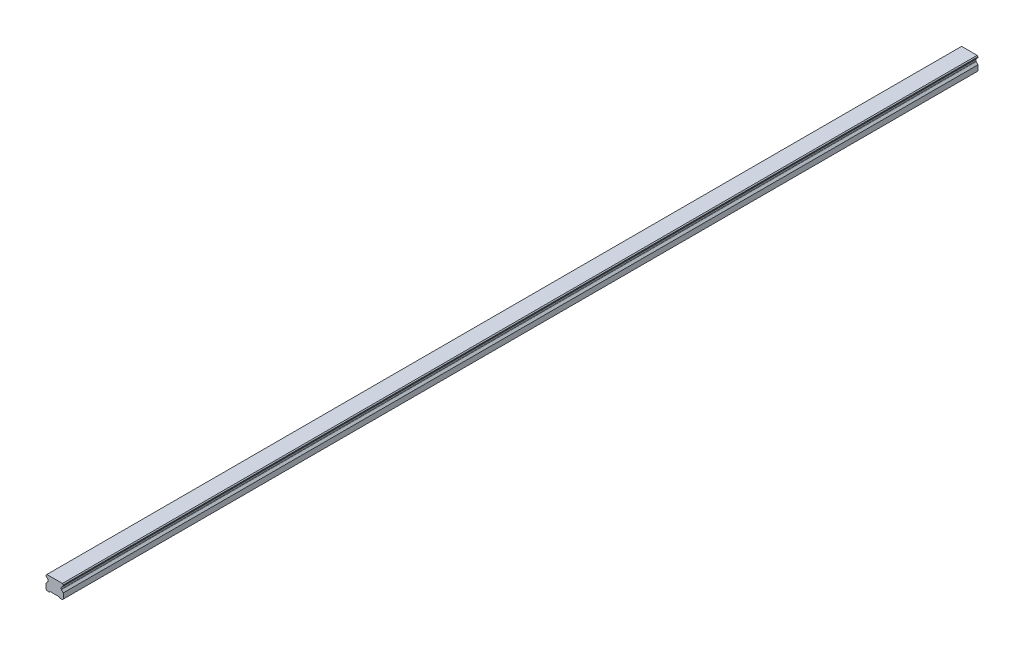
ISO-10303-21;
HEADER;
FILE_DESCRIPTION(('STEP AP214'),'2;1');
FILE_NAME('part.step','',(''),(''),'','','');
FILE_SCHEMA(('AUTOMOTIVE_DESIGN { 1 0 10303 214 1 1 1 1 }'));
ENDSEC;
DATA;
#1=APPLICATION_CONTEXT('core data for automotive mechanical design processes');
#2=APPLICATION_PROTOCOL_DEFINITION('international standard','automotive_design',2000,#1);
#3=PRODUCT_CONTEXT('',#1,'mechanical');
#4=PRODUCT('Part','Part','',(#3));
#5=PRODUCT_RELATED_PRODUCT_CATEGORY('part','',(#4));
#6=PRODUCT_DEFINITION_FORMATION('','',#4);
#7=PRODUCT_DEFINITION_CONTEXT('part definition',#1,'design');
#8=PRODUCT_DEFINITION('design','',#6,#7);
#9=PRODUCT_DEFINITION_SHAPE('','',#8);
#10=(LENGTH_UNIT() NAMED_UNIT(*) SI_UNIT(.MILLI.,.METRE.));
#11=(NAMED_UNIT(*) PLANE_ANGLE_UNIT() SI_UNIT($,.RADIAN.));
#12=(NAMED_UNIT(*) SI_UNIT($,.STERADIAN.) SOLID_ANGLE_UNIT());
#13=UNCERTAINTY_MEASURE_WITH_UNIT(LENGTH_MEASURE(1.E-05),#10,'distance_accuracy_value','');
#14=(GEOMETRIC_REPRESENTATION_CONTEXT(3) GLOBAL_UNCERTAINTY_ASSIGNED_CONTEXT((#13)) GLOBAL_UNIT_ASSIGNED_CONTEXT((#10,
#11,#12)) REPRESENTATION_CONTEXT('',''));
#15=CARTESIAN_POINT('',(0.,0.,0.));
#16=DIRECTION('',(0.,0.,1.));
#17=DIRECTION('',(1.,0.,0.));
#18=AXIS2_PLACEMENT_3D('',#15,#16,#17);
#19=CARTESIAN_POINT('',(0.,11.,-510.));
#20=DIRECTION('',(0.,-1.,0.));
#21=DIRECTION('',(0.,0.,-1.));
#22=AXIS2_PLACEMENT_3D('',#19,#20,#21);
#23=PLANE('',#22);
#24=CARTESIAN_POINT('',(0.,11.,-510.));
#25=DIRECTION('',(0.,-1.,0.));
#26=DIRECTION('',(0.,0.,-1.));
#27=AXIS2_PLACEMENT_3D('',#24,#25,#26);
#28=CIRCLE('',#27,2.5);
#29=CARTESIAN_POINT('',(0.,11.,-512.5));
#30=VERTEX_POINT('',#29);
#31=EDGE_CURVE('E42',#30,#30,#28,.T.);
#32=ORIENTED_EDGE('',*,*,#31,.F.);
#33=EDGE_LOOP('',(#32));
#34=FACE_BOUND('',#33,.T.);
#35=CARTESIAN_POINT('',(0.,11.,-510.));
#36=DIRECTION('',(0.,-1.,0.));
#37=DIRECTION('',(0.,0.,-1.));
#38=AXIS2_PLACEMENT_3D('',#35,#36,#37);
#39=CIRCLE('',#38,3.);
#40=CARTESIAN_POINT('',(0.,11.,-513.));
#41=VERTEX_POINT('',#40);
#42=EDGE_CURVE('E11',#41,#41,#39,.T.);
#43=ORIENTED_EDGE('',*,*,#42,.T.);
#44=EDGE_LOOP('',(#43));
#45=FACE_BOUND('',#44,.T.);
#46=ADVANCED_FACE('F39',(#34,#45),#23,.T.);
#47=CARTESIAN_POINT('',(0.,11.,-510.));
#48=DIRECTION('',(0.,-1.,0.));
#49=DIRECTION('',(0.,0.,-1.));
#50=AXIS2_PLACEMENT_3D('',#47,#48,#49);
#51=CYLINDRICAL_SURFACE('',#50,3.);
#52=ORIENTED_EDGE('',*,*,#42,.F.);
#53=EDGE_LOOP('',(#52));
#54=FACE_BOUND('',#53,.T.);
#55=CARTESIAN_POINT('',(0.,1.,-510.));
#56=DIRECTION('',(0.,-1.,0.));
#57=DIRECTION('',(0.,0.,-1.));
#58=AXIS2_PLACEMENT_3D('',#55,#56,#57);
#59=CIRCLE('',#58,3.);
#60=CARTESIAN_POINT('',(0.,1.,-513.));
#61=VERTEX_POINT('',#60);
#62=EDGE_CURVE('E48',#61,#61,#59,.T.);
#63=ORIENTED_EDGE('',*,*,#62,.T.);
#64=EDGE_LOOP('',(#63));
#65=FACE_BOUND('',#64,.T.);
#66=ADVANCED_FACE('F786',(#54,#65),#51,.F.);
#67=CARTESIAN_POINT('',(0.,11.,-450.));
#68=DIRECTION('',(0.,-1.,0.));
#69=DIRECTION('',(0.,0.,-1.));
#70=AXIS2_PLACEMENT_3D('',#67,#68,#69);
#71=PLANE('',#70);
#72=CARTESIAN_POINT('',(0.,11.,-450.));
#73=DIRECTION('',(0.,-1.,0.));
#74=DIRECTION('',(0.,0.,-1.));
#75=AXIS2_PLACEMENT_3D('',#72,#73,#74);
#76=CIRCLE('',#75,2.5);
#77=CARTESIAN_POINT('',(0.,11.,-452.5));
#78=VERTEX_POINT('',#77);
#79=EDGE_CURVE('E771',#78,#78,#76,.T.);
#80=ORIENTED_EDGE('',*,*,#79,.F.);
#81=EDGE_LOOP('',(#80));
#82=FACE_BOUND('',#81,.T.);
#83=CARTESIAN_POINT('',(0.,11.,-450.));
#84=DIRECTION('',(0.,-1.,0.));
#85=DIRECTION('',(0.,0.,-1.));
#86=AXIS2_PLACEMENT_3D('',#83,#84,#85);
#87=CIRCLE('',#86,3.);
#88=CARTESIAN_POINT('',(0.,11.,-453.));
#89=VERTEX_POINT('',#88);
#90=EDGE_CURVE('E710',#89,#89,#87,.T.);
#91=ORIENTED_EDGE('',*,*,#90,.T.);
#92=EDGE_LOOP('',(#91));
#93=FACE_BOUND('',#92,.T.);
#94=ADVANCED_FACE('F791',(#82,#93),#71,.T.);
#95=CARTESIAN_POINT('',(0.,11.,-450.));
#96=DIRECTION('',(0.,-1.,0.));
#97=DIRECTION('',(0.,0.,-1.));
#98=AXIS2_PLACEMENT_3D('',#95,#96,#97);
#99=CYLINDRICAL_SURFACE('',#98,3.);
#100=ORIENTED_EDGE('',*,*,#90,.F.);
#101=EDGE_LOOP('',(#100));
#102=FACE_BOUND('',#101,.T.);
#103=CARTESIAN_POINT('',(0.,1.,-450.));
#104=DIRECTION('',(0.,-1.,0.));
#105=DIRECTION('',(0.,0.,-1.));
#106=AXIS2_PLACEMENT_3D('',#103,#104,#105);
#107=CIRCLE('',#106,3.);
#108=CARTESIAN_POINT('',(0.,1.,-453.));
#109=VERTEX_POINT('',#108);
#110=EDGE_CURVE('E706',#109,#109,#107,.T.);
#111=ORIENTED_EDGE('',*,*,#110,.T.);
#112=EDGE_LOOP('',(#111));
#113=FACE_BOUND('',#112,.T.);
#114=ADVANCED_FACE('F1006',(#102,#113),#99,.F.);
#115=CARTESIAN_POINT('',(0.,11.,-390.));
#116=DIRECTION('',(0.,-1.,0.));
#117=DIRECTION('',(0.,0.,-1.));
#118=AXIS2_PLACEMENT_3D('',#115,#116,#117);
#119=PLANE('',#118);
#120=CARTESIAN_POINT('',(0.,11.,-390.));
#121=DIRECTION('',(0.,-1.,0.));
#122=DIRECTION('',(0.,0.,-1.));
#123=AXIS2_PLACEMENT_3D('',#120,#121,#122);
#124=CIRCLE('',#123,2.5);
#125=CARTESIAN_POINT('',(0.,11.,-392.5));
#126=VERTEX_POINT('',#125);
#127=EDGE_CURVE('E768',#126,#126,#124,.T.);
#128=ORIENTED_EDGE('',*,*,#127,.F.);
#129=EDGE_LOOP('',(#128));
#130=FACE_BOUND('',#129,.T.);
#131=CARTESIAN_POINT('',(0.,11.,-390.));
#132=DIRECTION('',(0.,-1.,0.));
#133=DIRECTION('',(0.,0.,-1.));
#134=AXIS2_PLACEMENT_3D('',#131,#132,#133);
#135=CIRCLE('',#134,3.);
#136=CARTESIAN_POINT('',(0.,11.,-393.));
#137=VERTEX_POINT('',#136);
#138=EDGE_CURVE('E702',#137,#137,#135,.T.);
#139=ORIENTED_EDGE('',*,*,#138,.T.);
#140=EDGE_LOOP('',(#139));
#141=FACE_BOUND('',#140,.T.);
#142=ADVANCED_FACE('F1002',(#130,#141),#119,.T.);
#143=CARTESIAN_POINT('',(0.,11.,-390.));
#144=DIRECTION('',(0.,-1.,0.));
#145=DIRECTION('',(0.,0.,-1.));
#146=AXIS2_PLACEMENT_3D('',#143,#144,#145);
#147=CYLINDRICAL_SURFACE('',#146,3.);
#148=ORIENTED_EDGE('',*,*,#138,.F.);
#149=EDGE_LOOP('',(#148));
#150=FACE_BOUND('',#149,.T.);
#151=CARTESIAN_POINT('',(0.,1.,-390.));
#152=DIRECTION('',(0.,-1.,0.));
#153=DIRECTION('',(0.,0.,-1.));
#154=AXIS2_PLACEMENT_3D('',#151,#152,#153);
#155=CIRCLE('',#154,3.);
#156=CARTESIAN_POINT('',(0.,1.,-393.));
#157=VERTEX_POINT('',#156);
#158=EDGE_CURVE('E698',#157,#157,#155,.T.);
#159=ORIENTED_EDGE('',*,*,#158,.T.);
#160=EDGE_LOOP('',(#159));
#161=FACE_BOUND('',#160,.T.);
#162=ADVANCED_FACE('F998',(#150,#161),#147,.F.);
#163=CARTESIAN_POINT('',(0.,11.,-330.));
#164=DIRECTION('',(0.,-1.,0.));
#165=DIRECTION('',(0.,0.,-1.));
#166=AXIS2_PLACEMENT_3D('',#163,#164,#165);
#167=PLANE('',#166);
#168=CARTESIAN_POINT('',(0.,11.,-330.));
#169=DIRECTION('',(0.,-1.,0.));
#170=DIRECTION('',(0.,0.,-1.));
#171=AXIS2_PLACEMENT_3D('',#168,#169,#170);
#172=CIRCLE('',#171,2.5);
#173=CARTESIAN_POINT('',(0.,11.,-332.5));
#174=VERTEX_POINT('',#173);
#175=EDGE_CURVE('E764',#174,#174,#172,.T.);
#176=ORIENTED_EDGE('',*,*,#175,.F.);
#177=EDGE_LOOP('',(#176));
#178=FACE_BOUND('',#177,.T.);
#179=CARTESIAN_POINT('',(0.,11.,-330.));
#180=DIRECTION('',(0.,-1.,0.));
#181=DIRECTION('',(0.,0.,-1.));
#182=AXIS2_PLACEMENT_3D('',#179,#180,#181);
#183=CIRCLE('',#182,3.);
#184=CARTESIAN_POINT('',(0.,11.,-333.));
#185=VERTEX_POINT('',#184);
#186=EDGE_CURVE('E694',#185,#185,#183,.T.);
#187=ORIENTED_EDGE('',*,*,#186,.T.);
#188=EDGE_LOOP('',(#187));
#189=FACE_BOUND('',#188,.T.);
#190=ADVANCED_FACE('F994',(#178,#189),#167,.T.);
#191=CARTESIAN_POINT('',(0.,11.,-330.));
#192=DIRECTION('',(0.,-1.,0.));
#193=DIRECTION('',(0.,0.,-1.));
#194=AXIS2_PLACEMENT_3D('',#191,#192,#193);
#195=CYLINDRICAL_SURFACE('',#194,3.);
#196=ORIENTED_EDGE('',*,*,#186,.F.);
#197=EDGE_LOOP('',(#196));
#198=FACE_BOUND('',#197,.T.);
#199=CARTESIAN_POINT('',(0.,1.,-330.));
#200=DIRECTION('',(0.,-1.,0.));
#201=DIRECTION('',(0.,0.,-1.));
#202=AXIS2_PLACEMENT_3D('',#199,#200,#201);
#203=CIRCLE('',#202,3.);
#204=CARTESIAN_POINT('',(0.,1.,-333.));
#205=VERTEX_POINT('',#204);
#206=EDGE_CURVE('E690',#205,#205,#203,.T.);
#207=ORIENTED_EDGE('',*,*,#206,.T.);
#208=EDGE_LOOP('',(#207));
#209=FACE_BOUND('',#208,.T.);
#210=ADVANCED_FACE('F990',(#198,#209),#195,.F.);
#211=CARTESIAN_POINT('',(0.,11.,-270.));
#212=DIRECTION('',(0.,-1.,0.));
#213=DIRECTION('',(0.,0.,-1.));
#214=AXIS2_PLACEMENT_3D('',#211,#212,#213);
#215=PLANE('',#214);
#216=CARTESIAN_POINT('',(0.,11.,-270.));
#217=DIRECTION('',(0.,-1.,0.));
#218=DIRECTION('',(0.,0.,-1.));
#219=AXIS2_PLACEMENT_3D('',#216,#217,#218);
#220=CIRCLE('',#219,2.5);
#221=CARTESIAN_POINT('',(0.,11.,-272.5));
#222=VERTEX_POINT('',#221);
#223=EDGE_CURVE('E760',#222,#222,#220,.T.);
#224=ORIENTED_EDGE('',*,*,#223,.F.);
#225=EDGE_LOOP('',(#224));
#226=FACE_BOUND('',#225,.T.);
#227=CARTESIAN_POINT('',(0.,11.,-270.));
#228=DIRECTION('',(0.,-1.,0.));
#229=DIRECTION('',(0.,0.,-1.));
#230=AXIS2_PLACEMENT_3D('',#227,#228,#229);
#231=CIRCLE('',#230,3.);
#232=CARTESIAN_POINT('',(0.,11.,-273.));
#233=VERTEX_POINT('',#232);
#234=EDGE_CURVE('E686',#233,#233,#231,.T.);
#235=ORIENTED_EDGE('',*,*,#234,.T.);
#236=EDGE_LOOP('',(#235));
#237=FACE_BOUND('',#236,.T.);
#238=ADVANCED_FACE('F986',(#226,#237),#215,.T.);
#239=CARTESIAN_POINT('',(0.,11.,-270.));
#240=DIRECTION('',(0.,-1.,0.));
#241=DIRECTION('',(0.,0.,-1.));
#242=AXIS2_PLACEMENT_3D('',#239,#240,#241);
#243=CYLINDRICAL_SURFACE('',#242,3.);
#244=ORIENTED_EDGE('',*,*,#234,.F.);
#245=EDGE_LOOP('',(#244));
#246=FACE_BOUND('',#245,.T.);
#247=CARTESIAN_POINT('',(0.,1.,-270.));
#248=DIRECTION('',(0.,-1.,0.));
#249=DIRECTION('',(0.,0.,-1.));
#250=AXIS2_PLACEMENT_3D('',#247,#248,#249);
#251=CIRCLE('',#250,3.);
#252=CARTESIAN_POINT('',(0.,1.,-273.));
#253=VERTEX_POINT('',#252);
#254=EDGE_CURVE('E682',#253,#253,#251,.T.);
#255=ORIENTED_EDGE('',*,*,#254,.T.);
#256=EDGE_LOOP('',(#255));
#257=FACE_BOUND('',#256,.T.);
#258=ADVANCED_FACE('F982',(#246,#257),#243,.F.);
#259=CARTESIAN_POINT('',(0.,11.,-210.));
#260=DIRECTION('',(0.,-1.,0.));
#261=DIRECTION('',(0.,0.,-1.));
#262=AXIS2_PLACEMENT_3D('',#259,#260,#261);
#263=PLANE('',#262);
#264=CARTESIAN_POINT('',(0.,11.,-210.));
#265=DIRECTION('',(0.,-1.,0.));
#266=DIRECTION('',(0.,0.,-1.));
#267=AXIS2_PLACEMENT_3D('',#264,#265,#266);
#268=CIRCLE('',#267,2.5);
#269=CARTESIAN_POINT('',(0.,11.,-212.5));
#270=VERTEX_POINT('',#269);
#271=EDGE_CURVE('E756',#270,#270,#268,.T.);
#272=ORIENTED_EDGE('',*,*,#271,.F.);
#273=EDGE_LOOP('',(#272));
#274=FACE_BOUND('',#273,.T.);
#275=CARTESIAN_POINT('',(0.,11.,-210.));
#276=DIRECTION('',(0.,-1.,0.));
#277=DIRECTION('',(0.,0.,-1.));
#278=AXIS2_PLACEMENT_3D('',#275,#276,#277);
#279=CIRCLE('',#278,3.);
#280=CARTESIAN_POINT('',(0.,11.,-213.));
#281=VERTEX_POINT('',#280);
#282=EDGE_CURVE('E678',#281,#281,#279,.T.);
#283=ORIENTED_EDGE('',*,*,#282,.T.);
#284=EDGE_LOOP('',(#283));
#285=FACE_BOUND('',#284,.T.);
#286=ADVANCED_FACE('F978',(#274,#285),#263,.T.);
#287=CARTESIAN_POINT('',(0.,11.,-210.));
#288=DIRECTION('',(0.,-1.,0.));
#289=DIRECTION('',(0.,0.,-1.));
#290=AXIS2_PLACEMENT_3D('',#287,#288,#289);
#291=CYLINDRICAL_SURFACE('',#290,3.);
#292=ORIENTED_EDGE('',*,*,#282,.F.);
#293=EDGE_LOOP('',(#292));
#294=FACE_BOUND('',#293,.T.);
#295=CARTESIAN_POINT('',(0.,1.,-210.));
#296=DIRECTION('',(0.,-1.,0.));
#297=DIRECTION('',(0.,0.,-1.));
#298=AXIS2_PLACEMENT_3D('',#295,#296,#297);
#299=CIRCLE('',#298,3.);
#300=CARTESIAN_POINT('',(0.,1.,-213.));
#301=VERTEX_POINT('',#300);
#302=EDGE_CURVE('E674',#301,#301,#299,.T.);
#303=ORIENTED_EDGE('',*,*,#302,.T.);
#304=EDGE_LOOP('',(#303));
#305=FACE_BOUND('',#304,.T.);
#306=ADVANCED_FACE('F974',(#294,#305),#291,.F.);
#307=CARTESIAN_POINT('',(0.,11.,-150.));
#308=DIRECTION('',(0.,-1.,0.));
#309=DIRECTION('',(0.,0.,-1.));
#310=AXIS2_PLACEMENT_3D('',#307,#308,#309);
#311=PLANE('',#310);
#312=CARTESIAN_POINT('',(0.,11.,-150.));
#313=DIRECTION('',(0.,-1.,0.));
#314=DIRECTION('',(0.,0.,-1.));
#315=AXIS2_PLACEMENT_3D('',#312,#313,#314);
#316=CIRCLE('',#315,2.5);
#317=CARTESIAN_POINT('',(0.,11.,-152.5));
#318=VERTEX_POINT('',#317);
#319=EDGE_CURVE('E752',#318,#318,#316,.T.);
#320=ORIENTED_EDGE('',*,*,#319,.F.);
#321=EDGE_LOOP('',(#320));
#322=FACE_BOUND('',#321,.T.);
#323=CARTESIAN_POINT('',(0.,11.,-150.));
#324=DIRECTION('',(0.,-1.,0.));
#325=DIRECTION('',(0.,0.,-1.));
#326=AXIS2_PLACEMENT_3D('',#323,#324,#325);
#327=CIRCLE('',#326,3.);
#328=CARTESIAN_POINT('',(0.,11.,-153.));
#329=VERTEX_POINT('',#328);
#330=EDGE_CURVE('E670',#329,#329,#327,.T.);
#331=ORIENTED_EDGE('',*,*,#330,.T.);
#332=EDGE_LOOP('',(#331));
#333=FACE_BOUND('',#332,.T.);
#334=ADVANCED_FACE('F970',(#322,#333),#311,.T.);
#335=CARTESIAN_POINT('',(0.,11.,-150.));
#336=DIRECTION('',(0.,-1.,0.));
#337=DIRECTION('',(0.,0.,-1.));
#338=AXIS2_PLACEMENT_3D('',#335,#336,#337);
#339=CYLINDRICAL_SURFACE('',#338,3.);
#340=ORIENTED_EDGE('',*,*,#330,.F.);
#341=EDGE_LOOP('',(#340));
#342=FACE_BOUND('',#341,.T.);
#343=CARTESIAN_POINT('',(0.,1.,-150.));
#344=DIRECTION('',(0.,-1.,0.));
#345=DIRECTION('',(0.,0.,-1.));
#346=AXIS2_PLACEMENT_3D('',#343,#344,#345);
#347=CIRCLE('',#346,3.);
#348=CARTESIAN_POINT('',(0.,1.,-153.));
#349=VERTEX_POINT('',#348);
#350=EDGE_CURVE('E666',#349,#349,#347,.T.);
#351=ORIENTED_EDGE('',*,*,#350,.T.);
#352=EDGE_LOOP('',(#351));
#353=FACE_BOUND('',#352,.T.);
#354=ADVANCED_FACE('F966',(#342,#353),#339,.F.);
#355=CARTESIAN_POINT('',(0.,11.,-90.));
#356=DIRECTION('',(0.,-1.,0.));
#357=DIRECTION('',(0.,0.,-1.));
#358=AXIS2_PLACEMENT_3D('',#355,#356,#357);
#359=PLANE('',#358);
#360=CARTESIAN_POINT('',(0.,11.,-90.));
#361=DIRECTION('',(0.,-1.,0.));
#362=DIRECTION('',(0.,0.,-1.));
#363=AXIS2_PLACEMENT_3D('',#360,#361,#362);
#364=CIRCLE('',#363,2.5);
#365=CARTESIAN_POINT('',(0.,11.,-92.5));
#366=VERTEX_POINT('',#365);
#367=EDGE_CURVE('E748',#366,#366,#364,.T.);
#368=ORIENTED_EDGE('',*,*,#367,.F.);
#369=EDGE_LOOP('',(#368));
#370=FACE_BOUND('',#369,.T.);
#371=CARTESIAN_POINT('',(0.,11.,-90.));
#372=DIRECTION('',(0.,-1.,0.));
#373=DIRECTION('',(0.,0.,-1.));
#374=AXIS2_PLACEMENT_3D('',#371,#372,#373);
#375=CIRCLE('',#374,3.);
#376=CARTESIAN_POINT('',(0.,11.,-93.));
#377=VERTEX_POINT('',#376);
#378=EDGE_CURVE('E662',#377,#377,#375,.T.);
#379=ORIENTED_EDGE('',*,*,#378,.T.);
#380=EDGE_LOOP('',(#379));
#381=FACE_BOUND('',#380,.T.);
#382=ADVANCED_FACE('F962',(#370,#381),#359,.T.);
#383=CARTESIAN_POINT('',(0.,11.,-90.));
#384=DIRECTION('',(0.,-1.,0.));
#385=DIRECTION('',(0.,0.,-1.));
#386=AXIS2_PLACEMENT_3D('',#383,#384,#385);
#387=CYLINDRICAL_SURFACE('',#386,3.);
#388=ORIENTED_EDGE('',*,*,#378,.F.);
#389=EDGE_LOOP('',(#388));
#390=FACE_BOUND('',#389,.T.);
#391=CARTESIAN_POINT('',(0.,1.,-90.));
#392=DIRECTION('',(0.,-1.,0.));
#393=DIRECTION('',(0.,0.,-1.));
#394=AXIS2_PLACEMENT_3D('',#391,#392,#393);
#395=CIRCLE('',#394,3.);
#396=CARTESIAN_POINT('',(0.,1.,-93.));
#397=VERTEX_POINT('',#396);
#398=EDGE_CURVE('E658',#397,#397,#395,.T.);
#399=ORIENTED_EDGE('',*,*,#398,.T.);
#400=EDGE_LOOP('',(#399));
#401=FACE_BOUND('',#400,.T.);
#402=ADVANCED_FACE('F958',(#390,#401),#387,.F.);
#403=CARTESIAN_POINT('',(0.,11.,-30.));
#404=DIRECTION('',(0.,-1.,0.));
#405=DIRECTION('',(0.,0.,-1.));
#406=AXIS2_PLACEMENT_3D('',#403,#404,#405);
#407=PLANE('',#406);
#408=CARTESIAN_POINT('',(0.,11.,-30.));
#409=DIRECTION('',(0.,-1.,0.));
#410=DIRECTION('',(0.,0.,-1.));
#411=AXIS2_PLACEMENT_3D('',#408,#409,#410);
#412=CIRCLE('',#411,2.5);
#413=CARTESIAN_POINT('',(0.,11.,-32.5));
#414=VERTEX_POINT('',#413);
#415=EDGE_CURVE('E744',#414,#414,#412,.T.);
#416=ORIENTED_EDGE('',*,*,#415,.F.);
#417=EDGE_LOOP('',(#416));
#418=FACE_BOUND('',#417,.T.);
#419=CARTESIAN_POINT('',(0.,11.,-30.));
#420=DIRECTION('',(0.,-1.,0.));
#421=DIRECTION('',(0.,0.,-1.));
#422=AXIS2_PLACEMENT_3D('',#419,#420,#421);
#423=CIRCLE('',#422,3.);
#424=CARTESIAN_POINT('',(0.,11.,-33.));
#425=VERTEX_POINT('',#424);
#426=EDGE_CURVE('E654',#425,#425,#423,.T.);
#427=ORIENTED_EDGE('',*,*,#426,.T.);
#428=EDGE_LOOP('',(#427));
#429=FACE_BOUND('',#428,.T.);
#430=ADVANCED_FACE('F954',(#418,#429),#407,.T.);
#431=CARTESIAN_POINT('',(0.,11.,-30.));
#432=DIRECTION('',(0.,-1.,0.));
#433=DIRECTION('',(0.,0.,-1.));
#434=AXIS2_PLACEMENT_3D('',#431,#432,#433);
#435=CYLINDRICAL_SURFACE('',#434,3.);
#436=ORIENTED_EDGE('',*,*,#426,.F.);
#437=EDGE_LOOP('',(#436));
#438=FACE_BOUND('',#437,.T.);
#439=CARTESIAN_POINT('',(0.,1.,-30.));
#440=DIRECTION('',(0.,-1.,0.));
#441=DIRECTION('',(0.,0.,-1.));
#442=AXIS2_PLACEMENT_3D('',#439,#440,#441);
#443=CIRCLE('',#442,3.);
#444=CARTESIAN_POINT('',(0.,1.,-33.));
#445=VERTEX_POINT('',#444);
#446=EDGE_CURVE('E650',#445,#445,#443,.T.);
#447=ORIENTED_EDGE('',*,*,#446,.T.);
#448=EDGE_LOOP('',(#447));
#449=FACE_BOUND('',#448,.T.);
#450=ADVANCED_FACE('F950',(#438,#449),#435,.F.);
#451=CARTESIAN_POINT('',(0.,11.,30.));
#452=DIRECTION('',(0.,-1.,0.));
#453=DIRECTION('',(0.,0.,-1.));
#454=AXIS2_PLACEMENT_3D('',#451,#452,#453);
#455=PLANE('',#454);
#456=CARTESIAN_POINT('',(0.,11.,30.));
#457=DIRECTION('',(0.,-1.,0.));
#458=DIRECTION('',(0.,0.,-1.));
#459=AXIS2_PLACEMENT_3D('',#456,#457,#458);
#460=CIRCLE('',#459,2.5);
#461=CARTESIAN_POINT('',(0.,11.,27.5));
#462=VERTEX_POINT('',#461);
#463=EDGE_CURVE('E740',#462,#462,#460,.T.);
#464=ORIENTED_EDGE('',*,*,#463,.F.);
#465=EDGE_LOOP('',(#464));
#466=FACE_BOUND('',#465,.T.);
#467=CARTESIAN_POINT('',(0.,11.,30.));
#468=DIRECTION('',(0.,-1.,0.));
#469=DIRECTION('',(0.,0.,-1.));
#470=AXIS2_PLACEMENT_3D('',#467,#468,#469);
#471=CIRCLE('',#470,3.);
#472=CARTESIAN_POINT('',(0.,11.,27.));
#473=VERTEX_POINT('',#472);
#474=EDGE_CURVE('E646',#473,#473,#471,.T.);
#475=ORIENTED_EDGE('',*,*,#474,.T.);
#476=EDGE_LOOP('',(#475));
#477=FACE_BOUND('',#476,.T.);
#478=ADVANCED_FACE('F946',(#466,#477),#455,.T.);
#479=CARTESIAN_POINT('',(0.,11.,30.));
#480=DIRECTION('',(0.,-1.,0.));
#481=DIRECTION('',(0.,0.,-1.));
#482=AXIS2_PLACEMENT_3D('',#479,#480,#481);
#483=CYLINDRICAL_SURFACE('',#482,3.);
#484=ORIENTED_EDGE('',*,*,#474,.F.);
#485=EDGE_LOOP('',(#484));
#486=FACE_BOUND('',#485,.T.);
#487=CARTESIAN_POINT('',(0.,1.,30.));
#488=DIRECTION('',(0.,-1.,0.));
#489=DIRECTION('',(0.,0.,-1.));
#490=AXIS2_PLACEMENT_3D('',#487,#488,#489);
#491=CIRCLE('',#490,3.);
#492=CARTESIAN_POINT('',(0.,1.,27.));
#493=VERTEX_POINT('',#492);
#494=EDGE_CURVE('E642',#493,#493,#491,.T.);
#495=ORIENTED_EDGE('',*,*,#494,.T.);
#496=EDGE_LOOP('',(#495));
#497=FACE_BOUND('',#496,.T.);
#498=ADVANCED_FACE('F942',(#486,#497),#483,.F.);
#499=CARTESIAN_POINT('',(0.,11.,90.));
#500=DIRECTION('',(0.,-1.,0.));
#501=DIRECTION('',(0.,0.,-1.));
#502=AXIS2_PLACEMENT_3D('',#499,#500,#501);
#503=PLANE('',#502);
#504=CARTESIAN_POINT('',(0.,11.,90.));
#505=DIRECTION('',(0.,-1.,0.));
#506=DIRECTION('',(0.,0.,-1.));
#507=AXIS2_PLACEMENT_3D('',#504,#505,#506);
#508=CIRCLE('',#507,2.5);
#509=CARTESIAN_POINT('',(0.,11.,87.5));
#510=VERTEX_POINT('',#509);
#511=EDGE_CURVE('E736',#510,#510,#508,.T.);
#512=ORIENTED_EDGE('',*,*,#511,.F.);
#513=EDGE_LOOP('',(#512));
#514=FACE_BOUND('',#513,.T.);
#515=CARTESIAN_POINT('',(0.,11.,90.));
#516=DIRECTION('',(0.,-1.,0.));
#517=DIRECTION('',(0.,0.,-1.));
#518=AXIS2_PLACEMENT_3D('',#515,#516,#517);
#519=CIRCLE('',#518,3.);
#520=CARTESIAN_POINT('',(0.,11.,87.));
#521=VERTEX_POINT('',#520);
#522=EDGE_CURVE('E638',#521,#521,#519,.T.);
#523=ORIENTED_EDGE('',*,*,#522,.T.);
#524=EDGE_LOOP('',(#523));
#525=FACE_BOUND('',#524,.T.);
#526=ADVANCED_FACE('F938',(#514,#525),#503,.T.);
#527=CARTESIAN_POINT('',(0.,11.,90.));
#528=DIRECTION('',(0.,-1.,0.));
#529=DIRECTION('',(0.,0.,-1.));
#530=AXIS2_PLACEMENT_3D('',#527,#528,#529);
#531=CYLINDRICAL_SURFACE('',#530,3.);
#532=ORIENTED_EDGE('',*,*,#522,.F.);
#533=EDGE_LOOP('',(#532));
#534=FACE_BOUND('',#533,.T.);
#535=CARTESIAN_POINT('',(0.,1.,90.));
#536=DIRECTION('',(0.,-1.,0.));
#537=DIRECTION('',(0.,0.,-1.));
#538=AXIS2_PLACEMENT_3D('',#535,#536,#537);
#539=CIRCLE('',#538,3.);
#540=CARTESIAN_POINT('',(0.,1.,87.));
#541=VERTEX_POINT('',#540);
#542=EDGE_CURVE('E634',#541,#541,#539,.T.);
#543=ORIENTED_EDGE('',*,*,#542,.T.);
#544=EDGE_LOOP('',(#543));
#545=FACE_BOUND('',#544,.T.);
#546=ADVANCED_FACE('F934',(#534,#545),#531,.F.);
#547=CARTESIAN_POINT('',(0.,11.,150.));
#548=DIRECTION('',(0.,-1.,0.));
#549=DIRECTION('',(0.,0.,-1.));
#550=AXIS2_PLACEMENT_3D('',#547,#548,#549);
#551=PLANE('',#550);
#552=CARTESIAN_POINT('',(0.,11.,150.));
#553=DIRECTION('',(0.,-1.,0.));
#554=DIRECTION('',(0.,0.,-1.));
#555=AXIS2_PLACEMENT_3D('',#552,#553,#554);
#556=CIRCLE('',#555,2.5);
#557=CARTESIAN_POINT('',(0.,11.,147.5));
#558=VERTEX_POINT('',#557);
#559=EDGE_CURVE('E732',#558,#558,#556,.T.);
#560=ORIENTED_EDGE('',*,*,#559,.F.);
#561=EDGE_LOOP('',(#560));
#562=FACE_BOUND('',#561,.T.);
#563=CARTESIAN_POINT('',(0.,11.,150.));
#564=DIRECTION('',(0.,-1.,0.));
#565=DIRECTION('',(0.,0.,-1.));
#566=AXIS2_PLACEMENT_3D('',#563,#564,#565);
#567=CIRCLE('',#566,3.);
#568=CARTESIAN_POINT('',(0.,11.,147.));
#569=VERTEX_POINT('',#568);
#570=EDGE_CURVE('E630',#569,#569,#567,.T.);
#571=ORIENTED_EDGE('',*,*,#570,.T.);
#572=EDGE_LOOP('',(#571));
#573=FACE_BOUND('',#572,.T.);
#574=ADVANCED_FACE('F930',(#562,#573),#551,.T.);
#575=CARTESIAN_POINT('',(0.,11.,150.));
#576=DIRECTION('',(0.,-1.,0.));
#577=DIRECTION('',(0.,0.,-1.));
#578=AXIS2_PLACEMENT_3D('',#575,#576,#577);
#579=CYLINDRICAL_SURFACE('',#578,3.);
#580=ORIENTED_EDGE('',*,*,#570,.F.);
#581=EDGE_LOOP('',(#580));
#582=FACE_BOUND('',#581,.T.);
#583=CARTESIAN_POINT('',(0.,1.,150.));
#584=DIRECTION('',(0.,-1.,0.));
#585=DIRECTION('',(0.,0.,-1.));
#586=AXIS2_PLACEMENT_3D('',#583,#584,#585);
#587=CIRCLE('',#586,3.);
#588=CARTESIAN_POINT('',(0.,1.,147.));
#589=VERTEX_POINT('',#588);
#590=EDGE_CURVE('E626',#589,#589,#587,.T.);
#591=ORIENTED_EDGE('',*,*,#590,.T.);
#592=EDGE_LOOP('',(#591));
#593=FACE_BOUND('',#592,.T.);
#594=ADVANCED_FACE('F926',(#582,#593),#579,.F.);
#595=CARTESIAN_POINT('',(0.,11.,210.));
#596=DIRECTION('',(0.,-1.,0.));
#597=DIRECTION('',(0.,0.,-1.));
#598=AXIS2_PLACEMENT_3D('',#595,#596,#597);
#599=PLANE('',#598);
#600=CARTESIAN_POINT('',(0.,11.,210.));
#601=DIRECTION('',(0.,-1.,0.));
#602=DIRECTION('',(0.,0.,-1.));
#603=AXIS2_PLACEMENT_3D('',#600,#601,#602);
#604=CIRCLE('',#603,2.5);
#605=CARTESIAN_POINT('',(0.,11.,207.5));
#606=VERTEX_POINT('',#605);
#607=EDGE_CURVE('E728',#606,#606,#604,.T.);
#608=ORIENTED_EDGE('',*,*,#607,.F.);
#609=EDGE_LOOP('',(#608));
#610=FACE_BOUND('',#609,.T.);
#611=CARTESIAN_POINT('',(0.,11.,210.));
#612=DIRECTION('',(0.,-1.,0.));
#613=DIRECTION('',(0.,0.,-1.));
#614=AXIS2_PLACEMENT_3D('',#611,#612,#613);
#615=CIRCLE('',#614,3.);
#616=CARTESIAN_POINT('',(0.,11.,207.));
#617=VERTEX_POINT('',#616);
#618=EDGE_CURVE('E622',#617,#617,#615,.T.);
#619=ORIENTED_EDGE('',*,*,#618,.T.);
#620=EDGE_LOOP('',(#619));
#621=FACE_BOUND('',#620,.T.);
#622=ADVANCED_FACE('F922',(#610,#621),#599,.T.);
#623=CARTESIAN_POINT('',(0.,11.,210.));
#624=DIRECTION('',(0.,-1.,0.));
#625=DIRECTION('',(0.,0.,-1.));
#626=AXIS2_PLACEMENT_3D('',#623,#624,#625);
#627=CYLINDRICAL_SURFACE('',#626,3.);
#628=ORIENTED_EDGE('',*,*,#618,.F.);
#629=EDGE_LOOP('',(#628));
#630=FACE_BOUND('',#629,.T.);
#631=CARTESIAN_POINT('',(0.,1.,210.));
#632=DIRECTION('',(0.,-1.,0.));
#633=DIRECTION('',(0.,0.,-1.));
#634=AXIS2_PLACEMENT_3D('',#631,#632,#633);
#635=CIRCLE('',#634,3.);
#636=CARTESIAN_POINT('',(0.,1.,207.));
#637=VERTEX_POINT('',#636);
#638=EDGE_CURVE('E618',#637,#637,#635,.T.);
#639=ORIENTED_EDGE('',*,*,#638,.T.);
#640=EDGE_LOOP('',(#639));
#641=FACE_BOUND('',#640,.T.);
#642=ADVANCED_FACE('F918',(#630,#641),#627,.F.);
#643=CARTESIAN_POINT('',(0.,11.,270.));
#644=DIRECTION('',(0.,-1.,0.));
#645=DIRECTION('',(0.,0.,-1.));
#646=AXIS2_PLACEMENT_3D('',#643,#644,#645);
#647=PLANE('',#646);
#648=CARTESIAN_POINT('',(0.,11.,270.));
#649=DIRECTION('',(0.,-1.,0.));
#650=DIRECTION('',(0.,0.,-1.));
#651=AXIS2_PLACEMENT_3D('',#648,#649,#650);
#652=CIRCLE('',#651,2.5);
#653=CARTESIAN_POINT('',(0.,11.,267.5));
#654=VERTEX_POINT('',#653);
#655=EDGE_CURVE('E724',#654,#654,#652,.T.);
#656=ORIENTED_EDGE('',*,*,#655,.F.);
#657=EDGE_LOOP('',(#656));
#658=FACE_BOUND('',#657,.T.);
#659=CARTESIAN_POINT('',(0.,11.,270.));
#660=DIRECTION('',(0.,-1.,0.));
#661=DIRECTION('',(0.,0.,-1.));
#662=AXIS2_PLACEMENT_3D('',#659,#660,#661);
#663=CIRCLE('',#662,3.);
#664=CARTESIAN_POINT('',(0.,11.,267.));
#665=VERTEX_POINT('',#664);
#666=EDGE_CURVE('E614',#665,#665,#663,.T.);
#667=ORIENTED_EDGE('',*,*,#666,.T.);
#668=EDGE_LOOP('',(#667));
#669=FACE_BOUND('',#668,.T.);
#670=ADVANCED_FACE('F914',(#658,#669),#647,.T.);
#671=CARTESIAN_POINT('',(0.,11.,270.));
#672=DIRECTION('',(0.,-1.,0.));
#673=DIRECTION('',(0.,0.,-1.));
#674=AXIS2_PLACEMENT_3D('',#671,#672,#673);
#675=CYLINDRICAL_SURFACE('',#674,3.);
#676=ORIENTED_EDGE('',*,*,#666,.F.);
#677=EDGE_LOOP('',(#676));
#678=FACE_BOUND('',#677,.T.);
#679=CARTESIAN_POINT('',(0.,1.,270.));
#680=DIRECTION('',(0.,-1.,0.));
#681=DIRECTION('',(0.,0.,-1.));
#682=AXIS2_PLACEMENT_3D('',#679,#680,#681);
#683=CIRCLE('',#682,3.);
#684=CARTESIAN_POINT('',(0.,1.,267.));
#685=VERTEX_POINT('',#684);
#686=EDGE_CURVE('E610',#685,#685,#683,.T.);
#687=ORIENTED_EDGE('',*,*,#686,.T.);
#688=EDGE_LOOP('',(#687));
#689=FACE_BOUND('',#688,.T.);
#690=ADVANCED_FACE('F910',(#678,#689),#675,.F.);
#691=CARTESIAN_POINT('',(0.,11.,330.));
#692=DIRECTION('',(0.,-1.,0.));
#693=DIRECTION('',(0.,0.,-1.));
#694=AXIS2_PLACEMENT_3D('',#691,#692,#693);
#695=PLANE('',#694);
#696=CARTESIAN_POINT('',(0.,11.,330.));
#697=DIRECTION('',(0.,-1.,0.));
#698=DIRECTION('',(0.,0.,-1.));
#699=AXIS2_PLACEMENT_3D('',#696,#697,#698);
#700=CIRCLE('',#699,2.5);
#701=CARTESIAN_POINT('',(0.,11.,327.5));
#702=VERTEX_POINT('',#701);
#703=EDGE_CURVE('E720',#702,#702,#700,.T.);
#704=ORIENTED_EDGE('',*,*,#703,.F.);
#705=EDGE_LOOP('',(#704));
#706=FACE_BOUND('',#705,.T.);
#707=CARTESIAN_POINT('',(0.,11.,330.));
#708=DIRECTION('',(0.,-1.,0.));
#709=DIRECTION('',(0.,0.,-1.));
#710=AXIS2_PLACEMENT_3D('',#707,#708,#709);
#711=CIRCLE('',#710,3.);
#712=CARTESIAN_POINT('',(0.,11.,327.));
#713=VERTEX_POINT('',#712);
#714=EDGE_CURVE('E606',#713,#713,#711,.T.);
#715=ORIENTED_EDGE('',*,*,#714,.T.);
#716=EDGE_LOOP('',(#715));
#717=FACE_BOUND('',#716,.T.);
#718=ADVANCED_FACE('F906',(#706,#717),#695,.T.);
#719=CARTESIAN_POINT('',(0.,11.,330.));
#720=DIRECTION('',(0.,-1.,0.));
#721=DIRECTION('',(0.,0.,-1.));
#722=AXIS2_PLACEMENT_3D('',#719,#720,#721);
#723=CYLINDRICAL_SURFACE('',#722,3.);
#724=ORIENTED_EDGE('',*,*,#714,.F.);
#725=EDGE_LOOP('',(#724));
#726=FACE_BOUND('',#725,.T.);
#727=CARTESIAN_POINT('',(0.,1.,330.));
#728=DIRECTION('',(0.,-1.,0.));
#729=DIRECTION('',(0.,0.,-1.));
#730=AXIS2_PLACEMENT_3D('',#727,#728,#729);
#731=CIRCLE('',#730,3.);
#732=CARTESIAN_POINT('',(0.,1.,327.));
#733=VERTEX_POINT('',#732);
#734=EDGE_CURVE('E602',#733,#733,#731,.T.);
#735=ORIENTED_EDGE('',*,*,#734,.T.);
#736=EDGE_LOOP('',(#735));
#737=FACE_BOUND('',#736,.T.);
#738=ADVANCED_FACE('F902',(#726,#737),#723,.F.);
#739=CARTESIAN_POINT('',(0.,11.,390.));
#740=DIRECTION('',(0.,-1.,0.));
#741=DIRECTION('',(0.,0.,-1.));
#742=AXIS2_PLACEMENT_3D('',#739,#740,#741);
#743=PLANE('',#742);
#744=CARTESIAN_POINT('',(0.,11.,390.));
#745=DIRECTION('',(0.,-1.,0.));
#746=DIRECTION('',(0.,0.,-1.));
#747=AXIS2_PLACEMENT_3D('',#744,#745,#746);
#748=CIRCLE('',#747,2.5);
#749=CARTESIAN_POINT('',(0.,11.,387.5));
#750=VERTEX_POINT('',#749);
#751=EDGE_CURVE('E272',#750,#750,#748,.T.);
#752=ORIENTED_EDGE('',*,*,#751,.F.);
#753=EDGE_LOOP('',(#752));
#754=FACE_BOUND('',#753,.T.);
#755=CARTESIAN_POINT('',(0.,11.,390.));
#756=DIRECTION('',(0.,-1.,0.));
#757=DIRECTION('',(0.,0.,-1.));
#758=AXIS2_PLACEMENT_3D('',#755,#756,#757);
#759=CIRCLE('',#758,3.);
#760=CARTESIAN_POINT('',(0.,11.,387.));
#761=VERTEX_POINT('',#760);
#762=EDGE_CURVE('E598',#761,#761,#759,.T.);
#763=ORIENTED_EDGE('',*,*,#762,.T.);
#764=EDGE_LOOP('',(#763));
#765=FACE_BOUND('',#764,.T.);
#766=ADVANCED_FACE('F898',(#754,#765),#743,.T.);
#767=CARTESIAN_POINT('',(0.,11.,390.));
#768=DIRECTION('',(0.,-1.,0.));
#769=DIRECTION('',(0.,0.,-1.));
#770=AXIS2_PLACEMENT_3D('',#767,#768,#769);
#771=CYLINDRICAL_SURFACE('',#770,3.);
#772=ORIENTED_EDGE('',*,*,#762,.F.);
#773=EDGE_LOOP('',(#772));
#774=FACE_BOUND('',#773,.T.);
#775=CARTESIAN_POINT('',(0.,1.,390.));
#776=DIRECTION('',(0.,-1.,0.));
#777=DIRECTION('',(0.,0.,-1.));
#778=AXIS2_PLACEMENT_3D('',#775,#776,#777);
#779=CIRCLE('',#778,3.);
#780=CARTESIAN_POINT('',(0.,1.,387.));
#781=VERTEX_POINT('',#780);
#782=EDGE_CURVE('E594',#781,#781,#779,.T.);
#783=ORIENTED_EDGE('',*,*,#782,.T.);
#784=EDGE_LOOP('',(#783));
#785=FACE_BOUND('',#784,.T.);
#786=ADVANCED_FACE('F895',(#774,#785),#771,.F.);
#787=CARTESIAN_POINT('',(10.,0.,530.));
#788=DIRECTION('',(0.,1.,0.));
#789=DIRECTION('',(-1.,0.,0.));
#790=AXIS2_PLACEMENT_3D('',#787,#788,#789);
#791=PLANE('',#790);
#792=DIRECTION('',(1.,0.,0.));
#793=VECTOR('',#792,1.);
#794=CARTESIAN_POINT('',(10.,0.,-530.));
#795=LINE('',#794,#793);
#796=CARTESIAN_POINT('',(-9.00000000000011,0.,-530.));
#797=VERTEX_POINT('',#796);
#798=CARTESIAN_POINT('',(-6.,0.,-530.));
#799=VERTEX_POINT('',#798);
#800=EDGE_CURVE('E478',#797,#799,#795,.T.);
#801=ORIENTED_EDGE('',*,*,#800,.T.);
#802=DIRECTION('',(0.,0.,1.));
#803=VECTOR('',#802,1.);
#804=CARTESIAN_POINT('',(-6.,0.,-530.));
#805=LINE('',#804,#803);
#806=CARTESIAN_POINT('',(-6.,0.,530.));
#807=VERTEX_POINT('',#806);
#808=EDGE_CURVE('E383',#799,#807,#805,.T.);
#809=ORIENTED_EDGE('',*,*,#808,.T.);
#810=DIRECTION('',(1.,0.,0.));
#811=VECTOR('',#810,1.);
#812=CARTESIAN_POINT('',(10.,0.,530.));
#813=LINE('',#812,#811);
#814=CARTESIAN_POINT('',(-9.00000000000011,0.,530.));
#815=VERTEX_POINT('',#814);
#816=EDGE_CURVE('E459',#815,#807,#813,.T.);
#817=ORIENTED_EDGE('',*,*,#816,.F.);
#818=DIRECTION('',(0.,0.,-1.));
#819=VECTOR('',#818,1.);
#820=CARTESIAN_POINT('',(-9.00000000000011,0.,530.));
#821=LINE('',#820,#819);
#822=EDGE_CURVE('E529',#815,#797,#821,.T.);
#823=ORIENTED_EDGE('',*,*,#822,.T.);
#824=EDGE_LOOP('',(#801,#809,#817,#823));
#825=FACE_BOUND('',#824,.T.);
#826=ADVANCED_FACE('F860',(#825),#791,.F.);
#827=CARTESIAN_POINT('',(-10.,16.3,530.));
#828=DIRECTION('',(1.,0.,0.));
#829=DIRECTION('',(0.,1.,0.));
#830=AXIS2_PLACEMENT_3D('',#827,#828,#829);
#831=PLANE('',#830);
#832=DIRECTION('',(0.,-1.,0.));
#833=VECTOR('',#832,1.);
#834=CARTESIAN_POINT('',(-10.,16.3,530.));
#835=LINE('',#834,#833);
#836=CARTESIAN_POINT('',(-10.,15.3,530.));
#837=VERTEX_POINT('',#836);
#838=CARTESIAN_POINT('',(-10.,14.3,530.));
#839=VERTEX_POINT('',#838);
#840=EDGE_CURVE('E453',#837,#839,#835,.T.);
#841=ORIENTED_EDGE('',*,*,#840,.F.);
#842=DIRECTION('',(0.,0.,-1.));
#843=VECTOR('',#842,1.);
#844=CARTESIAN_POINT('',(-10.,15.3,530.));
#845=LINE('',#844,#843);
#846=CARTESIAN_POINT('',(-10.,15.3,-530.));
#847=VERTEX_POINT('',#846);
#848=EDGE_CURVE('E472',#837,#847,#845,.T.);
#849=ORIENTED_EDGE('',*,*,#848,.T.);
#850=DIRECTION('',(0.,-1.,0.));
#851=VECTOR('',#850,1.);
#852=CARTESIAN_POINT('',(-10.,16.3,-530.));
#853=LINE('',#852,#851);
#854=CARTESIAN_POINT('',(-10.,14.3,-530.));
#855=VERTEX_POINT('',#854);
#856=EDGE_CURVE('E473',#847,#855,#853,.T.);
#857=ORIENTED_EDGE('',*,*,#856,.T.);
#858=DIRECTION('',(0.,0.,1.));
#859=VECTOR('',#858,1.);
#860=CARTESIAN_POINT('',(-10.,14.3,-530.));
#861=LINE('',#860,#859);
#862=EDGE_CURVE('E407',#855,#839,#861,.T.);
#863=ORIENTED_EDGE('',*,*,#862,.T.);
#864=EDGE_LOOP('',(#841,#849,#857,#863));
#865=FACE_BOUND('',#864,.T.);
#866=ADVANCED_FACE('F864',(#865),#831,.F.);
#867=CARTESIAN_POINT('',(10.,16.3,530.));
#868=DIRECTION('',(-1.,0.,0.));
#869=DIRECTION('',(0.,-1.,0.));
#870=AXIS2_PLACEMENT_3D('',#867,#868,#869);
#871=PLANE('',#870);
#872=DIRECTION('',(0.,1.,0.));
#873=VECTOR('',#872,1.);
#874=CARTESIAN_POINT('',(10.,16.3,530.));
#875=LINE('',#874,#873);
#876=CARTESIAN_POINT('',(10.,1.,530.));
#877=VERTEX_POINT('',#876);
#878=CARTESIAN_POINT('',(10.,7.3,530.));
#879=VERTEX_POINT('',#878);
#880=EDGE_CURVE('E464',#877,#879,#875,.T.);
#881=ORIENTED_EDGE('',*,*,#880,.F.);
#882=DIRECTION('',(0.,0.,-1.));
#883=VECTOR('',#882,1.);
#884=CARTESIAN_POINT('',(10.,1.,530.));
#885=LINE('',#884,#883);
#886=CARTESIAN_POINT('',(10.,1.,-530.));
#887=VERTEX_POINT('',#886);
#888=EDGE_CURVE('E536',#877,#887,#885,.T.);
#889=ORIENTED_EDGE('',*,*,#888,.T.);
#890=DIRECTION('',(0.,1.,0.));
#891=VECTOR('',#890,1.);
#892=CARTESIAN_POINT('',(10.,16.3,-530.));
#893=LINE('',#892,#891);
#894=CARTESIAN_POINT('',(10.,7.3,-530.));
#895=VERTEX_POINT('',#894);
#896=EDGE_CURVE('E483',#887,#895,#893,.T.);
#897=ORIENTED_EDGE('',*,*,#896,.T.);
#898=DIRECTION('',(0.,0.,1.));
#899=VECTOR('',#898,1.);
#900=CARTESIAN_POINT('',(10.,7.3,-530.));
#901=LINE('',#900,#899);
#902=EDGE_CURVE('E438',#895,#879,#901,.T.);
#903=ORIENTED_EDGE('',*,*,#902,.T.);
#904=EDGE_LOOP('',(#881,#889,#897,#903));
#905=FACE_BOUND('',#904,.T.);
#906=ADVANCED_FACE('F855',(#905),#871,.F.);
#907=CARTESIAN_POINT('',(-10.,7.3,-530.));
#908=VERTEX_POINT('',#907);
#909=CARTESIAN_POINT('',(-10.,0.999999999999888,-530.));
#910=VERTEX_POINT('',#909);
#911=EDGE_CURVE('E422',#908,#910,#853,.T.);
#912=ORIENTED_EDGE('',*,*,#911,.T.);
#913=DIRECTION('',(0.,0.,1.));
#914=VECTOR('',#913,1.);
#915=CARTESIAN_POINT('',(-10.,0.999999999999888,530.));
#916=LINE('',#915,#914);
#917=CARTESIAN_POINT('',(-10.,0.999999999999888,530.));
#918=VERTEX_POINT('',#917);
#919=EDGE_CURVE('E533',#910,#918,#916,.T.);
#920=ORIENTED_EDGE('',*,*,#919,.T.);
#921=CARTESIAN_POINT('',(-10.,7.3,530.));
#922=VERTEX_POINT('',#921);
#923=EDGE_CURVE('E458',#922,#918,#835,.T.);
#924=ORIENTED_EDGE('',*,*,#923,.F.);
#925=DIRECTION('',(0.,0.,1.));
#926=VECTOR('',#925,1.);
#927=CARTESIAN_POINT('',(-10.,7.3,-530.));
#928=LINE('',#927,#926);
#929=EDGE_CURVE('E419',#908,#922,#928,.T.);
#930=ORIENTED_EDGE('',*,*,#929,.F.);
#931=EDGE_LOOP('',(#912,#920,#924,#930));
#932=FACE_BOUND('',#931,.T.);
#933=ADVANCED_FACE('F858',(#932),#831,.F.);
#934=CARTESIAN_POINT('',(6.,0.,530.));
#935=VERTEX_POINT('',#934);
#936=CARTESIAN_POINT('',(8.99999999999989,0.,530.));
#937=VERTEX_POINT('',#936);
#938=EDGE_CURVE('E457',#935,#937,#813,.T.);
#939=ORIENTED_EDGE('',*,*,#938,.F.);
#940=DIRECTION('',(0.,0.,1.));
#941=VECTOR('',#940,1.);
#942=CARTESIAN_POINT('',(6.,0.,-530.));
#943=LINE('',#942,#941);
#944=CARTESIAN_POINT('',(6.,0.,-530.));
#945=VERTEX_POINT('',#944);
#946=EDGE_CURVE('E373',#945,#935,#943,.T.);
#947=ORIENTED_EDGE('',*,*,#946,.F.);
#948=CARTESIAN_POINT('',(8.99999999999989,0.,-530.));
#949=VERTEX_POINT('',#948);
#950=EDGE_CURVE('E477',#945,#949,#795,.T.);
#951=ORIENTED_EDGE('',*,*,#950,.T.);
#952=DIRECTION('',(0.,0.,1.));
#953=VECTOR('',#952,1.);
#954=CARTESIAN_POINT('',(8.99999999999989,0.,530.));
#955=LINE('',#954,#953);
#956=EDGE_CURVE('E525',#949,#937,#955,.T.);
#957=ORIENTED_EDGE('',*,*,#956,.T.);
#958=EDGE_LOOP('',(#939,#947,#951,#957));
#959=FACE_BOUND('',#958,.T.);
#960=ADVANCED_FACE('F853',(#959),#791,.F.);
#961=CARTESIAN_POINT('',(10.,14.3,-530.));
#962=VERTEX_POINT('',#961);
#963=CARTESIAN_POINT('',(10.,15.2999999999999,-530.));
#964=VERTEX_POINT('',#963);
#965=EDGE_CURVE('E482',#962,#964,#893,.T.);
#966=ORIENTED_EDGE('',*,*,#965,.T.);
#967=DIRECTION('',(0.,0.,1.));
#968=VECTOR('',#967,1.);
#969=CARTESIAN_POINT('',(10.,15.2999999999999,530.));
#970=LINE('',#969,#968);
#971=CARTESIAN_POINT('',(10.,15.2999999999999,530.));
#972=VERTEX_POINT('',#971);
#973=EDGE_CURVE('E540',#964,#972,#970,.T.);
#974=ORIENTED_EDGE('',*,*,#973,.T.);
#975=CARTESIAN_POINT('',(10.,14.3,530.));
#976=VERTEX_POINT('',#975);
#977=EDGE_CURVE('E463',#976,#972,#875,.T.);
#978=ORIENTED_EDGE('',*,*,#977,.F.);
#979=DIRECTION('',(0.,0.,1.));
#980=VECTOR('',#979,1.);
#981=CARTESIAN_POINT('',(10.,14.3,-530.));
#982=LINE('',#981,#980);
#983=EDGE_CURVE('E412',#962,#976,#982,.T.);
#984=ORIENTED_EDGE('',*,*,#983,.F.);
#985=EDGE_LOOP('',(#966,#974,#978,#984));
#986=FACE_BOUND('',#985,.T.);
#987=ADVANCED_FACE('F849',(#986),#871,.F.);
#988=CARTESIAN_POINT('',(10.,16.3,530.));
#989=DIRECTION('',(0.,-1.,0.));
#990=DIRECTION('',(0.,0.,-1.));
#991=AXIS2_PLACEMENT_3D('',#988,#989,#990);
#992=PLANE('',#991);
#993=DIRECTION('',(-1.,0.,0.));
#994=VECTOR('',#993,1.);
#995=CARTESIAN_POINT('',(10.,16.3,-530.));
#996=LINE('',#995,#994);
#997=CARTESIAN_POINT('',(9.00000000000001,16.3,-530.));
#998=VERTEX_POINT('',#997);
#999=CARTESIAN_POINT('',(-8.99999999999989,16.3,-530.));
#1000=VERTEX_POINT('',#999);
#1001=EDGE_CURVE('E487',#998,#1000,#996,.T.);
#1002=ORIENTED_EDGE('',*,*,#1001,.T.);
#1003=DIRECTION('',(0.,0.,1.));
#1004=VECTOR('',#1003,1.);
#1005=CARTESIAN_POINT('',(-8.99999999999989,16.3,530.));
#1006=LINE('',#1005,#1004);
#1007=CARTESIAN_POINT('',(-8.99999999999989,16.3,530.));
#1008=VERTEX_POINT('',#1007);
#1009=EDGE_CURVE('E510',#1000,#1008,#1006,.T.);
#1010=ORIENTED_EDGE('',*,*,#1009,.T.);
#1011=DIRECTION('',(-1.,0.,0.));
#1012=VECTOR('',#1011,1.);
#1013=CARTESIAN_POINT('',(10.,16.3,530.));
#1014=LINE('',#1013,#1012);
#1015=CARTESIAN_POINT('',(9.00000000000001,16.3,530.));
#1016=VERTEX_POINT('',#1015);
#1017=EDGE_CURVE('E468',#1016,#1008,#1014,.T.);
#1018=ORIENTED_EDGE('',*,*,#1017,.F.);
#1019=DIRECTION('',(0.,0.,-1.));
#1020=VECTOR('',#1019,1.);
#1021=CARTESIAN_POINT('',(9.00000000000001,16.3,530.));
#1022=LINE('',#1021,#1020);
#1023=EDGE_CURVE('E506',#1016,#998,#1022,.T.);
#1024=ORIENTED_EDGE('',*,*,#1023,.T.);
#1025=EDGE_LOOP('',(#1002,#1010,#1018,#1024));
#1026=FACE_BOUND('',#1025,.T.);
#1027=ADVANCED_FACE('F843',(#1026),#992,.F.);
#1028=CARTESIAN_POINT('',(0.,0.,530.));
#1029=DIRECTION('',(0.,0.,-1.));
#1030=DIRECTION('',(-1.,0.,0.));
#1031=AXIS2_PLACEMENT_3D('',#1028,#1029,#1030);
#1032=PLANE('',#1031);
#1033=ORIENTED_EDGE('',*,*,#816,.T.);
#1034=DIRECTION('',(-0.707106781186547,-0.707106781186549,0.));
#1035=VECTOR('',#1034,1.);
#1036=CARTESIAN_POINT('',(-6.,0.,530.));
#1037=LINE('',#1036,#1035);
#1038=CARTESIAN_POINT('',(-5.,1.,530.));
#1039=VERTEX_POINT('',#1038);
#1040=EDGE_CURVE('E366',#1039,#807,#1037,.T.);
#1041=ORIENTED_EDGE('',*,*,#1040,.F.);
#1042=DIRECTION('',(-1.,0.,0.));
#1043=VECTOR('',#1042,1.);
#1044=CARTESIAN_POINT('',(-5.,1.,530.));
#1045=LINE('',#1044,#1043);
#1046=CARTESIAN_POINT('',(5.,1.,530.));
#1047=VERTEX_POINT('',#1046);
#1048=EDGE_CURVE('E377',#1047,#1039,#1045,.T.);
#1049=ORIENTED_EDGE('',*,*,#1048,.F.);
#1050=DIRECTION('',(-0.707106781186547,0.707106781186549,0.));
#1051=VECTOR('',#1050,1.);
#1052=CARTESIAN_POINT('',(5.,1.,530.));
#1053=LINE('',#1052,#1051);
#1054=EDGE_CURVE('E358',#935,#1047,#1053,.T.);
#1055=ORIENTED_EDGE('',*,*,#1054,.F.);
#1056=ORIENTED_EDGE('',*,*,#938,.T.);
#1057=DIRECTION('',(-0.707106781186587,-0.707106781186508,0.));
#1058=VECTOR('',#1057,1.);
#1059=CARTESIAN_POINT('',(10.,1.,530.));
#1060=LINE('',#1059,#1058);
#1061=EDGE_CURVE('E516',#937,#877,#1060,.F.);
#1062=ORIENTED_EDGE('',*,*,#1061,.T.);
#1063=ORIENTED_EDGE('',*,*,#880,.T.);
#1064=DIRECTION('',(0.707106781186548,-0.707106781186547,0.));
#1065=VECTOR('',#1064,1.);
#1066=CARTESIAN_POINT('',(10.,7.3,530.));
#1067=LINE('',#1066,#1065);
#1068=CARTESIAN_POINT('',(7.95955988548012,9.34044011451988,530.));
#1069=VERTEX_POINT('',#1068);
#1070=EDGE_CURVE('E387',#1069,#879,#1067,.T.);
#1071=ORIENTED_EDGE('',*,*,#1070,.F.);
#1072=CARTESIAN_POINT('',(8.66666666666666,10.0475468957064,530.));
#1073=DIRECTION('',(0.,0.,-1.));
#1074=DIRECTION('',(-1.,0.,0.));
#1075=AXIS2_PLACEMENT_3D('',#1072,#1073,#1074);
#1076=CIRCLE('',#1075,1.);
#1077=CARTESIAN_POINT('',(7.66666666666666,10.0475468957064,530.));
#1078=VERTEX_POINT('',#1077);
#1079=EDGE_CURVE('E571',#1069,#1078,#1076,.T.);
#1080=ORIENTED_EDGE('',*,*,#1079,.T.);
#1081=DIRECTION('',(0.,-1.,0.));
#1082=VECTOR('',#1081,1.);
#1083=CARTESIAN_POINT('',(7.66666666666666,9.63333333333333,530.));
#1084=LINE('',#1083,#1082);
#1085=CARTESIAN_POINT('',(7.66666666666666,11.5524531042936,530.));
#1086=VERTEX_POINT('',#1085);
#1087=EDGE_CURVE('E430',#1086,#1078,#1084,.T.);
#1088=ORIENTED_EDGE('',*,*,#1087,.F.);
#1089=CARTESIAN_POINT('',(8.66666666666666,11.5524531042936,530.));
#1090=DIRECTION('',(0.,0.,-1.));
#1091=DIRECTION('',(-1.,0.,0.));
#1092=AXIS2_PLACEMENT_3D('',#1089,#1090,#1091);
#1093=CIRCLE('',#1092,1.);
#1094=CARTESIAN_POINT('',(7.95955988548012,12.2595598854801,530.));
#1095=VERTEX_POINT('',#1094);
#1096=EDGE_CURVE('E577',#1086,#1095,#1093,.T.);
#1097=ORIENTED_EDGE('',*,*,#1096,.T.);
#1098=DIRECTION('',(-0.707106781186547,-0.707106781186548,0.));
#1099=VECTOR('',#1098,1.);
#1100=CARTESIAN_POINT('',(7.66666666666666,11.9666666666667,530.));
#1101=LINE('',#1100,#1099);
#1102=EDGE_CURVE('E441',#976,#1095,#1101,.T.);
#1103=ORIENTED_EDGE('',*,*,#1102,.F.);
#1104=ORIENTED_EDGE('',*,*,#977,.T.);
#1105=DIRECTION('',(0.707106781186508,-0.707106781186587,0.));
#1106=VECTOR('',#1105,1.);
#1107=CARTESIAN_POINT('',(9.00000000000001,16.3,530.));
#1108=LINE('',#1107,#1106);
#1109=EDGE_CURVE('E513',#972,#1016,#1108,.F.);
#1110=ORIENTED_EDGE('',*,*,#1109,.T.);
#1111=ORIENTED_EDGE('',*,*,#1017,.T.);
#1112=DIRECTION('',(0.707106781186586,0.707106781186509,0.));
#1113=VECTOR('',#1112,1.);
#1114=CARTESIAN_POINT('',(-10.,15.3,530.));
#1115=LINE('',#1114,#1113);
#1116=EDGE_CURVE('E522',#1008,#837,#1115,.F.);
#1117=ORIENTED_EDGE('',*,*,#1116,.T.);
#1118=ORIENTED_EDGE('',*,*,#840,.T.);
#1119=DIRECTION('',(-0.707106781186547,0.707106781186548,0.));
#1120=VECTOR('',#1119,1.);
#1121=CARTESIAN_POINT('',(-7.66666666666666,11.9666666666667,530.));
#1122=LINE('',#1121,#1120);
#1123=CARTESIAN_POINT('',(-7.95955988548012,12.2595598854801,530.));
#1124=VERTEX_POINT('',#1123);
#1125=EDGE_CURVE('E408',#1124,#839,#1122,.T.);
#1126=ORIENTED_EDGE('',*,*,#1125,.F.);
#1127=CARTESIAN_POINT('',(-8.66666666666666,11.5524531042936,530.));
#1128=DIRECTION('',(0.,0.,-1.));
#1129=DIRECTION('',(-1.,0.,0.));
#1130=AXIS2_PLACEMENT_3D('',#1127,#1128,#1129);
#1131=CIRCLE('',#1130,1.);
#1132=CARTESIAN_POINT('',(-7.66666666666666,11.5524531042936,530.));
#1133=VERTEX_POINT('',#1132);
#1134=EDGE_CURVE('E589',#1124,#1133,#1131,.T.);
#1135=ORIENTED_EDGE('',*,*,#1134,.T.);
#1136=DIRECTION('',(0.,1.,0.));
#1137=VECTOR('',#1136,1.);
#1138=CARTESIAN_POINT('',(-7.66666666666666,9.63333333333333,530.));
#1139=LINE('',#1138,#1137);
#1140=CARTESIAN_POINT('',(-7.66666666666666,10.0475468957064,530.));
#1141=VERTEX_POINT('',#1140);
#1142=EDGE_CURVE('E400',#1141,#1133,#1139,.T.);
#1143=ORIENTED_EDGE('',*,*,#1142,.F.);
#1144=CARTESIAN_POINT('',(-8.66666666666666,10.0475468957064,530.));
#1145=DIRECTION('',(0.,0.,-1.));
#1146=DIRECTION('',(-1.,0.,0.));
#1147=AXIS2_PLACEMENT_3D('',#1144,#1145,#1146);
#1148=CIRCLE('',#1147,1.);
#1149=CARTESIAN_POINT('',(-7.95955988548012,9.34044011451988,530.));
#1150=VERTEX_POINT('',#1149);
#1151=EDGE_CURVE('E583',#1141,#1150,#1148,.T.);
#1152=ORIENTED_EDGE('',*,*,#1151,.T.);
#1153=DIRECTION('',(0.707106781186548,0.707106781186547,0.));
#1154=VECTOR('',#1153,1.);
#1155=CARTESIAN_POINT('',(-10.,7.3,530.));
#1156=LINE('',#1155,#1154);
#1157=EDGE_CURVE('E411',#922,#1150,#1156,.T.);
#1158=ORIENTED_EDGE('',*,*,#1157,.F.);
#1159=ORIENTED_EDGE('',*,*,#923,.T.);
#1160=DIRECTION('',(-0.707106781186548,0.707106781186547,0.));
#1161=VECTOR('',#1160,1.);
#1162=CARTESIAN_POINT('',(-9.00000000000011,0.,530.));
#1163=LINE('',#1162,#1161);
#1164=EDGE_CURVE('E519',#918,#815,#1163,.F.);
#1165=ORIENTED_EDGE('',*,*,#1164,.T.);
#1166=EDGE_LOOP('',(#1033,#1041,#1049,#1055,#1056,#1062,#1063,#1071,#1080,#1088,#1097,#1103,
#1104,#1110,#1111,#1117,#1118,#1126,#1135,#1143,#1152,#1158,#1159,#1165));
#1167=FACE_BOUND('',#1166,.T.);
#1168=ADVANCED_FACE('F840',(#1167),#1032,.F.);
#1169=CARTESIAN_POINT('',(0.,0.,-530.));
#1170=DIRECTION('',(0.,0.,-1.));
#1171=DIRECTION('',(-1.,0.,0.));
#1172=AXIS2_PLACEMENT_3D('',#1169,#1170,#1171);
#1173=PLANE('',#1172);
#1174=DIRECTION('',(-0.707106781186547,-0.707106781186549,0.));
#1175=VECTOR('',#1174,1.);
#1176=CARTESIAN_POINT('',(-6.,0.,-530.));
#1177=LINE('',#1176,#1175);
#1178=CARTESIAN_POINT('',(-5.,1.,-530.));
#1179=VERTEX_POINT('',#1178);
#1180=EDGE_CURVE('E369',#1179,#799,#1177,.T.);
#1181=ORIENTED_EDGE('',*,*,#1180,.T.);
#1182=ORIENTED_EDGE('',*,*,#800,.F.);
#1183=DIRECTION('',(0.707106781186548,-0.707106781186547,0.));
#1184=VECTOR('',#1183,1.);
#1185=CARTESIAN_POINT('',(-4.50000000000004,-4.50000000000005,-530.));
#1186=LINE('',#1185,#1184);
#1187=EDGE_CURVE('E501',#797,#910,#1186,.F.);
#1188=ORIENTED_EDGE('',*,*,#1187,.T.);
#1189=ORIENTED_EDGE('',*,*,#911,.F.);
#1190=DIRECTION('',(0.707106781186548,0.707106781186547,0.));
#1191=VECTOR('',#1190,1.);
#1192=CARTESIAN_POINT('',(-10.,7.3,-530.));
#1193=LINE('',#1192,#1191);
#1194=CARTESIAN_POINT('',(-7.95955988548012,9.34044011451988,-530.));
#1195=VERTEX_POINT('',#1194);
#1196=EDGE_CURVE('E399',#908,#1195,#1193,.T.);
#1197=ORIENTED_EDGE('',*,*,#1196,.T.);
#1198=CARTESIAN_POINT('',(-8.66666666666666,10.0475468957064,-530.));
#1199=DIRECTION('',(0.,0.,-1.));
#1200=DIRECTION('',(-1.,0.,0.));
#1201=AXIS2_PLACEMENT_3D('',#1198,#1199,#1200);
#1202=CIRCLE('',#1201,1.);
#1203=CARTESIAN_POINT('',(-7.66666666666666,10.0475468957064,-530.));
#1204=VERTEX_POINT('',#1203);
#1205=EDGE_CURVE('E586',#1195,#1204,#1202,.F.);
#1206=ORIENTED_EDGE('',*,*,#1205,.T.);
#1207=DIRECTION('',(0.,1.,0.));
#1208=VECTOR('',#1207,1.);
#1209=CARTESIAN_POINT('',(-7.66666666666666,9.63333333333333,-530.));
#1210=LINE('',#1209,#1208);
#1211=CARTESIAN_POINT('',(-7.66666666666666,11.5524531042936,-530.));
#1212=VERTEX_POINT('',#1211);
#1213=EDGE_CURVE('E404',#1204,#1212,#1210,.T.);
#1214=ORIENTED_EDGE('',*,*,#1213,.T.);
#1215=CARTESIAN_POINT('',(-8.66666666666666,11.5524531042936,-530.));
#1216=DIRECTION('',(0.,0.,-1.));
#1217=DIRECTION('',(-1.,0.,0.));
#1218=AXIS2_PLACEMENT_3D('',#1215,#1216,#1217);
#1219=CIRCLE('',#1218,1.);
#1220=CARTESIAN_POINT('',(-7.95955988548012,12.2595598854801,-530.));
#1221=VERTEX_POINT('',#1220);
#1222=EDGE_CURVE('E64',#1212,#1221,#1219,.F.);
#1223=ORIENTED_EDGE('',*,*,#1222,.T.);
#1224=DIRECTION('',(-0.707106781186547,0.707106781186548,0.));
#1225=VECTOR('',#1224,1.);
#1226=CARTESIAN_POINT('',(-7.66666666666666,11.9666666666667,-530.));
#1227=LINE('',#1226,#1225);
#1228=EDGE_CURVE('E396',#1221,#855,#1227,.T.);
#1229=ORIENTED_EDGE('',*,*,#1228,.T.);
#1230=ORIENTED_EDGE('',*,*,#856,.F.);
#1231=DIRECTION('',(-0.707106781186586,-0.707106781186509,0.));
#1232=VECTOR('',#1231,1.);
#1233=CARTESIAN_POINT('',(-12.6499999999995,12.6500000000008,-530.));
#1234=LINE('',#1233,#1232);
#1235=EDGE_CURVE('E503',#847,#1000,#1234,.F.);
#1236=ORIENTED_EDGE('',*,*,#1235,.T.);
#1237=ORIENTED_EDGE('',*,*,#1001,.F.);
#1238=DIRECTION('',(-0.707106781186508,0.707106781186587,0.));
#1239=VECTOR('',#1238,1.);
#1240=CARTESIAN_POINT('',(12.6500000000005,12.6499999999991,-530.));
#1241=LINE('',#1240,#1239);
#1242=EDGE_CURVE('E494',#998,#964,#1241,.F.);
#1243=ORIENTED_EDGE('',*,*,#1242,.T.);
#1244=ORIENTED_EDGE('',*,*,#965,.F.);
#1245=DIRECTION('',(-0.707106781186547,-0.707106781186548,0.));
#1246=VECTOR('',#1245,1.);
#1247=CARTESIAN_POINT('',(7.66666666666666,11.9666666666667,-530.));
#1248=LINE('',#1247,#1246);
#1249=CARTESIAN_POINT('',(7.95955988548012,12.2595598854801,-530.));
#1250=VERTEX_POINT('',#1249);
#1251=EDGE_CURVE('E429',#962,#1250,#1248,.T.);
#1252=ORIENTED_EDGE('',*,*,#1251,.T.);
#1253=CARTESIAN_POINT('',(8.66666666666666,11.5524531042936,-530.));
#1254=DIRECTION('',(0.,0.,-1.));
#1255=DIRECTION('',(-1.,0.,0.));
#1256=AXIS2_PLACEMENT_3D('',#1253,#1254,#1255);
#1257=CIRCLE('',#1256,1.);
#1258=CARTESIAN_POINT('',(7.66666666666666,11.5524531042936,-530.));
#1259=VERTEX_POINT('',#1258);
#1260=EDGE_CURVE('E580',#1250,#1259,#1257,.F.);
#1261=ORIENTED_EDGE('',*,*,#1260,.T.);
#1262=DIRECTION('',(0.,-1.,0.));
#1263=VECTOR('',#1262,1.);
#1264=CARTESIAN_POINT('',(7.66666666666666,9.63333333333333,-530.));
#1265=LINE('',#1264,#1263);
#1266=CARTESIAN_POINT('',(7.66666666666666,10.0475468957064,-530.));
#1267=VERTEX_POINT('',#1266);
#1268=EDGE_CURVE('E434',#1259,#1267,#1265,.T.);
#1269=ORIENTED_EDGE('',*,*,#1268,.T.);
#1270=CARTESIAN_POINT('',(8.66666666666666,10.0475468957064,-530.));
#1271=DIRECTION('',(0.,0.,-1.));
#1272=DIRECTION('',(-1.,0.,0.));
#1273=AXIS2_PLACEMENT_3D('',#1270,#1271,#1272);
#1274=CIRCLE('',#1273,1.);
#1275=CARTESIAN_POINT('',(7.95955988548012,9.34044011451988,-530.));
#1276=VERTEX_POINT('',#1275);
#1277=EDGE_CURVE('E574',#1267,#1276,#1274,.F.);
#1278=ORIENTED_EDGE('',*,*,#1277,.T.);
#1279=DIRECTION('',(0.707106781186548,-0.707106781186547,0.));
#1280=VECTOR('',#1279,1.);
#1281=CARTESIAN_POINT('',(10.,7.3,-530.));
#1282=LINE('',#1281,#1280);
#1283=EDGE_CURVE('E426',#1276,#895,#1282,.T.);
#1284=ORIENTED_EDGE('',*,*,#1283,.T.);
#1285=ORIENTED_EDGE('',*,*,#896,.F.);
#1286=DIRECTION('',(0.707106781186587,0.707106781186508,0.));
#1287=VECTOR('',#1286,1.);
#1288=CARTESIAN_POINT('',(4.49999999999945,-4.49999999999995,-530.));
#1289=LINE('',#1288,#1287);
#1290=EDGE_CURVE('E497',#887,#949,#1289,.F.);
#1291=ORIENTED_EDGE('',*,*,#1290,.T.);
#1292=ORIENTED_EDGE('',*,*,#950,.F.);
#1293=DIRECTION('',(-0.707106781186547,0.707106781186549,0.));
#1294=VECTOR('',#1293,1.);
#1295=CARTESIAN_POINT('',(5.,1.,-530.));
#1296=LINE('',#1295,#1294);
#1297=CARTESIAN_POINT('',(5.,1.,-530.));
#1298=VERTEX_POINT('',#1297);
#1299=EDGE_CURVE('E362',#945,#1298,#1296,.T.);
#1300=ORIENTED_EDGE('',*,*,#1299,.T.);
#1301=DIRECTION('',(-1.,0.,0.));
#1302=VECTOR('',#1301,1.);
#1303=CARTESIAN_POINT('',(-5.,1.,-530.));
#1304=LINE('',#1303,#1302);
#1305=EDGE_CURVE('E56',#1298,#1179,#1304,.T.);
#1306=ORIENTED_EDGE('',*,*,#1305,.T.);
#1307=EDGE_LOOP('',(#1181,#1182,#1188,#1189,#1197,#1206,#1214,#1223,#1229,#1230,#1236,#1237,
#1243,#1244,#1252,#1261,#1269,#1278,#1284,#1285,#1291,#1292,#1300,#1306));
#1308=FACE_BOUND('',#1307,.T.);
#1309=ADVANCED_FACE('F838',(#1308),#1173,.T.);
#1310=CARTESIAN_POINT('',(10.,7.3,-530.));
#1311=DIRECTION('',(-0.707106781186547,-0.707106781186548,0.));
#1312=DIRECTION('',(0.707106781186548,-0.707106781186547,0.));
#1313=AXIS2_PLACEMENT_3D('',#1310,#1311,#1312);
#1314=PLANE('',#1313);
#1315=ORIENTED_EDGE('',*,*,#1283,.F.);
#1316=DIRECTION('',(0.,0.,1.));
#1317=VECTOR('',#1316,1.);
#1318=CARTESIAN_POINT('',(7.95955988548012,9.34044011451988,530.));
#1319=LINE('',#1318,#1317);
#1320=EDGE_CURVE('E543',#1276,#1069,#1319,.T.);
#1321=ORIENTED_EDGE('',*,*,#1320,.T.);
#1322=ORIENTED_EDGE('',*,*,#1070,.T.);
#1323=ORIENTED_EDGE('',*,*,#902,.F.);
#1324=EDGE_LOOP('',(#1315,#1321,#1322,#1323));
#1325=FACE_BOUND('',#1324,.T.);
#1326=ADVANCED_FACE('F831',(#1325),#1314,.F.);
#1327=CARTESIAN_POINT('',(7.66666666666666,9.63333333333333,-530.));
#1328=DIRECTION('',(-1.,0.,0.));
#1329=DIRECTION('',(0.,-1.,0.));
#1330=AXIS2_PLACEMENT_3D('',#1327,#1328,#1329);
#1331=PLANE('',#1330);
#1332=ORIENTED_EDGE('',*,*,#1087,.T.);
#1333=DIRECTION('',(0.,0.,1.));
#1334=VECTOR('',#1333,1.);
#1335=CARTESIAN_POINT('',(7.66666666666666,10.0475468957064,-530.));
#1336=LINE('',#1335,#1334);
#1337=EDGE_CURVE('E551',#1078,#1267,#1336,.F.);
#1338=ORIENTED_EDGE('',*,*,#1337,.T.);
#1339=ORIENTED_EDGE('',*,*,#1268,.F.);
#1340=DIRECTION('',(0.,0.,1.));
#1341=VECTOR('',#1340,1.);
#1342=CARTESIAN_POINT('',(7.66666666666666,11.5524531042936,530.));
#1343=LINE('',#1342,#1341);
#1344=EDGE_CURVE('E547',#1259,#1086,#1343,.T.);
#1345=ORIENTED_EDGE('',*,*,#1344,.T.);
#1346=EDGE_LOOP('',(#1332,#1338,#1339,#1345));
#1347=FACE_BOUND('',#1346,.T.);
#1348=ADVANCED_FACE('F828',(#1347),#1331,.F.);
#1349=CARTESIAN_POINT('',(7.66666666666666,11.9666666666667,-530.));
#1350=DIRECTION('',(-0.707106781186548,0.707106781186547,0.));
#1351=DIRECTION('',(-0.707106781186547,-0.707106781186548,0.));
#1352=AXIS2_PLACEMENT_3D('',#1349,#1350,#1351);
#1353=PLANE('',#1352);
#1354=ORIENTED_EDGE('',*,*,#1102,.T.);
#1355=DIRECTION('',(0.,0.,1.));
#1356=VECTOR('',#1355,1.);
#1357=CARTESIAN_POINT('',(7.95955988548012,12.2595598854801,-530.));
#1358=LINE('',#1357,#1356);
#1359=EDGE_CURVE('E554',#1095,#1250,#1358,.F.);
#1360=ORIENTED_EDGE('',*,*,#1359,.T.);
#1361=ORIENTED_EDGE('',*,*,#1251,.F.);
#1362=ORIENTED_EDGE('',*,*,#983,.T.);
#1363=EDGE_LOOP('',(#1354,#1360,#1361,#1362));
#1364=FACE_BOUND('',#1363,.T.);
#1365=ADVANCED_FACE('F826',(#1364),#1353,.F.);
#1366=CARTESIAN_POINT('',(-7.66666666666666,11.9666666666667,-530.));
#1367=DIRECTION('',(0.707106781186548,0.707106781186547,0.));
#1368=DIRECTION('',(-0.707106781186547,0.707106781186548,0.));
#1369=AXIS2_PLACEMENT_3D('',#1366,#1367,#1368);
#1370=PLANE('',#1369);
#1371=ORIENTED_EDGE('',*,*,#1228,.F.);
#1372=DIRECTION('',(0.,0.,1.));
#1373=VECTOR('',#1372,1.);
#1374=CARTESIAN_POINT('',(-7.95955988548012,12.2595598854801,530.));
#1375=LINE('',#1374,#1373);
#1376=EDGE_CURVE('E567',#1221,#1124,#1375,.T.);
#1377=ORIENTED_EDGE('',*,*,#1376,.T.);
#1378=ORIENTED_EDGE('',*,*,#1125,.T.);
#1379=ORIENTED_EDGE('',*,*,#862,.F.);
#1380=EDGE_LOOP('',(#1371,#1377,#1378,#1379));
#1381=FACE_BOUND('',#1380,.T.);
#1382=ADVANCED_FACE('F818',(#1381),#1370,.F.);
#1383=CARTESIAN_POINT('',(-7.66666666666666,9.63333333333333,-530.));
#1384=DIRECTION('',(1.,0.,0.));
#1385=DIRECTION('',(0.,1.,0.));
#1386=AXIS2_PLACEMENT_3D('',#1383,#1384,#1385);
#1387=PLANE('',#1386);
#1388=ORIENTED_EDGE('',*,*,#1213,.F.);
#1389=DIRECTION('',(0.,0.,1.));
#1390=VECTOR('',#1389,1.);
#1391=CARTESIAN_POINT('',(-7.66666666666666,10.0475468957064,530.));
#1392=LINE('',#1391,#1390);
#1393=EDGE_CURVE('E560',#1204,#1141,#1392,.T.);
#1394=ORIENTED_EDGE('',*,*,#1393,.T.);
#1395=ORIENTED_EDGE('',*,*,#1142,.T.);
#1396=DIRECTION('',(0.,0.,1.));
#1397=VECTOR('',#1396,1.);
#1398=CARTESIAN_POINT('',(-7.66666666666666,11.5524531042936,-530.));
#1399=LINE('',#1398,#1397);
#1400=EDGE_CURVE('E557',#1133,#1212,#1399,.F.);
#1401=ORIENTED_EDGE('',*,*,#1400,.T.);
#1402=EDGE_LOOP('',(#1388,#1394,#1395,#1401));
#1403=FACE_BOUND('',#1402,.T.);
#1404=ADVANCED_FACE('F814',(#1403),#1387,.F.);
#1405=CARTESIAN_POINT('',(-10.,7.3,-530.));
#1406=DIRECTION('',(0.707106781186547,-0.707106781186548,0.));
#1407=DIRECTION('',(0.707106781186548,0.707106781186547,0.));
#1408=AXIS2_PLACEMENT_3D('',#1405,#1406,#1407);
#1409=PLANE('',#1408);
#1410=ORIENTED_EDGE('',*,*,#1157,.T.);
#1411=DIRECTION('',(0.,0.,1.));
#1412=VECTOR('',#1411,1.);
#1413=CARTESIAN_POINT('',(-7.95955988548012,9.34044011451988,-530.));
#1414=LINE('',#1413,#1412);
#1415=EDGE_CURVE('E564',#1150,#1195,#1414,.F.);
#1416=ORIENTED_EDGE('',*,*,#1415,.T.);
#1417=ORIENTED_EDGE('',*,*,#1196,.F.);
#1418=ORIENTED_EDGE('',*,*,#929,.T.);
#1419=EDGE_LOOP('',(#1410,#1416,#1417,#1418));
#1420=FACE_BOUND('',#1419,.T.);
#1421=ADVANCED_FACE('F817',(#1420),#1409,.F.);
#1422=CARTESIAN_POINT('',(-10.,15.3,530.));
#1423=DIRECTION('',(0.707106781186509,-0.707106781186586,0.));
#1424=DIRECTION('',(0.,0.,-1.));
#1425=AXIS2_PLACEMENT_3D('',#1422,#1423,#1424);
#1426=PLANE('',#1425);
#1427=ORIENTED_EDGE('',*,*,#1116,.F.);
#1428=ORIENTED_EDGE('',*,*,#1009,.F.);
#1429=ORIENTED_EDGE('',*,*,#1235,.F.);
#1430=ORIENTED_EDGE('',*,*,#848,.F.);
#1431=EDGE_LOOP('',(#1427,#1428,#1429,#1430));
#1432=FACE_BOUND('',#1431,.T.);
#1433=ADVANCED_FACE('F822',(#1432),#1426,.F.);
#1434=CARTESIAN_POINT('',(-9.00000000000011,0.,530.));
#1435=DIRECTION('',(0.707106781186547,0.707106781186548,0.));
#1436=DIRECTION('',(0.,0.,-1.));
#1437=AXIS2_PLACEMENT_3D('',#1434,#1435,#1436);
#1438=PLANE('',#1437);
#1439=ORIENTED_EDGE('',*,*,#1164,.F.);
#1440=ORIENTED_EDGE('',*,*,#919,.F.);
#1441=ORIENTED_EDGE('',*,*,#1187,.F.);
#1442=ORIENTED_EDGE('',*,*,#822,.F.);
#1443=EDGE_LOOP('',(#1439,#1440,#1441,#1442));
#1444=FACE_BOUND('',#1443,.T.);
#1445=ADVANCED_FACE('F867',(#1444),#1438,.F.);
#1446=CARTESIAN_POINT('',(10.,1.,530.));
#1447=DIRECTION('',(-0.707106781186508,0.707106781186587,0.));
#1448=DIRECTION('',(0.,0.,-1.));
#1449=AXIS2_PLACEMENT_3D('',#1446,#1447,#1448);
#1450=PLANE('',#1449);
#1451=ORIENTED_EDGE('',*,*,#1061,.F.);
#1452=ORIENTED_EDGE('',*,*,#956,.F.);
#1453=ORIENTED_EDGE('',*,*,#1290,.F.);
#1454=ORIENTED_EDGE('',*,*,#888,.F.);
#1455=EDGE_LOOP('',(#1451,#1452,#1453,#1454));
#1456=FACE_BOUND('',#1455,.T.);
#1457=ADVANCED_FACE('F871',(#1456),#1450,.F.);
#1458=CARTESIAN_POINT('',(9.00000000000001,16.3,530.));
#1459=DIRECTION('',(-0.707106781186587,-0.707106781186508,0.));
#1460=DIRECTION('',(0.,0.,-1.));
#1461=AXIS2_PLACEMENT_3D('',#1458,#1459,#1460);
#1462=PLANE('',#1461);
#1463=ORIENTED_EDGE('',*,*,#1109,.F.);
#1464=ORIENTED_EDGE('',*,*,#973,.F.);
#1465=ORIENTED_EDGE('',*,*,#1242,.F.);
#1466=ORIENTED_EDGE('',*,*,#1023,.F.);
#1467=EDGE_LOOP('',(#1463,#1464,#1465,#1466));
#1468=FACE_BOUND('',#1467,.T.);
#1469=ADVANCED_FACE('F875',(#1468),#1462,.F.);
#1470=CARTESIAN_POINT('',(8.66666666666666,10.0475468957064,-530.));
#1471=DIRECTION('',(0.,0.,-1.));
#1472=DIRECTION('',(-1.,0.,0.));
#1473=AXIS2_PLACEMENT_3D('',#1470,#1471,#1472);
#1474=CYLINDRICAL_SURFACE('',#1473,1.);
#1475=ORIENTED_EDGE('',*,*,#1277,.F.);
#1476=ORIENTED_EDGE('',*,*,#1337,.F.);
#1477=ORIENTED_EDGE('',*,*,#1079,.F.);
#1478=ORIENTED_EDGE('',*,*,#1320,.F.);
#1479=EDGE_LOOP('',(#1475,#1476,#1477,#1478));
#1480=FACE_BOUND('',#1479,.T.);
#1481=ADVANCED_FACE('F879',(#1480),#1474,.F.);
#1482=CARTESIAN_POINT('',(8.66666666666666,11.5524531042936,-530.));
#1483=DIRECTION('',(0.,0.,-1.));
#1484=DIRECTION('',(-1.,0.,0.));
#1485=AXIS2_PLACEMENT_3D('',#1482,#1483,#1484);
#1486=CYLINDRICAL_SURFACE('',#1485,1.);
#1487=ORIENTED_EDGE('',*,*,#1260,.F.);
#1488=ORIENTED_EDGE('',*,*,#1359,.F.);
#1489=ORIENTED_EDGE('',*,*,#1096,.F.);
#1490=ORIENTED_EDGE('',*,*,#1344,.F.);
#1491=EDGE_LOOP('',(#1487,#1488,#1489,#1490));
#1492=FACE_BOUND('',#1491,.T.);
#1493=ADVANCED_FACE('F883',(#1492),#1486,.F.);
#1494=CARTESIAN_POINT('',(-8.66666666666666,10.0475468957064,-530.));
#1495=DIRECTION('',(0.,0.,-1.));
#1496=DIRECTION('',(-1.,0.,0.));
#1497=AXIS2_PLACEMENT_3D('',#1494,#1495,#1496);
#1498=CYLINDRICAL_SURFACE('',#1497,1.);
#1499=ORIENTED_EDGE('',*,*,#1205,.F.);
#1500=ORIENTED_EDGE('',*,*,#1415,.F.);
#1501=ORIENTED_EDGE('',*,*,#1151,.F.);
#1502=ORIENTED_EDGE('',*,*,#1393,.F.);
#1503=EDGE_LOOP('',(#1499,#1500,#1501,#1502));
#1504=FACE_BOUND('',#1503,.T.);
#1505=ADVANCED_FACE('F887',(#1504),#1498,.F.);
#1506=CARTESIAN_POINT('',(-8.66666666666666,11.5524531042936,-530.));
#1507=DIRECTION('',(0.,0.,-1.));
#1508=DIRECTION('',(-1.,0.,0.));
#1509=AXIS2_PLACEMENT_3D('',#1506,#1507,#1508);
#1510=CYLINDRICAL_SURFACE('',#1509,1.);
#1511=ORIENTED_EDGE('',*,*,#1222,.F.);
#1512=ORIENTED_EDGE('',*,*,#1400,.F.);
#1513=ORIENTED_EDGE('',*,*,#1134,.F.);
#1514=ORIENTED_EDGE('',*,*,#1376,.F.);
#1515=EDGE_LOOP('',(#1511,#1512,#1513,#1514));
#1516=FACE_BOUND('',#1515,.T.);
#1517=ADVANCED_FACE('F807',(#1516),#1510,.F.);
#1518=CARTESIAN_POINT('',(-6.,0.,-530.));
#1519=DIRECTION('',(-0.707106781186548,0.707106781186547,0.));
#1520=DIRECTION('',(-0.707106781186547,-0.707106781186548,0.));
#1521=AXIS2_PLACEMENT_3D('',#1518,#1519,#1520);
#1522=PLANE('',#1521);
#1523=ORIENTED_EDGE('',*,*,#1040,.T.);
#1524=ORIENTED_EDGE('',*,*,#808,.F.);
#1525=ORIENTED_EDGE('',*,*,#1180,.F.);
#1526=DIRECTION('',(0.,0.,1.));
#1527=VECTOR('',#1526,1.);
#1528=CARTESIAN_POINT('',(-5.,1.,-530.));
#1529=LINE('',#1528,#1527);
#1530=EDGE_CURVE('E388',#1179,#1039,#1529,.T.);
#1531=ORIENTED_EDGE('',*,*,#1530,.T.);
#1532=EDGE_LOOP('',(#1523,#1524,#1525,#1531));
#1533=FACE_BOUND('',#1532,.T.);
#1534=ADVANCED_FACE('F797',(#1533),#1522,.F.);
#1535=CARTESIAN_POINT('',(-5.,1.,-530.));
#1536=DIRECTION('',(0.,1.,0.));
#1537=DIRECTION('',(0.,0.,1.));
#1538=AXIS2_PLACEMENT_3D('',#1535,#1536,#1537);
#1539=PLANE('',#1538);
#1540=CARTESIAN_POINT('',(0.,1.,450.));
#1541=DIRECTION('',(0.,-1.,0.));
#1542=DIRECTION('',(0.,0.,-1.));
#1543=AXIS2_PLACEMENT_3D('',#1540,#1541,#1542);
#1544=CIRCLE('',#1543,3.);
#1545=CARTESIAN_POINT('',(0.,1.,447.));
#1546=VERTEX_POINT('',#1545);
#1547=EDGE_CURVE('E337',#1546,#1546,#1544,.T.);
#1548=ORIENTED_EDGE('',*,*,#1547,.F.);
#1549=EDGE_LOOP('',(#1548));
#1550=FACE_BOUND('',#1549,.T.);
#1551=CARTESIAN_POINT('',(0.,1.,510.));
#1552=DIRECTION('',(0.,-1.,0.));
#1553=DIRECTION('',(0.,0.,-1.));
#1554=AXIS2_PLACEMENT_3D('',#1551,#1552,#1553);
#1555=CIRCLE('',#1554,3.);
#1556=CARTESIAN_POINT('',(0.,1.,507.));
#1557=VERTEX_POINT('',#1556);
#1558=EDGE_CURVE('E353',#1557,#1557,#1555,.T.);
#1559=ORIENTED_EDGE('',*,*,#1558,.F.);
#1560=EDGE_LOOP('',(#1559));
#1561=FACE_BOUND('',#1560,.T.);
#1562=ORIENTED_EDGE('',*,*,#1048,.T.);
#1563=ORIENTED_EDGE('',*,*,#1530,.F.);
#1564=ORIENTED_EDGE('',*,*,#1305,.F.);
#1565=DIRECTION('',(0.,0.,1.));
#1566=VECTOR('',#1565,1.);
#1567=CARTESIAN_POINT('',(5.,1.,-530.));
#1568=LINE('',#1567,#1566);
#1569=EDGE_CURVE('E391',#1298,#1047,#1568,.T.);
#1570=ORIENTED_EDGE('',*,*,#1569,.T.);
#1571=EDGE_LOOP('',(#1562,#1563,#1564,#1570));
#1572=FACE_BOUND('',#1571,.T.);
#1573=ORIENTED_EDGE('',*,*,#782,.F.);
#1574=EDGE_LOOP('',(#1573));
#1575=FACE_BOUND('',#1574,.T.);
#1576=ORIENTED_EDGE('',*,*,#734,.F.);
#1577=EDGE_LOOP('',(#1576));
#1578=FACE_BOUND('',#1577,.T.);
#1579=ORIENTED_EDGE('',*,*,#686,.F.);
#1580=EDGE_LOOP('',(#1579));
#1581=FACE_BOUND('',#1580,.T.);
#1582=ORIENTED_EDGE('',*,*,#638,.F.);
#1583=EDGE_LOOP('',(#1582));
#1584=FACE_BOUND('',#1583,.T.);
#1585=ORIENTED_EDGE('',*,*,#590,.F.);
#1586=EDGE_LOOP('',(#1585));
#1587=FACE_BOUND('',#1586,.T.);
#1588=ORIENTED_EDGE('',*,*,#542,.F.);
#1589=EDGE_LOOP('',(#1588));
#1590=FACE_BOUND('',#1589,.T.);
#1591=ORIENTED_EDGE('',*,*,#494,.F.);
#1592=EDGE_LOOP('',(#1591));
#1593=FACE_BOUND('',#1592,.T.);
#1594=ORIENTED_EDGE('',*,*,#446,.F.);
#1595=EDGE_LOOP('',(#1594));
#1596=FACE_BOUND('',#1595,.T.);
#1597=ORIENTED_EDGE('',*,*,#398,.F.);
#1598=EDGE_LOOP('',(#1597));
#1599=FACE_BOUND('',#1598,.T.);
#1600=ORIENTED_EDGE('',*,*,#350,.F.);
#1601=EDGE_LOOP('',(#1600));
#1602=FACE_BOUND('',#1601,.T.);
#1603=ORIENTED_EDGE('',*,*,#302,.F.);
#1604=EDGE_LOOP('',(#1603));
#1605=FACE_BOUND('',#1604,.T.);
#1606=ORIENTED_EDGE('',*,*,#254,.F.);
#1607=EDGE_LOOP('',(#1606));
#1608=FACE_BOUND('',#1607,.T.);
#1609=ORIENTED_EDGE('',*,*,#206,.F.);
#1610=EDGE_LOOP('',(#1609));
#1611=FACE_BOUND('',#1610,.T.);
#1612=ORIENTED_EDGE('',*,*,#158,.F.);
#1613=EDGE_LOOP('',(#1612));
#1614=FACE_BOUND('',#1613,.T.);
#1615=ORIENTED_EDGE('',*,*,#110,.F.);
#1616=EDGE_LOOP('',(#1615));
#1617=FACE_BOUND('',#1616,.T.);
#1618=ORIENTED_EDGE('',*,*,#62,.F.);
#1619=EDGE_LOOP('',(#1618));
#1620=FACE_BOUND('',#1619,.T.);
#1621=ADVANCED_FACE('F794',(#1550,#1561,#1572,#1575,#1578,#1581,#1584,#1587,#1590,#1593,#1596,
#1599,#1602,#1605,#1608,#1611,#1614,#1617,#1620),#1539,.F.);
#1622=CARTESIAN_POINT('',(5.,1.,-530.));
#1623=DIRECTION('',(0.707106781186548,0.707106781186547,0.));
#1624=DIRECTION('',(-0.707106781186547,0.707106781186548,0.));
#1625=AXIS2_PLACEMENT_3D('',#1622,#1623,#1624);
#1626=PLANE('',#1625);
#1627=ORIENTED_EDGE('',*,*,#1054,.T.);
#1628=ORIENTED_EDGE('',*,*,#1569,.F.);
#1629=ORIENTED_EDGE('',*,*,#1299,.F.);
#1630=ORIENTED_EDGE('',*,*,#946,.T.);
#1631=EDGE_LOOP('',(#1627,#1628,#1629,#1630));
#1632=FACE_BOUND('',#1631,.T.);
#1633=ADVANCED_FACE('F796',(#1632),#1626,.F.);
#1634=CARTESIAN_POINT('',(0.,11.,510.));
#1635=DIRECTION('',(0.,-1.,0.));
#1636=DIRECTION('',(0.,0.,-1.));
#1637=AXIS2_PLACEMENT_3D('',#1634,#1635,#1636);
#1638=CYLINDRICAL_SURFACE('',#1637,3.);
#1639=CARTESIAN_POINT('',(0.,11.,510.));
#1640=DIRECTION('',(0.,-1.,0.));
#1641=DIRECTION('',(0.,0.,-1.));
#1642=AXIS2_PLACEMENT_3D('',#1639,#1640,#1641);
#1643=CIRCLE('',#1642,3.);
#1644=CARTESIAN_POINT('',(0.,11.,507.));
#1645=VERTEX_POINT('',#1644);
#1646=EDGE_CURVE('E354',#1645,#1645,#1643,.T.);
#1647=ORIENTED_EDGE('',*,*,#1646,.F.);
#1648=EDGE_LOOP('',(#1647));
#1649=FACE_BOUND('',#1648,.T.);
#1650=ORIENTED_EDGE('',*,*,#1558,.T.);
#1651=EDGE_LOOP('',(#1650));
#1652=FACE_BOUND('',#1651,.T.);
#1653=ADVANCED_FACE('F804',(#1649,#1652),#1638,.F.);
#1654=CARTESIAN_POINT('',(0.,11.,510.));
#1655=DIRECTION('',(0.,-1.,0.));
#1656=DIRECTION('',(0.,0.,-1.));
#1657=AXIS2_PLACEMENT_3D('',#1654,#1655,#1656);
#1658=PLANE('',#1657);
#1659=CARTESIAN_POINT('',(0.,11.,510.));
#1660=DIRECTION('',(0.,-1.,0.));
#1661=DIRECTION('',(0.,0.,-1.));
#1662=AXIS2_PLACEMENT_3D('',#1659,#1660,#1661);
#1663=CIRCLE('',#1662,2.5);
#1664=CARTESIAN_POINT('',(0.,11.,507.5));
#1665=VERTEX_POINT('',#1664);
#1666=EDGE_CURVE('E349',#1665,#1665,#1663,.T.);
#1667=ORIENTED_EDGE('',*,*,#1666,.F.);
#1668=EDGE_LOOP('',(#1667));
#1669=FACE_BOUND('',#1668,.T.);
#1670=ORIENTED_EDGE('',*,*,#1646,.T.);
#1671=EDGE_LOOP('',(#1670));
#1672=FACE_BOUND('',#1671,.T.);
#1673=ADVANCED_FACE('F1203',(#1669,#1672),#1658,.T.);
#1674=CARTESIAN_POINT('',(0.,14.,510.));
#1675=DIRECTION('',(0.,-1.,0.));
#1676=DIRECTION('',(0.,0.,-1.));
#1677=AXIS2_PLACEMENT_3D('',#1674,#1675,#1676);
#1678=CYLINDRICAL_SURFACE('',#1677,2.5);
#1679=CARTESIAN_POINT('',(0.,14.,510.));
#1680=DIRECTION('',(0.,-1.,0.));
#1681=DIRECTION('',(0.,0.,-1.));
#1682=AXIS2_PLACEMENT_3D('',#1679,#1680,#1681);
#1683=CIRCLE('',#1682,2.5);
#1684=CARTESIAN_POINT('',(0.,14.,507.5));
#1685=VERTEX_POINT('',#1684);
#1686=EDGE_CURVE('E345',#1685,#1685,#1683,.T.);
#1687=CARTESIAN_POINT('',(0.,11.,507.5));
#1688=CARTESIAN_POINT('',(0.,11.03125,507.5));
#1689=CARTESIAN_POINT('',(0.,11.0625,507.5));
#1690=CARTESIAN_POINT('',(0.,11.125,507.5));
#1691=CARTESIAN_POINT('',(0.,11.15625,507.5));
#1692=CARTESIAN_POINT('',(0.,11.21875,507.5));
#1693=CARTESIAN_POINT('',(0.,11.25,507.5));
#1694=CARTESIAN_POINT('',(0.,11.3125,507.5));
#1695=CARTESIAN_POINT('',(0.,11.34375,507.5));
#1696=CARTESIAN_POINT('',(0.,11.40625,507.5));
#1697=CARTESIAN_POINT('',(0.,11.4375,507.5));
#1698=CARTESIAN_POINT('',(0.,11.5,507.5));
#1699=CARTESIAN_POINT('',(0.,11.53125,507.5));
#1700=CARTESIAN_POINT('',(0.,11.59375,507.5));
#1701=CARTESIAN_POINT('',(0.,11.625,507.5));
#1702=CARTESIAN_POINT('',(0.,11.6875,507.5));
#1703=CARTESIAN_POINT('',(0.,11.71875,507.5));
#1704=CARTESIAN_POINT('',(0.,11.78125,507.5));
#1705=CARTESIAN_POINT('',(0.,11.8125,507.5));
#1706=CARTESIAN_POINT('',(0.,11.875,507.5));
#1707=CARTESIAN_POINT('',(0.,11.90625,507.5));
#1708=CARTESIAN_POINT('',(0.,11.96875,507.5));
#1709=CARTESIAN_POINT('',(0.,12.,507.5));
#1710=CARTESIAN_POINT('',(0.,12.0625,507.5));
#1711=CARTESIAN_POINT('',(0.,12.09375,507.5));
#1712=CARTESIAN_POINT('',(0.,12.15625,507.5));
#1713=CARTESIAN_POINT('',(0.,12.1875,507.5));
#1714=CARTESIAN_POINT('',(0.,12.25,507.5));
#1715=CARTESIAN_POINT('',(0.,12.28125,507.5));
#1716=CARTESIAN_POINT('',(0.,12.34375,507.5));
#1717=CARTESIAN_POINT('',(0.,12.375,507.5));
#1718=CARTESIAN_POINT('',(0.,12.4375,507.5));
#1719=CARTESIAN_POINT('',(0.,12.46875,507.5));
#1720=CARTESIAN_POINT('',(0.,12.53125,507.5));
#1721=CARTESIAN_POINT('',(0.,12.5625,507.5));
#1722=CARTESIAN_POINT('',(0.,12.625,507.5));
#1723=CARTESIAN_POINT('',(0.,12.65625,507.5));
#1724=CARTESIAN_POINT('',(0.,12.71875,507.5));
#1725=CARTESIAN_POINT('',(0.,12.75,507.5));
#1726=CARTESIAN_POINT('',(0.,12.8125,507.5));
#1727=CARTESIAN_POINT('',(0.,12.84375,507.5));
#1728=CARTESIAN_POINT('',(0.,12.90625,507.5));
#1729=CARTESIAN_POINT('',(0.,12.9375,507.5));
#1730=CARTESIAN_POINT('',(0.,13.,507.5));
#1731=CARTESIAN_POINT('',(0.,13.03125,507.5));
#1732=CARTESIAN_POINT('',(0.,13.09375,507.5));
#1733=CARTESIAN_POINT('',(0.,13.125,507.5));
#1734=CARTESIAN_POINT('',(0.,13.1875,507.5));
#1735=CARTESIAN_POINT('',(0.,13.21875,507.5));
#1736=CARTESIAN_POINT('',(0.,13.28125,507.5));
#1737=CARTESIAN_POINT('',(0.,13.3125,507.5));
#1738=CARTESIAN_POINT('',(0.,13.375,507.5));
#1739=CARTESIAN_POINT('',(0.,13.40625,507.5));
#1740=CARTESIAN_POINT('',(0.,13.46875,507.5));
#1741=CARTESIAN_POINT('',(0.,13.5,507.5));
#1742=CARTESIAN_POINT('',(0.,13.5625,507.5));
#1743=CARTESIAN_POINT('',(0.,13.59375,507.5));
#1744=CARTESIAN_POINT('',(0.,13.65625,507.5));
#1745=CARTESIAN_POINT('',(0.,13.6875,507.5));
#1746=CARTESIAN_POINT('',(0.,13.75,507.5));
#1747=CARTESIAN_POINT('',(0.,13.78125,507.5));
#1748=CARTESIAN_POINT('',(0.,13.84375,507.5));
#1749=CARTESIAN_POINT('',(0.,13.875,507.5));
#1750=CARTESIAN_POINT('',(0.,13.9375,507.5));
#1751=CARTESIAN_POINT('',(0.,13.96875,507.5));
#1752=CARTESIAN_POINT('',(0.,14.,507.5));
#1753=B_SPLINE_CURVE_WITH_KNOTS('',3,(#1687,#1688,#1689,#1690,#1691,#1692,#1693,#1694,#1695,
#1696,#1697,#1698,#1699,#1700,#1701,#1702,#1703,#1704,#1705,#1706,#1707,#1708,#1709,#1710,#1711,
#1712,#1713,#1714,#1715,#1716,#1717,#1718,#1719,#1720,#1721,#1722,#1723,#1724,#1725,#1726,#1727,
#1728,#1729,#1730,#1731,#1732,#1733,#1734,#1735,#1736,#1737,#1738,#1739,#1740,#1741,#1742,#1743,
#1744,#1745,#1746,#1747,#1748,#1749,#1750,#1751,#1752),.UNSPECIFIED.,.F.,.F.,(4,2,2,2,2,2,2,2,2,
2,2,2,2,2,2,2,2,2,2,2,2,2,2,2,2,2,2,2,2,2,2,2,4),(0.,0.0937500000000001,0.1875,
0.281249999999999,0.374999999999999,0.468749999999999,0.562499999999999,0.656249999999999,
0.749999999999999,0.843749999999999,0.937499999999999,1.03125,1.125,1.21875,1.3125,1.40625,1.5,
1.59375,1.6875,1.78125,1.875,1.96875,2.0625,2.15625,2.25,2.34375,2.4375,2.53125,2.625,2.71875,
2.8125,2.90625,3.),.UNSPECIFIED.);
#1754=EDGE_CURVE('BSEAM1211',#1665,#1685,#1753,.T.);
#1755=ORIENTED_EDGE('',*,*,#1666,.T.);
#1756=ORIENTED_EDGE('',*,*,#1686,.F.);
#1757=ORIENTED_EDGE('',*,*,#1754,.T.);
#1758=ORIENTED_EDGE('',*,*,#1754,.F.);
#1759=EDGE_LOOP('',(#1755,#1757,#1756,#1758));
#1760=FACE_BOUND('',#1759,.T.);
#1761=ADVANCED_FACE('F1211',(#1760),#1678,.F.);
#1762=CARTESIAN_POINT('',(0.,14.,510.));
#1763=DIRECTION('',(0.,-1.,0.));
#1764=DIRECTION('',(0.,0.,-1.));
#1765=AXIS2_PLACEMENT_3D('',#1762,#1763,#1764);
#1766=CONICAL_SURFACE('',#1765,2.5,1.0471975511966);
#1767=CARTESIAN_POINT('',(0.,15.4433756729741,510.));
#1768=VERTEX_POINT('',#1767);
#1769=VERTEX_LOOP('',#1768);
#1770=FACE_BOUND('',#1769,.T.);
#1771=ORIENTED_EDGE('',*,*,#1686,.T.);
#1772=EDGE_LOOP('',(#1771));
#1773=FACE_BOUND('',#1772,.T.);
#1774=ADVANCED_FACE('F1220',(#1770,#1773),#1766,.F.);
#1775=CARTESIAN_POINT('',(0.,11.,450.));
#1776=DIRECTION('',(0.,-1.,0.));
#1777=DIRECTION('',(0.,0.,-1.));
#1778=AXIS2_PLACEMENT_3D('',#1775,#1776,#1777);
#1779=CYLINDRICAL_SURFACE('',#1778,3.);
#1780=CARTESIAN_POINT('',(0.,11.,450.));
#1781=DIRECTION('',(0.,-1.,0.));
#1782=DIRECTION('',(0.,0.,-1.));
#1783=AXIS2_PLACEMENT_3D('',#1780,#1781,#1782);
#1784=CIRCLE('',#1783,3.);
#1785=CARTESIAN_POINT('',(0.,11.,447.));
#1786=VERTEX_POINT('',#1785);
#1787=EDGE_CURVE('E341',#1786,#1786,#1784,.T.);
#1788=ORIENTED_EDGE('',*,*,#1787,.F.);
#1789=EDGE_LOOP('',(#1788));
#1790=FACE_BOUND('',#1789,.T.);
#1791=ORIENTED_EDGE('',*,*,#1547,.T.);
#1792=EDGE_LOOP('',(#1791));
#1793=FACE_BOUND('',#1792,.T.);
#1794=ADVANCED_FACE('F1229',(#1790,#1793),#1779,.F.);
#1795=CARTESIAN_POINT('',(0.,11.,450.));
#1796=DIRECTION('',(0.,-1.,0.));
#1797=DIRECTION('',(0.,0.,-1.));
#1798=AXIS2_PLACEMENT_3D('',#1795,#1796,#1797);
#1799=PLANE('',#1798);
#1800=CARTESIAN_POINT('',(0.,11.,450.));
#1801=DIRECTION('',(0.,-1.,0.));
#1802=DIRECTION('',(0.,0.,-1.));
#1803=AXIS2_PLACEMENT_3D('',#1800,#1801,#1802);
#1804=CIRCLE('',#1803,2.5);
#1805=CARTESIAN_POINT('',(0.,11.,447.5));
#1806=VERTEX_POINT('',#1805);
#1807=EDGE_CURVE('E265',#1806,#1806,#1804,.T.);
#1808=ORIENTED_EDGE('',*,*,#1807,.F.);
#1809=EDGE_LOOP('',(#1808));
#1810=FACE_BOUND('',#1809,.T.);
#1811=ORIENTED_EDGE('',*,*,#1787,.T.);
#1812=EDGE_LOOP('',(#1811));
#1813=FACE_BOUND('',#1812,.T.);
#1814=ADVANCED_FACE('F1238',(#1810,#1813),#1799,.T.);
#1815=CARTESIAN_POINT('',(0.,14.,450.));
#1816=DIRECTION('',(0.,-1.,0.));
#1817=DIRECTION('',(0.,0.,-1.));
#1818=AXIS2_PLACEMENT_3D('',#1815,#1816,#1817);
#1819=CYLINDRICAL_SURFACE('',#1818,2.5);
#1820=CARTESIAN_POINT('',(0.,14.,450.));
#1821=DIRECTION('',(0.,-1.,0.));
#1822=DIRECTION('',(0.,0.,-1.));
#1823=AXIS2_PLACEMENT_3D('',#1820,#1821,#1822);
#1824=CIRCLE('',#1823,2.5);
#1825=CARTESIAN_POINT('',(0.,14.,447.5));
#1826=VERTEX_POINT('',#1825);
#1827=EDGE_CURVE('E262',#1826,#1826,#1824,.T.);
#1828=CARTESIAN_POINT('',(0.,11.,447.5));
#1829=CARTESIAN_POINT('',(0.,11.03125,447.5));
#1830=CARTESIAN_POINT('',(0.,11.0625,447.5));
#1831=CARTESIAN_POINT('',(0.,11.125,447.5));
#1832=CARTESIAN_POINT('',(0.,11.15625,447.5));
#1833=CARTESIAN_POINT('',(0.,11.21875,447.5));
#1834=CARTESIAN_POINT('',(0.,11.25,447.5));
#1835=CARTESIAN_POINT('',(0.,11.3125,447.5));
#1836=CARTESIAN_POINT('',(0.,11.34375,447.5));
#1837=CARTESIAN_POINT('',(0.,11.40625,447.5));
#1838=CARTESIAN_POINT('',(0.,11.4375,447.5));
#1839=CARTESIAN_POINT('',(0.,11.5,447.5));
#1840=CARTESIAN_POINT('',(0.,11.53125,447.5));
#1841=CARTESIAN_POINT('',(0.,11.59375,447.5));
#1842=CARTESIAN_POINT('',(0.,11.625,447.5));
#1843=CARTESIAN_POINT('',(0.,11.6875,447.5));
#1844=CARTESIAN_POINT('',(0.,11.71875,447.5));
#1845=CARTESIAN_POINT('',(0.,11.78125,447.5));
#1846=CARTESIAN_POINT('',(0.,11.8125,447.5));
#1847=CARTESIAN_POINT('',(0.,11.875,447.5));
#1848=CARTESIAN_POINT('',(0.,11.90625,447.5));
#1849=CARTESIAN_POINT('',(0.,11.96875,447.5));
#1850=CARTESIAN_POINT('',(0.,12.,447.5));
#1851=CARTESIAN_POINT('',(0.,12.0625,447.5));
#1852=CARTESIAN_POINT('',(0.,12.09375,447.5));
#1853=CARTESIAN_POINT('',(0.,12.15625,447.5));
#1854=CARTESIAN_POINT('',(0.,12.1875,447.5));
#1855=CARTESIAN_POINT('',(0.,12.25,447.5));
#1856=CARTESIAN_POINT('',(0.,12.28125,447.5));
#1857=CARTESIAN_POINT('',(0.,12.34375,447.5));
#1858=CARTESIAN_POINT('',(0.,12.375,447.5));
#1859=CARTESIAN_POINT('',(0.,12.4375,447.5));
#1860=CARTESIAN_POINT('',(0.,12.46875,447.5));
#1861=CARTESIAN_POINT('',(0.,12.53125,447.5));
#1862=CARTESIAN_POINT('',(0.,12.5625,447.5));
#1863=CARTESIAN_POINT('',(0.,12.625,447.5));
#1864=CARTESIAN_POINT('',(0.,12.65625,447.5));
#1865=CARTESIAN_POINT('',(0.,12.71875,447.5));
#1866=CARTESIAN_POINT('',(0.,12.75,447.5));
#1867=CARTESIAN_POINT('',(0.,12.8125,447.5));
#1868=CARTESIAN_POINT('',(0.,12.84375,447.5));
#1869=CARTESIAN_POINT('',(0.,12.90625,447.5));
#1870=CARTESIAN_POINT('',(0.,12.9375,447.5));
#1871=CARTESIAN_POINT('',(0.,13.,447.5));
#1872=CARTESIAN_POINT('',(0.,13.03125,447.5));
#1873=CARTESIAN_POINT('',(0.,13.09375,447.5));
#1874=CARTESIAN_POINT('',(0.,13.125,447.5));
#1875=CARTESIAN_POINT('',(0.,13.1875,447.5));
#1876=CARTESIAN_POINT('',(0.,13.21875,447.5));
#1877=CARTESIAN_POINT('',(0.,13.28125,447.5));
#1878=CARTESIAN_POINT('',(0.,13.3125,447.5));
#1879=CARTESIAN_POINT('',(0.,13.375,447.5));
#1880=CARTESIAN_POINT('',(0.,13.40625,447.5));
#1881=CARTESIAN_POINT('',(0.,13.46875,447.5));
#1882=CARTESIAN_POINT('',(0.,13.5,447.5));
#1883=CARTESIAN_POINT('',(0.,13.5625,447.5));
#1884=CARTESIAN_POINT('',(0.,13.59375,447.5));
#1885=CARTESIAN_POINT('',(0.,13.65625,447.5));
#1886=CARTESIAN_POINT('',(0.,13.6875,447.5));
#1887=CARTESIAN_POINT('',(0.,13.75,447.5));
#1888=CARTESIAN_POINT('',(0.,13.78125,447.5));
#1889=CARTESIAN_POINT('',(0.,13.84375,447.5));
#1890=CARTESIAN_POINT('',(0.,13.875,447.5));
#1891=CARTESIAN_POINT('',(0.,13.9375,447.5));
#1892=CARTESIAN_POINT('',(0.,13.96875,447.5));
#1893=CARTESIAN_POINT('',(0.,14.,447.5));
#1894=B_SPLINE_CURVE_WITH_KNOTS('',3,(#1828,#1829,#1830,#1831,#1832,#1833,#1834,#1835,#1836,
#1837,#1838,#1839,#1840,#1841,#1842,#1843,#1844,#1845,#1846,#1847,#1848,#1849,#1850,#1851,#1852,
#1853,#1854,#1855,#1856,#1857,#1858,#1859,#1860,#1861,#1862,#1863,#1864,#1865,#1866,#1867,#1868,
#1869,#1870,#1871,#1872,#1873,#1874,#1875,#1876,#1877,#1878,#1879,#1880,#1881,#1882,#1883,#1884,
#1885,#1886,#1887,#1888,#1889,#1890,#1891,#1892,#1893),.UNSPECIFIED.,.F.,.F.,(4,2,2,2,2,2,2,2,2,
2,2,2,2,2,2,2,2,2,2,2,2,2,2,2,2,2,2,2,2,2,2,2,4),(0.,0.0937500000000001,0.1875,
0.281249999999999,0.374999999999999,0.468749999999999,0.562499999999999,0.656249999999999,
0.749999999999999,0.843749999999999,0.937499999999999,1.03125,1.125,1.21875,1.3125,1.40625,1.5,
1.59375,1.6875,1.78125,1.875,1.96875,2.0625,2.15625,2.25,2.34375,2.4375,2.53125,2.625,2.71875,
2.8125,2.90625,3.),.UNSPECIFIED.);
#1895=EDGE_CURVE('BSEAM1247',#1806,#1826,#1894,.T.);
#1896=ORIENTED_EDGE('',*,*,#1807,.T.);
#1897=ORIENTED_EDGE('',*,*,#1827,.F.);
#1898=ORIENTED_EDGE('',*,*,#1895,.T.);
#1899=ORIENTED_EDGE('',*,*,#1895,.F.);
#1900=EDGE_LOOP('',(#1896,#1898,#1897,#1899));
#1901=FACE_BOUND('',#1900,.T.);
#1902=ADVANCED_FACE('F1247',(#1901),#1819,.F.);
#1903=CARTESIAN_POINT('',(0.,14.,390.));
#1904=DIRECTION('',(0.,-1.,0.));
#1905=DIRECTION('',(0.,0.,-1.));
#1906=AXIS2_PLACEMENT_3D('',#1903,#1904,#1905);
#1907=CYLINDRICAL_SURFACE('',#1906,2.5);
#1908=CARTESIAN_POINT('',(0.,14.,390.));
#1909=DIRECTION('',(0.,-1.,0.));
#1910=DIRECTION('',(0.,0.,-1.));
#1911=AXIS2_PLACEMENT_3D('',#1908,#1909,#1910);
#1912=CIRCLE('',#1911,2.5);
#1913=CARTESIAN_POINT('',(0.,14.,387.5));
#1914=VERTEX_POINT('',#1913);
#1915=EDGE_CURVE('E266',#1914,#1914,#1912,.T.);
#1916=CARTESIAN_POINT('',(0.,11.,387.5));
#1917=CARTESIAN_POINT('',(0.,11.03125,387.5));
#1918=CARTESIAN_POINT('',(0.,11.0625,387.5));
#1919=CARTESIAN_POINT('',(0.,11.125,387.5));
#1920=CARTESIAN_POINT('',(0.,11.15625,387.5));
#1921=CARTESIAN_POINT('',(0.,11.21875,387.5));
#1922=CARTESIAN_POINT('',(0.,11.25,387.5));
#1923=CARTESIAN_POINT('',(0.,11.3125,387.5));
#1924=CARTESIAN_POINT('',(0.,11.34375,387.5));
#1925=CARTESIAN_POINT('',(0.,11.40625,387.5));
#1926=CARTESIAN_POINT('',(0.,11.4375,387.5));
#1927=CARTESIAN_POINT('',(0.,11.5,387.5));
#1928=CARTESIAN_POINT('',(0.,11.53125,387.5));
#1929=CARTESIAN_POINT('',(0.,11.59375,387.5));
#1930=CARTESIAN_POINT('',(0.,11.625,387.5));
#1931=CARTESIAN_POINT('',(0.,11.6875,387.5));
#1932=CARTESIAN_POINT('',(0.,11.71875,387.5));
#1933=CARTESIAN_POINT('',(0.,11.78125,387.5));
#1934=CARTESIAN_POINT('',(0.,11.8125,387.5));
#1935=CARTESIAN_POINT('',(0.,11.875,387.5));
#1936=CARTESIAN_POINT('',(0.,11.90625,387.5));
#1937=CARTESIAN_POINT('',(0.,11.96875,387.5));
#1938=CARTESIAN_POINT('',(0.,12.,387.5));
#1939=CARTESIAN_POINT('',(0.,12.0625,387.5));
#1940=CARTESIAN_POINT('',(0.,12.09375,387.5));
#1941=CARTESIAN_POINT('',(0.,12.15625,387.5));
#1942=CARTESIAN_POINT('',(0.,12.1875,387.5));
#1943=CARTESIAN_POINT('',(0.,12.25,387.5));
#1944=CARTESIAN_POINT('',(0.,12.28125,387.5));
#1945=CARTESIAN_POINT('',(0.,12.34375,387.5));
#1946=CARTESIAN_POINT('',(0.,12.375,387.5));
#1947=CARTESIAN_POINT('',(0.,12.4375,387.5));
#1948=CARTESIAN_POINT('',(0.,12.46875,387.5));
#1949=CARTESIAN_POINT('',(0.,12.53125,387.5));
#1950=CARTESIAN_POINT('',(0.,12.5625,387.5));
#1951=CARTESIAN_POINT('',(0.,12.625,387.5));
#1952=CARTESIAN_POINT('',(0.,12.65625,387.5));
#1953=CARTESIAN_POINT('',(0.,12.71875,387.5));
#1954=CARTESIAN_POINT('',(0.,12.75,387.5));
#1955=CARTESIAN_POINT('',(0.,12.8125,387.5));
#1956=CARTESIAN_POINT('',(0.,12.84375,387.5));
#1957=CARTESIAN_POINT('',(0.,12.90625,387.5));
#1958=CARTESIAN_POINT('',(0.,12.9375,387.5));
#1959=CARTESIAN_POINT('',(0.,13.,387.5));
#1960=CARTESIAN_POINT('',(0.,13.03125,387.5));
#1961=CARTESIAN_POINT('',(0.,13.09375,387.5));
#1962=CARTESIAN_POINT('',(0.,13.125,387.5));
#1963=CARTESIAN_POINT('',(0.,13.1875,387.5));
#1964=CARTESIAN_POINT('',(0.,13.21875,387.5));
#1965=CARTESIAN_POINT('',(0.,13.28125,387.5));
#1966=CARTESIAN_POINT('',(0.,13.3125,387.5));
#1967=CARTESIAN_POINT('',(0.,13.375,387.5));
#1968=CARTESIAN_POINT('',(0.,13.40625,387.5));
#1969=CARTESIAN_POINT('',(0.,13.46875,387.5));
#1970=CARTESIAN_POINT('',(0.,13.5,387.5));
#1971=CARTESIAN_POINT('',(0.,13.5625,387.5));
#1972=CARTESIAN_POINT('',(0.,13.59375,387.5));
#1973=CARTESIAN_POINT('',(0.,13.65625,387.5));
#1974=CARTESIAN_POINT('',(0.,13.6875,387.5));
#1975=CARTESIAN_POINT('',(0.,13.75,387.5));
#1976=CARTESIAN_POINT('',(0.,13.78125,387.5));
#1977=CARTESIAN_POINT('',(0.,13.84375,387.5));
#1978=CARTESIAN_POINT('',(0.,13.875,387.5));
#1979=CARTESIAN_POINT('',(0.,13.9375,387.5));
#1980=CARTESIAN_POINT('',(0.,13.96875,387.5));
#1981=CARTESIAN_POINT('',(0.,14.,387.5));
#1982=B_SPLINE_CURVE_WITH_KNOTS('',3,(#1916,#1917,#1918,#1919,#1920,#1921,#1922,#1923,#1924,
#1925,#1926,#1927,#1928,#1929,#1930,#1931,#1932,#1933,#1934,#1935,#1936,#1937,#1938,#1939,#1940,
#1941,#1942,#1943,#1944,#1945,#1946,#1947,#1948,#1949,#1950,#1951,#1952,#1953,#1954,#1955,#1956,
#1957,#1958,#1959,#1960,#1961,#1962,#1963,#1964,#1965,#1966,#1967,#1968,#1969,#1970,#1971,#1972,
#1973,#1974,#1975,#1976,#1977,#1978,#1979,#1980,#1981),.UNSPECIFIED.,.F.,.F.,(4,2,2,2,2,2,2,2,2,
2,2,2,2,2,2,2,2,2,2,2,2,2,2,2,2,2,2,2,2,2,2,2,4),(0.,0.0937500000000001,0.1875,
0.281249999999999,0.374999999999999,0.468749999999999,0.562499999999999,0.656249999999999,
0.749999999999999,0.843749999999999,0.937499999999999,1.03125,1.125,1.21875,1.3125,1.40625,1.5,
1.59375,1.6875,1.78125,1.875,1.96875,2.0625,2.15625,2.25,2.34375,2.4375,2.53125,2.625,2.71875,
2.8125,2.90625,3.),.UNSPECIFIED.);
#1983=EDGE_CURVE('BSEAM1256',#750,#1914,#1982,.T.);
#1984=ORIENTED_EDGE('',*,*,#751,.T.);
#1985=ORIENTED_EDGE('',*,*,#1915,.F.);
#1986=ORIENTED_EDGE('',*,*,#1983,.T.);
#1987=ORIENTED_EDGE('',*,*,#1983,.F.);
#1988=EDGE_LOOP('',(#1984,#1986,#1985,#1987));
#1989=FACE_BOUND('',#1988,.T.);
#1990=ADVANCED_FACE('F1256',(#1989),#1907,.F.);
#1991=CARTESIAN_POINT('',(0.,14.,330.));
#1992=DIRECTION('',(0.,-1.,0.));
#1993=DIRECTION('',(0.,0.,-1.));
#1994=AXIS2_PLACEMENT_3D('',#1991,#1992,#1993);
#1995=CYLINDRICAL_SURFACE('',#1994,2.5);
#1996=CARTESIAN_POINT('',(0.,14.,330.));
#1997=DIRECTION('',(0.,-1.,0.));
#1998=DIRECTION('',(0.,0.,-1.));
#1999=AXIS2_PLACEMENT_3D('',#1996,#1997,#1998);
#2000=CIRCLE('',#1999,2.5);
#2001=CARTESIAN_POINT('',(0.,14.,327.5));
#2002=VERTEX_POINT('',#2001);
#2003=EDGE_CURVE('E276',#2002,#2002,#2000,.T.);
#2004=CARTESIAN_POINT('',(0.,11.,327.5));
#2005=CARTESIAN_POINT('',(0.,11.03125,327.5));
#2006=CARTESIAN_POINT('',(0.,11.0625,327.5));
#2007=CARTESIAN_POINT('',(0.,11.125,327.5));
#2008=CARTESIAN_POINT('',(0.,11.15625,327.5));
#2009=CARTESIAN_POINT('',(0.,11.21875,327.5));
#2010=CARTESIAN_POINT('',(0.,11.25,327.5));
#2011=CARTESIAN_POINT('',(0.,11.3125,327.5));
#2012=CARTESIAN_POINT('',(0.,11.34375,327.5));
#2013=CARTESIAN_POINT('',(0.,11.40625,327.5));
#2014=CARTESIAN_POINT('',(0.,11.4375,327.5));
#2015=CARTESIAN_POINT('',(0.,11.5,327.5));
#2016=CARTESIAN_POINT('',(0.,11.53125,327.5));
#2017=CARTESIAN_POINT('',(0.,11.59375,327.5));
#2018=CARTESIAN_POINT('',(0.,11.625,327.5));
#2019=CARTESIAN_POINT('',(0.,11.6875,327.5));
#2020=CARTESIAN_POINT('',(0.,11.71875,327.5));
#2021=CARTESIAN_POINT('',(0.,11.78125,327.5));
#2022=CARTESIAN_POINT('',(0.,11.8125,327.5));
#2023=CARTESIAN_POINT('',(0.,11.875,327.5));
#2024=CARTESIAN_POINT('',(0.,11.90625,327.5));
#2025=CARTESIAN_POINT('',(0.,11.96875,327.5));
#2026=CARTESIAN_POINT('',(0.,12.,327.5));
#2027=CARTESIAN_POINT('',(0.,12.0625,327.5));
#2028=CARTESIAN_POINT('',(0.,12.09375,327.5));
#2029=CARTESIAN_POINT('',(0.,12.15625,327.5));
#2030=CARTESIAN_POINT('',(0.,12.1875,327.5));
#2031=CARTESIAN_POINT('',(0.,12.25,327.5));
#2032=CARTESIAN_POINT('',(0.,12.28125,327.5));
#2033=CARTESIAN_POINT('',(0.,12.34375,327.5));
#2034=CARTESIAN_POINT('',(0.,12.375,327.5));
#2035=CARTESIAN_POINT('',(0.,12.4375,327.5));
#2036=CARTESIAN_POINT('',(0.,12.46875,327.5));
#2037=CARTESIAN_POINT('',(0.,12.53125,327.5));
#2038=CARTESIAN_POINT('',(0.,12.5625,327.5));
#2039=CARTESIAN_POINT('',(0.,12.625,327.5));
#2040=CARTESIAN_POINT('',(0.,12.65625,327.5));
#2041=CARTESIAN_POINT('',(0.,12.71875,327.5));
#2042=CARTESIAN_POINT('',(0.,12.75,327.5));
#2043=CARTESIAN_POINT('',(0.,12.8125,327.5));
#2044=CARTESIAN_POINT('',(0.,12.84375,327.5));
#2045=CARTESIAN_POINT('',(0.,12.90625,327.5));
#2046=CARTESIAN_POINT('',(0.,12.9375,327.5));
#2047=CARTESIAN_POINT('',(0.,13.,327.5));
#2048=CARTESIAN_POINT('',(0.,13.03125,327.5));
#2049=CARTESIAN_POINT('',(0.,13.09375,327.5));
#2050=CARTESIAN_POINT('',(0.,13.125,327.5));
#2051=CARTESIAN_POINT('',(0.,13.1875,327.5));
#2052=CARTESIAN_POINT('',(0.,13.21875,327.5));
#2053=CARTESIAN_POINT('',(0.,13.28125,327.5));
#2054=CARTESIAN_POINT('',(0.,13.3125,327.5));
#2055=CARTESIAN_POINT('',(0.,13.375,327.5));
#2056=CARTESIAN_POINT('',(0.,13.40625,327.5));
#2057=CARTESIAN_POINT('',(0.,13.46875,327.5));
#2058=CARTESIAN_POINT('',(0.,13.5,327.5));
#2059=CARTESIAN_POINT('',(0.,13.5625,327.5));
#2060=CARTESIAN_POINT('',(0.,13.59375,327.5));
#2061=CARTESIAN_POINT('',(0.,13.65625,327.5));
#2062=CARTESIAN_POINT('',(0.,13.6875,327.5));
#2063=CARTESIAN_POINT('',(0.,13.75,327.5));
#2064=CARTESIAN_POINT('',(0.,13.78125,327.5));
#2065=CARTESIAN_POINT('',(0.,13.84375,327.5));
#2066=CARTESIAN_POINT('',(0.,13.875,327.5));
#2067=CARTESIAN_POINT('',(0.,13.9375,327.5));
#2068=CARTESIAN_POINT('',(0.,13.96875,327.5));
#2069=CARTESIAN_POINT('',(0.,14.,327.5));
#2070=B_SPLINE_CURVE_WITH_KNOTS('',3,(#2004,#2005,#2006,#2007,#2008,#2009,#2010,#2011,#2012,
#2013,#2014,#2015,#2016,#2017,#2018,#2019,#2020,#2021,#2022,#2023,#2024,#2025,#2026,#2027,#2028,
#2029,#2030,#2031,#2032,#2033,#2034,#2035,#2036,#2037,#2038,#2039,#2040,#2041,#2042,#2043,#2044,
#2045,#2046,#2047,#2048,#2049,#2050,#2051,#2052,#2053,#2054,#2055,#2056,#2057,#2058,#2059,#2060,
#2061,#2062,#2063,#2064,#2065,#2066,#2067,#2068,#2069),.UNSPECIFIED.,.F.,.F.,(4,2,2,2,2,2,2,2,2,
2,2,2,2,2,2,2,2,2,2,2,2,2,2,2,2,2,2,2,2,2,2,2,4),(0.,0.0937500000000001,0.1875,
0.281249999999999,0.374999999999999,0.468749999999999,0.562499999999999,0.656249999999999,
0.749999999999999,0.843749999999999,0.937499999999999,1.03125,1.125,1.21875,1.3125,1.40625,1.5,
1.59375,1.6875,1.78125,1.875,1.96875,2.0625,2.15625,2.25,2.34375,2.4375,2.53125,2.625,2.71875,
2.8125,2.90625,3.),.UNSPECIFIED.);
#2071=EDGE_CURVE('BSEAM1265',#702,#2002,#2070,.T.);
#2072=ORIENTED_EDGE('',*,*,#703,.T.);
#2073=ORIENTED_EDGE('',*,*,#2003,.F.);
#2074=ORIENTED_EDGE('',*,*,#2071,.T.);
#2075=ORIENTED_EDGE('',*,*,#2071,.F.);
#2076=EDGE_LOOP('',(#2072,#2074,#2073,#2075));
#2077=FACE_BOUND('',#2076,.T.);
#2078=ADVANCED_FACE('F1265',(#2077),#1995,.F.);
#2079=CARTESIAN_POINT('',(0.,14.,270.));
#2080=DIRECTION('',(0.,-1.,0.));
#2081=DIRECTION('',(0.,0.,-1.));
#2082=AXIS2_PLACEMENT_3D('',#2079,#2080,#2081);
#2083=CYLINDRICAL_SURFACE('',#2082,2.5);
#2084=CARTESIAN_POINT('',(0.,14.,270.));
#2085=DIRECTION('',(0.,-1.,0.));
#2086=DIRECTION('',(0.,0.,-1.));
#2087=AXIS2_PLACEMENT_3D('',#2084,#2085,#2086);
#2088=CIRCLE('',#2087,2.5);
#2089=CARTESIAN_POINT('',(0.,14.,267.5));
#2090=VERTEX_POINT('',#2089);
#2091=EDGE_CURVE('E282',#2090,#2090,#2088,.T.);
#2092=CARTESIAN_POINT('',(0.,11.,267.5));
#2093=CARTESIAN_POINT('',(0.,11.03125,267.5));
#2094=CARTESIAN_POINT('',(0.,11.0625,267.5));
#2095=CARTESIAN_POINT('',(0.,11.125,267.5));
#2096=CARTESIAN_POINT('',(0.,11.15625,267.5));
#2097=CARTESIAN_POINT('',(0.,11.21875,267.5));
#2098=CARTESIAN_POINT('',(0.,11.25,267.5));
#2099=CARTESIAN_POINT('',(0.,11.3125,267.5));
#2100=CARTESIAN_POINT('',(0.,11.34375,267.5));
#2101=CARTESIAN_POINT('',(0.,11.40625,267.5));
#2102=CARTESIAN_POINT('',(0.,11.4375,267.5));
#2103=CARTESIAN_POINT('',(0.,11.5,267.5));
#2104=CARTESIAN_POINT('',(0.,11.53125,267.5));
#2105=CARTESIAN_POINT('',(0.,11.59375,267.5));
#2106=CARTESIAN_POINT('',(0.,11.625,267.5));
#2107=CARTESIAN_POINT('',(0.,11.6875,267.5));
#2108=CARTESIAN_POINT('',(0.,11.71875,267.5));
#2109=CARTESIAN_POINT('',(0.,11.78125,267.5));
#2110=CARTESIAN_POINT('',(0.,11.8125,267.5));
#2111=CARTESIAN_POINT('',(0.,11.875,267.5));
#2112=CARTESIAN_POINT('',(0.,11.90625,267.5));
#2113=CARTESIAN_POINT('',(0.,11.96875,267.5));
#2114=CARTESIAN_POINT('',(0.,12.,267.5));
#2115=CARTESIAN_POINT('',(0.,12.0625,267.5));
#2116=CARTESIAN_POINT('',(0.,12.09375,267.5));
#2117=CARTESIAN_POINT('',(0.,12.15625,267.5));
#2118=CARTESIAN_POINT('',(0.,12.1875,267.5));
#2119=CARTESIAN_POINT('',(0.,12.25,267.5));
#2120=CARTESIAN_POINT('',(0.,12.28125,267.5));
#2121=CARTESIAN_POINT('',(0.,12.34375,267.5));
#2122=CARTESIAN_POINT('',(0.,12.375,267.5));
#2123=CARTESIAN_POINT('',(0.,12.4375,267.5));
#2124=CARTESIAN_POINT('',(0.,12.46875,267.5));
#2125=CARTESIAN_POINT('',(0.,12.53125,267.5));
#2126=CARTESIAN_POINT('',(0.,12.5625,267.5));
#2127=CARTESIAN_POINT('',(0.,12.625,267.5));
#2128=CARTESIAN_POINT('',(0.,12.65625,267.5));
#2129=CARTESIAN_POINT('',(0.,12.71875,267.5));
#2130=CARTESIAN_POINT('',(0.,12.75,267.5));
#2131=CARTESIAN_POINT('',(0.,12.8125,267.5));
#2132=CARTESIAN_POINT('',(0.,12.84375,267.5));
#2133=CARTESIAN_POINT('',(0.,12.90625,267.5));
#2134=CARTESIAN_POINT('',(0.,12.9375,267.5));
#2135=CARTESIAN_POINT('',(0.,13.,267.5));
#2136=CARTESIAN_POINT('',(0.,13.03125,267.5));
#2137=CARTESIAN_POINT('',(0.,13.09375,267.5));
#2138=CARTESIAN_POINT('',(0.,13.125,267.5));
#2139=CARTESIAN_POINT('',(0.,13.1875,267.5));
#2140=CARTESIAN_POINT('',(0.,13.21875,267.5));
#2141=CARTESIAN_POINT('',(0.,13.28125,267.5));
#2142=CARTESIAN_POINT('',(0.,13.3125,267.5));
#2143=CARTESIAN_POINT('',(0.,13.375,267.5));
#2144=CARTESIAN_POINT('',(0.,13.40625,267.5));
#2145=CARTESIAN_POINT('',(0.,13.46875,267.5));
#2146=CARTESIAN_POINT('',(0.,13.5,267.5));
#2147=CARTESIAN_POINT('',(0.,13.5625,267.5));
#2148=CARTESIAN_POINT('',(0.,13.59375,267.5));
#2149=CARTESIAN_POINT('',(0.,13.65625,267.5));
#2150=CARTESIAN_POINT('',(0.,13.6875,267.5));
#2151=CARTESIAN_POINT('',(0.,13.75,267.5));
#2152=CARTESIAN_POINT('',(0.,13.78125,267.5));
#2153=CARTESIAN_POINT('',(0.,13.84375,267.5));
#2154=CARTESIAN_POINT('',(0.,13.875,267.5));
#2155=CARTESIAN_POINT('',(0.,13.9375,267.5));
#2156=CARTESIAN_POINT('',(0.,13.96875,267.5));
#2157=CARTESIAN_POINT('',(0.,14.,267.5));
#2158=B_SPLINE_CURVE_WITH_KNOTS('',3,(#2092,#2093,#2094,#2095,#2096,#2097,#2098,#2099,#2100,
#2101,#2102,#2103,#2104,#2105,#2106,#2107,#2108,#2109,#2110,#2111,#2112,#2113,#2114,#2115,#2116,
#2117,#2118,#2119,#2120,#2121,#2122,#2123,#2124,#2125,#2126,#2127,#2128,#2129,#2130,#2131,#2132,
#2133,#2134,#2135,#2136,#2137,#2138,#2139,#2140,#2141,#2142,#2143,#2144,#2145,#2146,#2147,#2148,
#2149,#2150,#2151,#2152,#2153,#2154,#2155,#2156,#2157),.UNSPECIFIED.,.F.,.F.,(4,2,2,2,2,2,2,2,2,
2,2,2,2,2,2,2,2,2,2,2,2,2,2,2,2,2,2,2,2,2,2,2,4),(0.,0.0937500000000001,0.1875,
0.281249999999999,0.374999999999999,0.468749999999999,0.562499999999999,0.656249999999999,
0.749999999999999,0.843749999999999,0.937499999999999,1.03125,1.125,1.21875,1.3125,1.40625,1.5,
1.59375,1.6875,1.78125,1.875,1.96875,2.0625,2.15625,2.25,2.34375,2.4375,2.53125,2.625,2.71875,
2.8125,2.90625,3.),.UNSPECIFIED.);
#2159=EDGE_CURVE('BSEAM1274',#654,#2090,#2158,.T.);
#2160=ORIENTED_EDGE('',*,*,#655,.T.);
#2161=ORIENTED_EDGE('',*,*,#2091,.F.);
#2162=ORIENTED_EDGE('',*,*,#2159,.T.);
#2163=ORIENTED_EDGE('',*,*,#2159,.F.);
#2164=EDGE_LOOP('',(#2160,#2162,#2161,#2163));
#2165=FACE_BOUND('',#2164,.T.);
#2166=ADVANCED_FACE('F1274',(#2165),#2083,.F.);
#2167=CARTESIAN_POINT('',(0.,14.,210.));
#2168=DIRECTION('',(0.,-1.,0.));
#2169=DIRECTION('',(0.,0.,-1.));
#2170=AXIS2_PLACEMENT_3D('',#2167,#2168,#2169);
#2171=CYLINDRICAL_SURFACE('',#2170,2.5);
#2172=CARTESIAN_POINT('',(0.,14.,210.));
#2173=DIRECTION('',(0.,-1.,0.));
#2174=DIRECTION('',(0.,0.,-1.));
#2175=AXIS2_PLACEMENT_3D('',#2172,#2173,#2174);
#2176=CIRCLE('',#2175,2.5);
#2177=CARTESIAN_POINT('',(0.,14.,207.5));
#2178=VERTEX_POINT('',#2177);
#2179=EDGE_CURVE('E286',#2178,#2178,#2176,.T.);
#2180=CARTESIAN_POINT('',(0.,11.,207.5));
#2181=CARTESIAN_POINT('',(0.,11.03125,207.5));
#2182=CARTESIAN_POINT('',(0.,11.0625,207.5));
#2183=CARTESIAN_POINT('',(0.,11.125,207.5));
#2184=CARTESIAN_POINT('',(0.,11.15625,207.5));
#2185=CARTESIAN_POINT('',(0.,11.21875,207.5));
#2186=CARTESIAN_POINT('',(0.,11.25,207.5));
#2187=CARTESIAN_POINT('',(0.,11.3125,207.5));
#2188=CARTESIAN_POINT('',(0.,11.34375,207.5));
#2189=CARTESIAN_POINT('',(0.,11.40625,207.5));
#2190=CARTESIAN_POINT('',(0.,11.4375,207.5));
#2191=CARTESIAN_POINT('',(0.,11.5,207.5));
#2192=CARTESIAN_POINT('',(0.,11.53125,207.5));
#2193=CARTESIAN_POINT('',(0.,11.59375,207.5));
#2194=CARTESIAN_POINT('',(0.,11.625,207.5));
#2195=CARTESIAN_POINT('',(0.,11.6875,207.5));
#2196=CARTESIAN_POINT('',(0.,11.71875,207.5));
#2197=CARTESIAN_POINT('',(0.,11.78125,207.5));
#2198=CARTESIAN_POINT('',(0.,11.8125,207.5));
#2199=CARTESIAN_POINT('',(0.,11.875,207.5));
#2200=CARTESIAN_POINT('',(0.,11.90625,207.5));
#2201=CARTESIAN_POINT('',(0.,11.96875,207.5));
#2202=CARTESIAN_POINT('',(0.,12.,207.5));
#2203=CARTESIAN_POINT('',(0.,12.0625,207.5));
#2204=CARTESIAN_POINT('',(0.,12.09375,207.5));
#2205=CARTESIAN_POINT('',(0.,12.15625,207.5));
#2206=CARTESIAN_POINT('',(0.,12.1875,207.5));
#2207=CARTESIAN_POINT('',(0.,12.25,207.5));
#2208=CARTESIAN_POINT('',(0.,12.28125,207.5));
#2209=CARTESIAN_POINT('',(0.,12.34375,207.5));
#2210=CARTESIAN_POINT('',(0.,12.375,207.5));
#2211=CARTESIAN_POINT('',(0.,12.4375,207.5));
#2212=CARTESIAN_POINT('',(0.,12.46875,207.5));
#2213=CARTESIAN_POINT('',(0.,12.53125,207.5));
#2214=CARTESIAN_POINT('',(0.,12.5625,207.5));
#2215=CARTESIAN_POINT('',(0.,12.625,207.5));
#2216=CARTESIAN_POINT('',(0.,12.65625,207.5));
#2217=CARTESIAN_POINT('',(0.,12.71875,207.5));
#2218=CARTESIAN_POINT('',(0.,12.75,207.5));
#2219=CARTESIAN_POINT('',(0.,12.8125,207.5));
#2220=CARTESIAN_POINT('',(0.,12.84375,207.5));
#2221=CARTESIAN_POINT('',(0.,12.90625,207.5));
#2222=CARTESIAN_POINT('',(0.,12.9375,207.5));
#2223=CARTESIAN_POINT('',(0.,13.,207.5));
#2224=CARTESIAN_POINT('',(0.,13.03125,207.5));
#2225=CARTESIAN_POINT('',(0.,13.09375,207.5));
#2226=CARTESIAN_POINT('',(0.,13.125,207.5));
#2227=CARTESIAN_POINT('',(0.,13.1875,207.5));
#2228=CARTESIAN_POINT('',(0.,13.21875,207.5));
#2229=CARTESIAN_POINT('',(0.,13.28125,207.5));
#2230=CARTESIAN_POINT('',(0.,13.3125,207.5));
#2231=CARTESIAN_POINT('',(0.,13.375,207.5));
#2232=CARTESIAN_POINT('',(0.,13.40625,207.5));
#2233=CARTESIAN_POINT('',(0.,13.46875,207.5));
#2234=CARTESIAN_POINT('',(0.,13.5,207.5));
#2235=CARTESIAN_POINT('',(0.,13.5625,207.5));
#2236=CARTESIAN_POINT('',(0.,13.59375,207.5));
#2237=CARTESIAN_POINT('',(0.,13.65625,207.5));
#2238=CARTESIAN_POINT('',(0.,13.6875,207.5));
#2239=CARTESIAN_POINT('',(0.,13.75,207.5));
#2240=CARTESIAN_POINT('',(0.,13.78125,207.5));
#2241=CARTESIAN_POINT('',(0.,13.84375,207.5));
#2242=CARTESIAN_POINT('',(0.,13.875,207.5));
#2243=CARTESIAN_POINT('',(0.,13.9375,207.5));
#2244=CARTESIAN_POINT('',(0.,13.96875,207.5));
#2245=CARTESIAN_POINT('',(0.,14.,207.5));
#2246=B_SPLINE_CURVE_WITH_KNOTS('',3,(#2180,#2181,#2182,#2183,#2184,#2185,#2186,#2187,#2188,
#2189,#2190,#2191,#2192,#2193,#2194,#2195,#2196,#2197,#2198,#2199,#2200,#2201,#2202,#2203,#2204,
#2205,#2206,#2207,#2208,#2209,#2210,#2211,#2212,#2213,#2214,#2215,#2216,#2217,#2218,#2219,#2220,
#2221,#2222,#2223,#2224,#2225,#2226,#2227,#2228,#2229,#2230,#2231,#2232,#2233,#2234,#2235,#2236,
#2237,#2238,#2239,#2240,#2241,#2242,#2243,#2244,#2245),.UNSPECIFIED.,.F.,.F.,(4,2,2,2,2,2,2,2,2,
2,2,2,2,2,2,2,2,2,2,2,2,2,2,2,2,2,2,2,2,2,2,2,4),(0.,0.0937500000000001,0.1875,
0.281249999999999,0.374999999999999,0.468749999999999,0.562499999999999,0.656249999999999,
0.749999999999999,0.843749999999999,0.937499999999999,1.03125,1.125,1.21875,1.3125,1.40625,1.5,
1.59375,1.6875,1.78125,1.875,1.96875,2.0625,2.15625,2.25,2.34375,2.4375,2.53125,2.625,2.71875,
2.8125,2.90625,3.),.UNSPECIFIED.);
#2247=EDGE_CURVE('BSEAM1283',#606,#2178,#2246,.T.);
#2248=ORIENTED_EDGE('',*,*,#607,.T.);
#2249=ORIENTED_EDGE('',*,*,#2179,.F.);
#2250=ORIENTED_EDGE('',*,*,#2247,.T.);
#2251=ORIENTED_EDGE('',*,*,#2247,.F.);
#2252=EDGE_LOOP('',(#2248,#2250,#2249,#2251));
#2253=FACE_BOUND('',#2252,.T.);
#2254=ADVANCED_FACE('F1283',(#2253),#2171,.F.);
#2255=CARTESIAN_POINT('',(0.,14.,150.));
#2256=DIRECTION('',(0.,-1.,0.));
#2257=DIRECTION('',(0.,0.,-1.));
#2258=AXIS2_PLACEMENT_3D('',#2255,#2256,#2257);
#2259=CYLINDRICAL_SURFACE('',#2258,2.5);
#2260=CARTESIAN_POINT('',(0.,14.,150.));
#2261=DIRECTION('',(0.,-1.,0.));
#2262=DIRECTION('',(0.,0.,-1.));
#2263=AXIS2_PLACEMENT_3D('',#2260,#2261,#2262);
#2264=CIRCLE('',#2263,2.5);
#2265=CARTESIAN_POINT('',(0.,14.,147.5));
#2266=VERTEX_POINT('',#2265);
#2267=EDGE_CURVE('E290',#2266,#2266,#2264,.T.);
#2268=CARTESIAN_POINT('',(0.,11.,147.5));
#2269=CARTESIAN_POINT('',(0.,11.03125,147.5));
#2270=CARTESIAN_POINT('',(0.,11.0625,147.5));
#2271=CARTESIAN_POINT('',(0.,11.125,147.5));
#2272=CARTESIAN_POINT('',(0.,11.15625,147.5));
#2273=CARTESIAN_POINT('',(0.,11.21875,147.5));
#2274=CARTESIAN_POINT('',(0.,11.25,147.5));
#2275=CARTESIAN_POINT('',(0.,11.3125,147.5));
#2276=CARTESIAN_POINT('',(0.,11.34375,147.5));
#2277=CARTESIAN_POINT('',(0.,11.40625,147.5));
#2278=CARTESIAN_POINT('',(0.,11.4375,147.5));
#2279=CARTESIAN_POINT('',(0.,11.5,147.5));
#2280=CARTESIAN_POINT('',(0.,11.53125,147.5));
#2281=CARTESIAN_POINT('',(0.,11.59375,147.5));
#2282=CARTESIAN_POINT('',(0.,11.625,147.5));
#2283=CARTESIAN_POINT('',(0.,11.6875,147.5));
#2284=CARTESIAN_POINT('',(0.,11.71875,147.5));
#2285=CARTESIAN_POINT('',(0.,11.78125,147.5));
#2286=CARTESIAN_POINT('',(0.,11.8125,147.5));
#2287=CARTESIAN_POINT('',(0.,11.875,147.5));
#2288=CARTESIAN_POINT('',(0.,11.90625,147.5));
#2289=CARTESIAN_POINT('',(0.,11.96875,147.5));
#2290=CARTESIAN_POINT('',(0.,12.,147.5));
#2291=CARTESIAN_POINT('',(0.,12.0625,147.5));
#2292=CARTESIAN_POINT('',(0.,12.09375,147.5));
#2293=CARTESIAN_POINT('',(0.,12.15625,147.5));
#2294=CARTESIAN_POINT('',(0.,12.1875,147.5));
#2295=CARTESIAN_POINT('',(0.,12.25,147.5));
#2296=CARTESIAN_POINT('',(0.,12.28125,147.5));
#2297=CARTESIAN_POINT('',(0.,12.34375,147.5));
#2298=CARTESIAN_POINT('',(0.,12.375,147.5));
#2299=CARTESIAN_POINT('',(0.,12.4375,147.5));
#2300=CARTESIAN_POINT('',(0.,12.46875,147.5));
#2301=CARTESIAN_POINT('',(0.,12.53125,147.5));
#2302=CARTESIAN_POINT('',(0.,12.5625,147.5));
#2303=CARTESIAN_POINT('',(0.,12.625,147.5));
#2304=CARTESIAN_POINT('',(0.,12.65625,147.5));
#2305=CARTESIAN_POINT('',(0.,12.71875,147.5));
#2306=CARTESIAN_POINT('',(0.,12.75,147.5));
#2307=CARTESIAN_POINT('',(0.,12.8125,147.5));
#2308=CARTESIAN_POINT('',(0.,12.84375,147.5));
#2309=CARTESIAN_POINT('',(0.,12.90625,147.5));
#2310=CARTESIAN_POINT('',(0.,12.9375,147.5));
#2311=CARTESIAN_POINT('',(0.,13.,147.5));
#2312=CARTESIAN_POINT('',(0.,13.03125,147.5));
#2313=CARTESIAN_POINT('',(0.,13.09375,147.5));
#2314=CARTESIAN_POINT('',(0.,13.125,147.5));
#2315=CARTESIAN_POINT('',(0.,13.1875,147.5));
#2316=CARTESIAN_POINT('',(0.,13.21875,147.5));
#2317=CARTESIAN_POINT('',(0.,13.28125,147.5));
#2318=CARTESIAN_POINT('',(0.,13.3125,147.5));
#2319=CARTESIAN_POINT('',(0.,13.375,147.5));
#2320=CARTESIAN_POINT('',(0.,13.40625,147.5));
#2321=CARTESIAN_POINT('',(0.,13.46875,147.5));
#2322=CARTESIAN_POINT('',(0.,13.5,147.5));
#2323=CARTESIAN_POINT('',(0.,13.5625,147.5));
#2324=CARTESIAN_POINT('',(0.,13.59375,147.5));
#2325=CARTESIAN_POINT('',(0.,13.65625,147.5));
#2326=CARTESIAN_POINT('',(0.,13.6875,147.5));
#2327=CARTESIAN_POINT('',(0.,13.75,147.5));
#2328=CARTESIAN_POINT('',(0.,13.78125,147.5));
#2329=CARTESIAN_POINT('',(0.,13.84375,147.5));
#2330=CARTESIAN_POINT('',(0.,13.875,147.5));
#2331=CARTESIAN_POINT('',(0.,13.9375,147.5));
#2332=CARTESIAN_POINT('',(0.,13.96875,147.5));
#2333=CARTESIAN_POINT('',(0.,14.,147.5));
#2334=B_SPLINE_CURVE_WITH_KNOTS('',3,(#2268,#2269,#2270,#2271,#2272,#2273,#2274,#2275,#2276,
#2277,#2278,#2279,#2280,#2281,#2282,#2283,#2284,#2285,#2286,#2287,#2288,#2289,#2290,#2291,#2292,
#2293,#2294,#2295,#2296,#2297,#2298,#2299,#2300,#2301,#2302,#2303,#2304,#2305,#2306,#2307,#2308,
#2309,#2310,#2311,#2312,#2313,#2314,#2315,#2316,#2317,#2318,#2319,#2320,#2321,#2322,#2323,#2324,
#2325,#2326,#2327,#2328,#2329,#2330,#2331,#2332,#2333),.UNSPECIFIED.,.F.,.F.,(4,2,2,2,2,2,2,2,2,
2,2,2,2,2,2,2,2,2,2,2,2,2,2,2,2,2,2,2,2,2,2,2,4),(0.,0.0937500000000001,0.1875,
0.281249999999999,0.374999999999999,0.468749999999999,0.562499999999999,0.656249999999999,
0.749999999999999,0.843749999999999,0.937499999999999,1.03125,1.125,1.21875,1.3125,1.40625,1.5,
1.59375,1.6875,1.78125,1.875,1.96875,2.0625,2.15625,2.25,2.34375,2.4375,2.53125,2.625,2.71875,
2.8125,2.90625,3.),.UNSPECIFIED.);
#2335=EDGE_CURVE('BSEAM1292',#558,#2266,#2334,.T.);
#2336=ORIENTED_EDGE('',*,*,#559,.T.);
#2337=ORIENTED_EDGE('',*,*,#2267,.F.);
#2338=ORIENTED_EDGE('',*,*,#2335,.T.);
#2339=ORIENTED_EDGE('',*,*,#2335,.F.);
#2340=EDGE_LOOP('',(#2336,#2338,#2337,#2339));
#2341=FACE_BOUND('',#2340,.T.);
#2342=ADVANCED_FACE('F1292',(#2341),#2259,.F.);
#2343=CARTESIAN_POINT('',(0.,14.,90.));
#2344=DIRECTION('',(0.,-1.,0.));
#2345=DIRECTION('',(0.,0.,-1.));
#2346=AXIS2_PLACEMENT_3D('',#2343,#2344,#2345);
#2347=CYLINDRICAL_SURFACE('',#2346,2.5);
#2348=CARTESIAN_POINT('',(0.,14.,90.));
#2349=DIRECTION('',(0.,-1.,0.));
#2350=DIRECTION('',(0.,0.,-1.));
#2351=AXIS2_PLACEMENT_3D('',#2348,#2349,#2350);
#2352=CIRCLE('',#2351,2.5);
#2353=CARTESIAN_POINT('',(0.,14.,87.5));
#2354=VERTEX_POINT('',#2353);
#2355=EDGE_CURVE('E294',#2354,#2354,#2352,.T.);
#2356=CARTESIAN_POINT('',(0.,11.,87.5));
#2357=CARTESIAN_POINT('',(0.,11.03125,87.5));
#2358=CARTESIAN_POINT('',(0.,11.0625,87.5));
#2359=CARTESIAN_POINT('',(0.,11.125,87.5));
#2360=CARTESIAN_POINT('',(0.,11.15625,87.5));
#2361=CARTESIAN_POINT('',(0.,11.21875,87.5));
#2362=CARTESIAN_POINT('',(0.,11.25,87.5));
#2363=CARTESIAN_POINT('',(0.,11.3125,87.5));
#2364=CARTESIAN_POINT('',(0.,11.34375,87.5));
#2365=CARTESIAN_POINT('',(0.,11.40625,87.5));
#2366=CARTESIAN_POINT('',(0.,11.4375,87.5));
#2367=CARTESIAN_POINT('',(0.,11.5,87.5));
#2368=CARTESIAN_POINT('',(0.,11.53125,87.5));
#2369=CARTESIAN_POINT('',(0.,11.59375,87.5));
#2370=CARTESIAN_POINT('',(0.,11.625,87.5));
#2371=CARTESIAN_POINT('',(0.,11.6875,87.5));
#2372=CARTESIAN_POINT('',(0.,11.71875,87.5));
#2373=CARTESIAN_POINT('',(0.,11.78125,87.5));
#2374=CARTESIAN_POINT('',(0.,11.8125,87.5));
#2375=CARTESIAN_POINT('',(0.,11.875,87.5));
#2376=CARTESIAN_POINT('',(0.,11.90625,87.5));
#2377=CARTESIAN_POINT('',(0.,11.96875,87.5));
#2378=CARTESIAN_POINT('',(0.,12.,87.5));
#2379=CARTESIAN_POINT('',(0.,12.0625,87.5));
#2380=CARTESIAN_POINT('',(0.,12.09375,87.5));
#2381=CARTESIAN_POINT('',(0.,12.15625,87.5));
#2382=CARTESIAN_POINT('',(0.,12.1875,87.5));
#2383=CARTESIAN_POINT('',(0.,12.25,87.5));
#2384=CARTESIAN_POINT('',(0.,12.28125,87.5));
#2385=CARTESIAN_POINT('',(0.,12.34375,87.5));
#2386=CARTESIAN_POINT('',(0.,12.375,87.5));
#2387=CARTESIAN_POINT('',(0.,12.4375,87.5));
#2388=CARTESIAN_POINT('',(0.,12.46875,87.5));
#2389=CARTESIAN_POINT('',(0.,12.53125,87.5));
#2390=CARTESIAN_POINT('',(0.,12.5625,87.5));
#2391=CARTESIAN_POINT('',(0.,12.625,87.5));
#2392=CARTESIAN_POINT('',(0.,12.65625,87.5));
#2393=CARTESIAN_POINT('',(0.,12.71875,87.5));
#2394=CARTESIAN_POINT('',(0.,12.75,87.5));
#2395=CARTESIAN_POINT('',(0.,12.8125,87.5));
#2396=CARTESIAN_POINT('',(0.,12.84375,87.5));
#2397=CARTESIAN_POINT('',(0.,12.90625,87.5));
#2398=CARTESIAN_POINT('',(0.,12.9375,87.5));
#2399=CARTESIAN_POINT('',(0.,13.,87.5));
#2400=CARTESIAN_POINT('',(0.,13.03125,87.5));
#2401=CARTESIAN_POINT('',(0.,13.09375,87.5));
#2402=CARTESIAN_POINT('',(0.,13.125,87.5));
#2403=CARTESIAN_POINT('',(0.,13.1875,87.5));
#2404=CARTESIAN_POINT('',(0.,13.21875,87.5));
#2405=CARTESIAN_POINT('',(0.,13.28125,87.5));
#2406=CARTESIAN_POINT('',(0.,13.3125,87.5));
#2407=CARTESIAN_POINT('',(0.,13.375,87.5));
#2408=CARTESIAN_POINT('',(0.,13.40625,87.5));
#2409=CARTESIAN_POINT('',(0.,13.46875,87.5));
#2410=CARTESIAN_POINT('',(0.,13.5,87.5));
#2411=CARTESIAN_POINT('',(0.,13.5625,87.5));
#2412=CARTESIAN_POINT('',(0.,13.59375,87.5));
#2413=CARTESIAN_POINT('',(0.,13.65625,87.5));
#2414=CARTESIAN_POINT('',(0.,13.6875,87.5));
#2415=CARTESIAN_POINT('',(0.,13.75,87.5));
#2416=CARTESIAN_POINT('',(0.,13.78125,87.5));
#2417=CARTESIAN_POINT('',(0.,13.84375,87.5));
#2418=CARTESIAN_POINT('',(0.,13.875,87.5));
#2419=CARTESIAN_POINT('',(0.,13.9375,87.5));
#2420=CARTESIAN_POINT('',(0.,13.96875,87.5));
#2421=CARTESIAN_POINT('',(0.,14.,87.5));
#2422=B_SPLINE_CURVE_WITH_KNOTS('',3,(#2356,#2357,#2358,#2359,#2360,#2361,#2362,#2363,#2364,
#2365,#2366,#2367,#2368,#2369,#2370,#2371,#2372,#2373,#2374,#2375,#2376,#2377,#2378,#2379,#2380,
#2381,#2382,#2383,#2384,#2385,#2386,#2387,#2388,#2389,#2390,#2391,#2392,#2393,#2394,#2395,#2396,
#2397,#2398,#2399,#2400,#2401,#2402,#2403,#2404,#2405,#2406,#2407,#2408,#2409,#2410,#2411,#2412,
#2413,#2414,#2415,#2416,#2417,#2418,#2419,#2420,#2421),.UNSPECIFIED.,.F.,.F.,(4,2,2,2,2,2,2,2,2,
2,2,2,2,2,2,2,2,2,2,2,2,2,2,2,2,2,2,2,2,2,2,2,4),(0.,0.0937500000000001,0.1875,
0.281249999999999,0.374999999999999,0.468749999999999,0.562499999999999,0.656249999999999,
0.749999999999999,0.843749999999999,0.937499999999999,1.03125,1.125,1.21875,1.3125,1.40625,1.5,
1.59375,1.6875,1.78125,1.875,1.96875,2.0625,2.15625,2.25,2.34375,2.4375,2.53125,2.625,2.71875,
2.8125,2.90625,3.),.UNSPECIFIED.);
#2423=EDGE_CURVE('BSEAM1301',#510,#2354,#2422,.T.);
#2424=ORIENTED_EDGE('',*,*,#511,.T.);
#2425=ORIENTED_EDGE('',*,*,#2355,.F.);
#2426=ORIENTED_EDGE('',*,*,#2423,.T.);
#2427=ORIENTED_EDGE('',*,*,#2423,.F.);
#2428=EDGE_LOOP('',(#2424,#2426,#2425,#2427));
#2429=FACE_BOUND('',#2428,.T.);
#2430=ADVANCED_FACE('F1301',(#2429),#2347,.F.);
#2431=CARTESIAN_POINT('',(0.,14.,30.));
#2432=DIRECTION('',(0.,-1.,0.));
#2433=DIRECTION('',(0.,0.,-1.));
#2434=AXIS2_PLACEMENT_3D('',#2431,#2432,#2433);
#2435=CYLINDRICAL_SURFACE('',#2434,2.5);
#2436=CARTESIAN_POINT('',(0.,14.,30.));
#2437=DIRECTION('',(0.,-1.,0.));
#2438=DIRECTION('',(0.,0.,-1.));
#2439=AXIS2_PLACEMENT_3D('',#2436,#2437,#2438);
#2440=CIRCLE('',#2439,2.5);
#2441=CARTESIAN_POINT('',(0.,14.,27.5));
#2442=VERTEX_POINT('',#2441);
#2443=EDGE_CURVE('E298',#2442,#2442,#2440,.T.);
#2444=CARTESIAN_POINT('',(0.,11.,27.5));
#2445=CARTESIAN_POINT('',(0.,11.03125,27.5));
#2446=CARTESIAN_POINT('',(0.,11.0625,27.5));
#2447=CARTESIAN_POINT('',(0.,11.125,27.5));
#2448=CARTESIAN_POINT('',(0.,11.15625,27.5));
#2449=CARTESIAN_POINT('',(0.,11.21875,27.5));
#2450=CARTESIAN_POINT('',(0.,11.25,27.5));
#2451=CARTESIAN_POINT('',(0.,11.3125,27.5));
#2452=CARTESIAN_POINT('',(0.,11.34375,27.5));
#2453=CARTESIAN_POINT('',(0.,11.40625,27.5));
#2454=CARTESIAN_POINT('',(0.,11.4375,27.5));
#2455=CARTESIAN_POINT('',(0.,11.5,27.5));
#2456=CARTESIAN_POINT('',(0.,11.53125,27.5));
#2457=CARTESIAN_POINT('',(0.,11.59375,27.5));
#2458=CARTESIAN_POINT('',(0.,11.625,27.5));
#2459=CARTESIAN_POINT('',(0.,11.6875,27.5));
#2460=CARTESIAN_POINT('',(0.,11.71875,27.5));
#2461=CARTESIAN_POINT('',(0.,11.78125,27.5));
#2462=CARTESIAN_POINT('',(0.,11.8125,27.5));
#2463=CARTESIAN_POINT('',(0.,11.875,27.5));
#2464=CARTESIAN_POINT('',(0.,11.90625,27.5));
#2465=CARTESIAN_POINT('',(0.,11.96875,27.5));
#2466=CARTESIAN_POINT('',(0.,12.,27.5));
#2467=CARTESIAN_POINT('',(0.,12.0625,27.5));
#2468=CARTESIAN_POINT('',(0.,12.09375,27.5));
#2469=CARTESIAN_POINT('',(0.,12.15625,27.5));
#2470=CARTESIAN_POINT('',(0.,12.1875,27.5));
#2471=CARTESIAN_POINT('',(0.,12.25,27.5));
#2472=CARTESIAN_POINT('',(0.,12.28125,27.5));
#2473=CARTESIAN_POINT('',(0.,12.34375,27.5));
#2474=CARTESIAN_POINT('',(0.,12.375,27.5));
#2475=CARTESIAN_POINT('',(0.,12.4375,27.5));
#2476=CARTESIAN_POINT('',(0.,12.46875,27.5));
#2477=CARTESIAN_POINT('',(0.,12.53125,27.5));
#2478=CARTESIAN_POINT('',(0.,12.5625,27.5));
#2479=CARTESIAN_POINT('',(0.,12.625,27.5));
#2480=CARTESIAN_POINT('',(0.,12.65625,27.5));
#2481=CARTESIAN_POINT('',(0.,12.71875,27.5));
#2482=CARTESIAN_POINT('',(0.,12.75,27.5));
#2483=CARTESIAN_POINT('',(0.,12.8125,27.5));
#2484=CARTESIAN_POINT('',(0.,12.84375,27.5));
#2485=CARTESIAN_POINT('',(0.,12.90625,27.5));
#2486=CARTESIAN_POINT('',(0.,12.9375,27.5));
#2487=CARTESIAN_POINT('',(0.,13.,27.5));
#2488=CARTESIAN_POINT('',(0.,13.03125,27.5));
#2489=CARTESIAN_POINT('',(0.,13.09375,27.5));
#2490=CARTESIAN_POINT('',(0.,13.125,27.5));
#2491=CARTESIAN_POINT('',(0.,13.1875,27.5));
#2492=CARTESIAN_POINT('',(0.,13.21875,27.5));
#2493=CARTESIAN_POINT('',(0.,13.28125,27.5));
#2494=CARTESIAN_POINT('',(0.,13.3125,27.5));
#2495=CARTESIAN_POINT('',(0.,13.375,27.5));
#2496=CARTESIAN_POINT('',(0.,13.40625,27.5));
#2497=CARTESIAN_POINT('',(0.,13.46875,27.5));
#2498=CARTESIAN_POINT('',(0.,13.5,27.5));
#2499=CARTESIAN_POINT('',(0.,13.5625,27.5));
#2500=CARTESIAN_POINT('',(0.,13.59375,27.5));
#2501=CARTESIAN_POINT('',(0.,13.65625,27.5));
#2502=CARTESIAN_POINT('',(0.,13.6875,27.5));
#2503=CARTESIAN_POINT('',(0.,13.75,27.5));
#2504=CARTESIAN_POINT('',(0.,13.78125,27.5));
#2505=CARTESIAN_POINT('',(0.,13.84375,27.5));
#2506=CARTESIAN_POINT('',(0.,13.875,27.5));
#2507=CARTESIAN_POINT('',(0.,13.9375,27.5));
#2508=CARTESIAN_POINT('',(0.,13.96875,27.5));
#2509=CARTESIAN_POINT('',(0.,14.,27.5));
#2510=B_SPLINE_CURVE_WITH_KNOTS('',3,(#2444,#2445,#2446,#2447,#2448,#2449,#2450,#2451,#2452,
#2453,#2454,#2455,#2456,#2457,#2458,#2459,#2460,#2461,#2462,#2463,#2464,#2465,#2466,#2467,#2468,
#2469,#2470,#2471,#2472,#2473,#2474,#2475,#2476,#2477,#2478,#2479,#2480,#2481,#2482,#2483,#2484,
#2485,#2486,#2487,#2488,#2489,#2490,#2491,#2492,#2493,#2494,#2495,#2496,#2497,#2498,#2499,#2500,
#2501,#2502,#2503,#2504,#2505,#2506,#2507,#2508,#2509),.UNSPECIFIED.,.F.,.F.,(4,2,2,2,2,2,2,2,2,
2,2,2,2,2,2,2,2,2,2,2,2,2,2,2,2,2,2,2,2,2,2,2,4),(0.,0.0937500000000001,0.1875,
0.281249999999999,0.374999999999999,0.468749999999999,0.562499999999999,0.656249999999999,
0.749999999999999,0.843749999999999,0.937499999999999,1.03125,1.125,1.21875,1.3125,1.40625,1.5,
1.59375,1.6875,1.78125,1.875,1.96875,2.0625,2.15625,2.25,2.34375,2.4375,2.53125,2.625,2.71875,
2.8125,2.90625,3.),.UNSPECIFIED.);
#2511=EDGE_CURVE('BSEAM1310',#462,#2442,#2510,.T.);
#2512=ORIENTED_EDGE('',*,*,#463,.T.);
#2513=ORIENTED_EDGE('',*,*,#2443,.F.);
#2514=ORIENTED_EDGE('',*,*,#2511,.T.);
#2515=ORIENTED_EDGE('',*,*,#2511,.F.);
#2516=EDGE_LOOP('',(#2512,#2514,#2513,#2515));
#2517=FACE_BOUND('',#2516,.T.);
#2518=ADVANCED_FACE('F1310',(#2517),#2435,.F.);
#2519=CARTESIAN_POINT('',(0.,14.,-30.));
#2520=DIRECTION('',(0.,-1.,0.));
#2521=DIRECTION('',(0.,0.,-1.));
#2522=AXIS2_PLACEMENT_3D('',#2519,#2520,#2521);
#2523=CYLINDRICAL_SURFACE('',#2522,2.5);
#2524=CARTESIAN_POINT('',(0.,14.,-30.));
#2525=DIRECTION('',(0.,-1.,0.));
#2526=DIRECTION('',(0.,0.,-1.));
#2527=AXIS2_PLACEMENT_3D('',#2524,#2525,#2526);
#2528=CIRCLE('',#2527,2.5);
#2529=CARTESIAN_POINT('',(0.,14.,-32.5));
#2530=VERTEX_POINT('',#2529);
#2531=EDGE_CURVE('E302',#2530,#2530,#2528,.T.);
#2532=CARTESIAN_POINT('',(0.,11.,-32.5));
#2533=CARTESIAN_POINT('',(0.,11.03125,-32.5));
#2534=CARTESIAN_POINT('',(0.,11.0625,-32.5));
#2535=CARTESIAN_POINT('',(0.,11.125,-32.5));
#2536=CARTESIAN_POINT('',(0.,11.15625,-32.5));
#2537=CARTESIAN_POINT('',(0.,11.21875,-32.5));
#2538=CARTESIAN_POINT('',(0.,11.25,-32.5));
#2539=CARTESIAN_POINT('',(0.,11.3125,-32.5));
#2540=CARTESIAN_POINT('',(0.,11.34375,-32.5));
#2541=CARTESIAN_POINT('',(0.,11.40625,-32.5));
#2542=CARTESIAN_POINT('',(0.,11.4375,-32.5));
#2543=CARTESIAN_POINT('',(0.,11.5,-32.5));
#2544=CARTESIAN_POINT('',(0.,11.53125,-32.5));
#2545=CARTESIAN_POINT('',(0.,11.59375,-32.5));
#2546=CARTESIAN_POINT('',(0.,11.625,-32.5));
#2547=CARTESIAN_POINT('',(0.,11.6875,-32.5));
#2548=CARTESIAN_POINT('',(0.,11.71875,-32.5));
#2549=CARTESIAN_POINT('',(0.,11.78125,-32.5));
#2550=CARTESIAN_POINT('',(0.,11.8125,-32.5));
#2551=CARTESIAN_POINT('',(0.,11.875,-32.5));
#2552=CARTESIAN_POINT('',(0.,11.90625,-32.5));
#2553=CARTESIAN_POINT('',(0.,11.96875,-32.5));
#2554=CARTESIAN_POINT('',(0.,12.,-32.5));
#2555=CARTESIAN_POINT('',(0.,12.0625,-32.5));
#2556=CARTESIAN_POINT('',(0.,12.09375,-32.5));
#2557=CARTESIAN_POINT('',(0.,12.15625,-32.5));
#2558=CARTESIAN_POINT('',(0.,12.1875,-32.5));
#2559=CARTESIAN_POINT('',(0.,12.25,-32.5));
#2560=CARTESIAN_POINT('',(0.,12.28125,-32.5));
#2561=CARTESIAN_POINT('',(0.,12.34375,-32.5));
#2562=CARTESIAN_POINT('',(0.,12.375,-32.5));
#2563=CARTESIAN_POINT('',(0.,12.4375,-32.5));
#2564=CARTESIAN_POINT('',(0.,12.46875,-32.5));
#2565=CARTESIAN_POINT('',(0.,12.53125,-32.5));
#2566=CARTESIAN_POINT('',(0.,12.5625,-32.5));
#2567=CARTESIAN_POINT('',(0.,12.625,-32.5));
#2568=CARTESIAN_POINT('',(0.,12.65625,-32.5));
#2569=CARTESIAN_POINT('',(0.,12.71875,-32.5));
#2570=CARTESIAN_POINT('',(0.,12.75,-32.5));
#2571=CARTESIAN_POINT('',(0.,12.8125,-32.5));
#2572=CARTESIAN_POINT('',(0.,12.84375,-32.5));
#2573=CARTESIAN_POINT('',(0.,12.90625,-32.5));
#2574=CARTESIAN_POINT('',(0.,12.9375,-32.5));
#2575=CARTESIAN_POINT('',(0.,13.,-32.5));
#2576=CARTESIAN_POINT('',(0.,13.03125,-32.5));
#2577=CARTESIAN_POINT('',(0.,13.09375,-32.5));
#2578=CARTESIAN_POINT('',(0.,13.125,-32.5));
#2579=CARTESIAN_POINT('',(0.,13.1875,-32.5));
#2580=CARTESIAN_POINT('',(0.,13.21875,-32.5));
#2581=CARTESIAN_POINT('',(0.,13.28125,-32.5));
#2582=CARTESIAN_POINT('',(0.,13.3125,-32.5));
#2583=CARTESIAN_POINT('',(0.,13.375,-32.5));
#2584=CARTESIAN_POINT('',(0.,13.40625,-32.5));
#2585=CARTESIAN_POINT('',(0.,13.46875,-32.5));
#2586=CARTESIAN_POINT('',(0.,13.5,-32.5));
#2587=CARTESIAN_POINT('',(0.,13.5625,-32.5));
#2588=CARTESIAN_POINT('',(0.,13.59375,-32.5));
#2589=CARTESIAN_POINT('',(0.,13.65625,-32.5));
#2590=CARTESIAN_POINT('',(0.,13.6875,-32.5));
#2591=CARTESIAN_POINT('',(0.,13.75,-32.5));
#2592=CARTESIAN_POINT('',(0.,13.78125,-32.5));
#2593=CARTESIAN_POINT('',(0.,13.84375,-32.5));
#2594=CARTESIAN_POINT('',(0.,13.875,-32.5));
#2595=CARTESIAN_POINT('',(0.,13.9375,-32.5));
#2596=CARTESIAN_POINT('',(0.,13.96875,-32.5));
#2597=CARTESIAN_POINT('',(0.,14.,-32.5));
#2598=B_SPLINE_CURVE_WITH_KNOTS('',3,(#2532,#2533,#2534,#2535,#2536,#2537,#2538,#2539,#2540,
#2541,#2542,#2543,#2544,#2545,#2546,#2547,#2548,#2549,#2550,#2551,#2552,#2553,#2554,#2555,#2556,
#2557,#2558,#2559,#2560,#2561,#2562,#2563,#2564,#2565,#2566,#2567,#2568,#2569,#2570,#2571,#2572,
#2573,#2574,#2575,#2576,#2577,#2578,#2579,#2580,#2581,#2582,#2583,#2584,#2585,#2586,#2587,#2588,
#2589,#2590,#2591,#2592,#2593,#2594,#2595,#2596,#2597),.UNSPECIFIED.,.F.,.F.,(4,2,2,2,2,2,2,2,2,
2,2,2,2,2,2,2,2,2,2,2,2,2,2,2,2,2,2,2,2,2,2,2,4),(0.,0.0937500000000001,0.1875,
0.281249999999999,0.374999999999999,0.468749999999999,0.562499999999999,0.656249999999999,
0.749999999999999,0.843749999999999,0.937499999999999,1.03125,1.125,1.21875,1.3125,1.40625,1.5,
1.59375,1.6875,1.78125,1.875,1.96875,2.0625,2.15625,2.25,2.34375,2.4375,2.53125,2.625,2.71875,
2.8125,2.90625,3.),.UNSPECIFIED.);
#2599=EDGE_CURVE('BSEAM1319',#414,#2530,#2598,.T.);
#2600=ORIENTED_EDGE('',*,*,#415,.T.);
#2601=ORIENTED_EDGE('',*,*,#2531,.F.);
#2602=ORIENTED_EDGE('',*,*,#2599,.T.);
#2603=ORIENTED_EDGE('',*,*,#2599,.F.);
#2604=EDGE_LOOP('',(#2600,#2602,#2601,#2603));
#2605=FACE_BOUND('',#2604,.T.);
#2606=ADVANCED_FACE('F1319',(#2605),#2523,.F.);
#2607=CARTESIAN_POINT('',(0.,14.,-90.));
#2608=DIRECTION('',(0.,-1.,0.));
#2609=DIRECTION('',(0.,0.,-1.));
#2610=AXIS2_PLACEMENT_3D('',#2607,#2608,#2609);
#2611=CYLINDRICAL_SURFACE('',#2610,2.5);
#2612=CARTESIAN_POINT('',(0.,14.,-90.));
#2613=DIRECTION('',(0.,-1.,0.));
#2614=DIRECTION('',(0.,0.,-1.));
#2615=AXIS2_PLACEMENT_3D('',#2612,#2613,#2614);
#2616=CIRCLE('',#2615,2.5);
#2617=CARTESIAN_POINT('',(0.,14.,-92.5));
#2618=VERTEX_POINT('',#2617);
#2619=EDGE_CURVE('E306',#2618,#2618,#2616,.T.);
#2620=CARTESIAN_POINT('',(0.,11.,-92.5));
#2621=CARTESIAN_POINT('',(0.,11.03125,-92.5));
#2622=CARTESIAN_POINT('',(0.,11.0625,-92.5));
#2623=CARTESIAN_POINT('',(0.,11.125,-92.5));
#2624=CARTESIAN_POINT('',(0.,11.15625,-92.5));
#2625=CARTESIAN_POINT('',(0.,11.21875,-92.5));
#2626=CARTESIAN_POINT('',(0.,11.25,-92.5));
#2627=CARTESIAN_POINT('',(0.,11.3125,-92.5));
#2628=CARTESIAN_POINT('',(0.,11.34375,-92.5));
#2629=CARTESIAN_POINT('',(0.,11.40625,-92.5));
#2630=CARTESIAN_POINT('',(0.,11.4375,-92.5));
#2631=CARTESIAN_POINT('',(0.,11.5,-92.5));
#2632=CARTESIAN_POINT('',(0.,11.53125,-92.5));
#2633=CARTESIAN_POINT('',(0.,11.59375,-92.5));
#2634=CARTESIAN_POINT('',(0.,11.625,-92.5));
#2635=CARTESIAN_POINT('',(0.,11.6875,-92.5));
#2636=CARTESIAN_POINT('',(0.,11.71875,-92.5));
#2637=CARTESIAN_POINT('',(0.,11.78125,-92.5));
#2638=CARTESIAN_POINT('',(0.,11.8125,-92.5));
#2639=CARTESIAN_POINT('',(0.,11.875,-92.5));
#2640=CARTESIAN_POINT('',(0.,11.90625,-92.5));
#2641=CARTESIAN_POINT('',(0.,11.96875,-92.5));
#2642=CARTESIAN_POINT('',(0.,12.,-92.5));
#2643=CARTESIAN_POINT('',(0.,12.0625,-92.5));
#2644=CARTESIAN_POINT('',(0.,12.09375,-92.5));
#2645=CARTESIAN_POINT('',(0.,12.15625,-92.5));
#2646=CARTESIAN_POINT('',(0.,12.1875,-92.5));
#2647=CARTESIAN_POINT('',(0.,12.25,-92.5));
#2648=CARTESIAN_POINT('',(0.,12.28125,-92.5));
#2649=CARTESIAN_POINT('',(0.,12.34375,-92.5));
#2650=CARTESIAN_POINT('',(0.,12.375,-92.5));
#2651=CARTESIAN_POINT('',(0.,12.4375,-92.5));
#2652=CARTESIAN_POINT('',(0.,12.46875,-92.5));
#2653=CARTESIAN_POINT('',(0.,12.53125,-92.5));
#2654=CARTESIAN_POINT('',(0.,12.5625,-92.5));
#2655=CARTESIAN_POINT('',(0.,12.625,-92.5));
#2656=CARTESIAN_POINT('',(0.,12.65625,-92.5));
#2657=CARTESIAN_POINT('',(0.,12.71875,-92.5));
#2658=CARTESIAN_POINT('',(0.,12.75,-92.5));
#2659=CARTESIAN_POINT('',(0.,12.8125,-92.5));
#2660=CARTESIAN_POINT('',(0.,12.84375,-92.5));
#2661=CARTESIAN_POINT('',(0.,12.90625,-92.5));
#2662=CARTESIAN_POINT('',(0.,12.9375,-92.5));
#2663=CARTESIAN_POINT('',(0.,13.,-92.5));
#2664=CARTESIAN_POINT('',(0.,13.03125,-92.5));
#2665=CARTESIAN_POINT('',(0.,13.09375,-92.5));
#2666=CARTESIAN_POINT('',(0.,13.125,-92.5));
#2667=CARTESIAN_POINT('',(0.,13.1875,-92.5));
#2668=CARTESIAN_POINT('',(0.,13.21875,-92.5));
#2669=CARTESIAN_POINT('',(0.,13.28125,-92.5));
#2670=CARTESIAN_POINT('',(0.,13.3125,-92.5));
#2671=CARTESIAN_POINT('',(0.,13.375,-92.5));
#2672=CARTESIAN_POINT('',(0.,13.40625,-92.5));
#2673=CARTESIAN_POINT('',(0.,13.46875,-92.5));
#2674=CARTESIAN_POINT('',(0.,13.5,-92.5));
#2675=CARTESIAN_POINT('',(0.,13.5625,-92.5));
#2676=CARTESIAN_POINT('',(0.,13.59375,-92.5));
#2677=CARTESIAN_POINT('',(0.,13.65625,-92.5));
#2678=CARTESIAN_POINT('',(0.,13.6875,-92.5));
#2679=CARTESIAN_POINT('',(0.,13.75,-92.5));
#2680=CARTESIAN_POINT('',(0.,13.78125,-92.5));
#2681=CARTESIAN_POINT('',(0.,13.84375,-92.5));
#2682=CARTESIAN_POINT('',(0.,13.875,-92.5));
#2683=CARTESIAN_POINT('',(0.,13.9375,-92.5));
#2684=CARTESIAN_POINT('',(0.,13.96875,-92.5));
#2685=CARTESIAN_POINT('',(0.,14.,-92.5));
#2686=B_SPLINE_CURVE_WITH_KNOTS('',3,(#2620,#2621,#2622,#2623,#2624,#2625,#2626,#2627,#2628,
#2629,#2630,#2631,#2632,#2633,#2634,#2635,#2636,#2637,#2638,#2639,#2640,#2641,#2642,#2643,#2644,
#2645,#2646,#2647,#2648,#2649,#2650,#2651,#2652,#2653,#2654,#2655,#2656,#2657,#2658,#2659,#2660,
#2661,#2662,#2663,#2664,#2665,#2666,#2667,#2668,#2669,#2670,#2671,#2672,#2673,#2674,#2675,#2676,
#2677,#2678,#2679,#2680,#2681,#2682,#2683,#2684,#2685),.UNSPECIFIED.,.F.,.F.,(4,2,2,2,2,2,2,2,2,
2,2,2,2,2,2,2,2,2,2,2,2,2,2,2,2,2,2,2,2,2,2,2,4),(0.,0.0937500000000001,0.1875,
0.281249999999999,0.374999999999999,0.468749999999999,0.562499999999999,0.656249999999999,
0.749999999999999,0.843749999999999,0.937499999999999,1.03125,1.125,1.21875,1.3125,1.40625,1.5,
1.59375,1.6875,1.78125,1.875,1.96875,2.0625,2.15625,2.25,2.34375,2.4375,2.53125,2.625,2.71875,
2.8125,2.90625,3.),.UNSPECIFIED.);
#2687=EDGE_CURVE('BSEAM1328',#366,#2618,#2686,.T.);
#2688=ORIENTED_EDGE('',*,*,#367,.T.);
#2689=ORIENTED_EDGE('',*,*,#2619,.F.);
#2690=ORIENTED_EDGE('',*,*,#2687,.T.);
#2691=ORIENTED_EDGE('',*,*,#2687,.F.);
#2692=EDGE_LOOP('',(#2688,#2690,#2689,#2691));
#2693=FACE_BOUND('',#2692,.T.);
#2694=ADVANCED_FACE('F1328',(#2693),#2611,.F.);
#2695=CARTESIAN_POINT('',(0.,14.,-150.));
#2696=DIRECTION('',(0.,-1.,0.));
#2697=DIRECTION('',(0.,0.,-1.));
#2698=AXIS2_PLACEMENT_3D('',#2695,#2696,#2697);
#2699=CYLINDRICAL_SURFACE('',#2698,2.5);
#2700=CARTESIAN_POINT('',(0.,14.,-150.));
#2701=DIRECTION('',(0.,-1.,0.));
#2702=DIRECTION('',(0.,0.,-1.));
#2703=AXIS2_PLACEMENT_3D('',#2700,#2701,#2702);
#2704=CIRCLE('',#2703,2.5);
#2705=CARTESIAN_POINT('',(0.,14.,-152.5));
#2706=VERTEX_POINT('',#2705);
#2707=EDGE_CURVE('E310',#2706,#2706,#2704,.T.);
#2708=CARTESIAN_POINT('',(0.,11.,-152.5));
#2709=CARTESIAN_POINT('',(0.,11.03125,-152.5));
#2710=CARTESIAN_POINT('',(0.,11.0625,-152.5));
#2711=CARTESIAN_POINT('',(0.,11.125,-152.5));
#2712=CARTESIAN_POINT('',(0.,11.15625,-152.5));
#2713=CARTESIAN_POINT('',(0.,11.21875,-152.5));
#2714=CARTESIAN_POINT('',(0.,11.25,-152.5));
#2715=CARTESIAN_POINT('',(0.,11.3125,-152.5));
#2716=CARTESIAN_POINT('',(0.,11.34375,-152.5));
#2717=CARTESIAN_POINT('',(0.,11.40625,-152.5));
#2718=CARTESIAN_POINT('',(0.,11.4375,-152.5));
#2719=CARTESIAN_POINT('',(0.,11.5,-152.5));
#2720=CARTESIAN_POINT('',(0.,11.53125,-152.5));
#2721=CARTESIAN_POINT('',(0.,11.59375,-152.5));
#2722=CARTESIAN_POINT('',(0.,11.625,-152.5));
#2723=CARTESIAN_POINT('',(0.,11.6875,-152.5));
#2724=CARTESIAN_POINT('',(0.,11.71875,-152.5));
#2725=CARTESIAN_POINT('',(0.,11.78125,-152.5));
#2726=CARTESIAN_POINT('',(0.,11.8125,-152.5));
#2727=CARTESIAN_POINT('',(0.,11.875,-152.5));
#2728=CARTESIAN_POINT('',(0.,11.90625,-152.5));
#2729=CARTESIAN_POINT('',(0.,11.96875,-152.5));
#2730=CARTESIAN_POINT('',(0.,12.,-152.5));
#2731=CARTESIAN_POINT('',(0.,12.0625,-152.5));
#2732=CARTESIAN_POINT('',(0.,12.09375,-152.5));
#2733=CARTESIAN_POINT('',(0.,12.15625,-152.5));
#2734=CARTESIAN_POINT('',(0.,12.1875,-152.5));
#2735=CARTESIAN_POINT('',(0.,12.25,-152.5));
#2736=CARTESIAN_POINT('',(0.,12.28125,-152.5));
#2737=CARTESIAN_POINT('',(0.,12.34375,-152.5));
#2738=CARTESIAN_POINT('',(0.,12.375,-152.5));
#2739=CARTESIAN_POINT('',(0.,12.4375,-152.5));
#2740=CARTESIAN_POINT('',(0.,12.46875,-152.5));
#2741=CARTESIAN_POINT('',(0.,12.53125,-152.5));
#2742=CARTESIAN_POINT('',(0.,12.5625,-152.5));
#2743=CARTESIAN_POINT('',(0.,12.625,-152.5));
#2744=CARTESIAN_POINT('',(0.,12.65625,-152.5));
#2745=CARTESIAN_POINT('',(0.,12.71875,-152.5));
#2746=CARTESIAN_POINT('',(0.,12.75,-152.5));
#2747=CARTESIAN_POINT('',(0.,12.8125,-152.5));
#2748=CARTESIAN_POINT('',(0.,12.84375,-152.5));
#2749=CARTESIAN_POINT('',(0.,12.90625,-152.5));
#2750=CARTESIAN_POINT('',(0.,12.9375,-152.5));
#2751=CARTESIAN_POINT('',(0.,13.,-152.5));
#2752=CARTESIAN_POINT('',(0.,13.03125,-152.5));
#2753=CARTESIAN_POINT('',(0.,13.09375,-152.5));
#2754=CARTESIAN_POINT('',(0.,13.125,-152.5));
#2755=CARTESIAN_POINT('',(0.,13.1875,-152.5));
#2756=CARTESIAN_POINT('',(0.,13.21875,-152.5));
#2757=CARTESIAN_POINT('',(0.,13.28125,-152.5));
#2758=CARTESIAN_POINT('',(0.,13.3125,-152.5));
#2759=CARTESIAN_POINT('',(0.,13.375,-152.5));
#2760=CARTESIAN_POINT('',(0.,13.40625,-152.5));
#2761=CARTESIAN_POINT('',(0.,13.46875,-152.5));
#2762=CARTESIAN_POINT('',(0.,13.5,-152.5));
#2763=CARTESIAN_POINT('',(0.,13.5625,-152.5));
#2764=CARTESIAN_POINT('',(0.,13.59375,-152.5));
#2765=CARTESIAN_POINT('',(0.,13.65625,-152.5));
#2766=CARTESIAN_POINT('',(0.,13.6875,-152.5));
#2767=CARTESIAN_POINT('',(0.,13.75,-152.5));
#2768=CARTESIAN_POINT('',(0.,13.78125,-152.5));
#2769=CARTESIAN_POINT('',(0.,13.84375,-152.5));
#2770=CARTESIAN_POINT('',(0.,13.875,-152.5));
#2771=CARTESIAN_POINT('',(0.,13.9375,-152.5));
#2772=CARTESIAN_POINT('',(0.,13.96875,-152.5));
#2773=CARTESIAN_POINT('',(0.,14.,-152.5));
#2774=B_SPLINE_CURVE_WITH_KNOTS('',3,(#2708,#2709,#2710,#2711,#2712,#2713,#2714,#2715,#2716,
#2717,#2718,#2719,#2720,#2721,#2722,#2723,#2724,#2725,#2726,#2727,#2728,#2729,#2730,#2731,#2732,
#2733,#2734,#2735,#2736,#2737,#2738,#2739,#2740,#2741,#2742,#2743,#2744,#2745,#2746,#2747,#2748,
#2749,#2750,#2751,#2752,#2753,#2754,#2755,#2756,#2757,#2758,#2759,#2760,#2761,#2762,#2763,#2764,
#2765,#2766,#2767,#2768,#2769,#2770,#2771,#2772,#2773),.UNSPECIFIED.,.F.,.F.,(4,2,2,2,2,2,2,2,2,
2,2,2,2,2,2,2,2,2,2,2,2,2,2,2,2,2,2,2,2,2,2,2,4),(0.,0.0937500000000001,0.1875,
0.281249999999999,0.374999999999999,0.468749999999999,0.562499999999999,0.656249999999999,
0.749999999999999,0.843749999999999,0.937499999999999,1.03125,1.125,1.21875,1.3125,1.40625,1.5,
1.59375,1.6875,1.78125,1.875,1.96875,2.0625,2.15625,2.25,2.34375,2.4375,2.53125,2.625,2.71875,
2.8125,2.90625,3.),.UNSPECIFIED.);
#2775=EDGE_CURVE('BSEAM1337',#318,#2706,#2774,.T.);
#2776=ORIENTED_EDGE('',*,*,#319,.T.);
#2777=ORIENTED_EDGE('',*,*,#2707,.F.);
#2778=ORIENTED_EDGE('',*,*,#2775,.T.);
#2779=ORIENTED_EDGE('',*,*,#2775,.F.);
#2780=EDGE_LOOP('',(#2776,#2778,#2777,#2779));
#2781=FACE_BOUND('',#2780,.T.);
#2782=ADVANCED_FACE('F1337',(#2781),#2699,.F.);
#2783=CARTESIAN_POINT('',(0.,14.,-210.));
#2784=DIRECTION('',(0.,-1.,0.));
#2785=DIRECTION('',(0.,0.,-1.));
#2786=AXIS2_PLACEMENT_3D('',#2783,#2784,#2785);
#2787=CYLINDRICAL_SURFACE('',#2786,2.5);
#2788=CARTESIAN_POINT('',(0.,14.,-210.));
#2789=DIRECTION('',(0.,-1.,0.));
#2790=DIRECTION('',(0.,0.,-1.));
#2791=AXIS2_PLACEMENT_3D('',#2788,#2789,#2790);
#2792=CIRCLE('',#2791,2.5);
#2793=CARTESIAN_POINT('',(0.,14.,-212.5));
#2794=VERTEX_POINT('',#2793);
#2795=EDGE_CURVE('E314',#2794,#2794,#2792,.T.);
#2796=CARTESIAN_POINT('',(0.,11.,-212.5));
#2797=CARTESIAN_POINT('',(0.,11.03125,-212.5));
#2798=CARTESIAN_POINT('',(0.,11.0625,-212.5));
#2799=CARTESIAN_POINT('',(0.,11.125,-212.5));
#2800=CARTESIAN_POINT('',(0.,11.15625,-212.5));
#2801=CARTESIAN_POINT('',(0.,11.21875,-212.5));
#2802=CARTESIAN_POINT('',(0.,11.25,-212.5));
#2803=CARTESIAN_POINT('',(0.,11.3125,-212.5));
#2804=CARTESIAN_POINT('',(0.,11.34375,-212.5));
#2805=CARTESIAN_POINT('',(0.,11.40625,-212.5));
#2806=CARTESIAN_POINT('',(0.,11.4375,-212.5));
#2807=CARTESIAN_POINT('',(0.,11.5,-212.5));
#2808=CARTESIAN_POINT('',(0.,11.53125,-212.5));
#2809=CARTESIAN_POINT('',(0.,11.59375,-212.5));
#2810=CARTESIAN_POINT('',(0.,11.625,-212.5));
#2811=CARTESIAN_POINT('',(0.,11.6875,-212.5));
#2812=CARTESIAN_POINT('',(0.,11.71875,-212.5));
#2813=CARTESIAN_POINT('',(0.,11.78125,-212.5));
#2814=CARTESIAN_POINT('',(0.,11.8125,-212.5));
#2815=CARTESIAN_POINT('',(0.,11.875,-212.5));
#2816=CARTESIAN_POINT('',(0.,11.90625,-212.5));
#2817=CARTESIAN_POINT('',(0.,11.96875,-212.5));
#2818=CARTESIAN_POINT('',(0.,12.,-212.5));
#2819=CARTESIAN_POINT('',(0.,12.0625,-212.5));
#2820=CARTESIAN_POINT('',(0.,12.09375,-212.5));
#2821=CARTESIAN_POINT('',(0.,12.15625,-212.5));
#2822=CARTESIAN_POINT('',(0.,12.1875,-212.5));
#2823=CARTESIAN_POINT('',(0.,12.25,-212.5));
#2824=CARTESIAN_POINT('',(0.,12.28125,-212.5));
#2825=CARTESIAN_POINT('',(0.,12.34375,-212.5));
#2826=CARTESIAN_POINT('',(0.,12.375,-212.5));
#2827=CARTESIAN_POINT('',(0.,12.4375,-212.5));
#2828=CARTESIAN_POINT('',(0.,12.46875,-212.5));
#2829=CARTESIAN_POINT('',(0.,12.53125,-212.5));
#2830=CARTESIAN_POINT('',(0.,12.5625,-212.5));
#2831=CARTESIAN_POINT('',(0.,12.625,-212.5));
#2832=CARTESIAN_POINT('',(0.,12.65625,-212.5));
#2833=CARTESIAN_POINT('',(0.,12.71875,-212.5));
#2834=CARTESIAN_POINT('',(0.,12.75,-212.5));
#2835=CARTESIAN_POINT('',(0.,12.8125,-212.5));
#2836=CARTESIAN_POINT('',(0.,12.84375,-212.5));
#2837=CARTESIAN_POINT('',(0.,12.90625,-212.5));
#2838=CARTESIAN_POINT('',(0.,12.9375,-212.5));
#2839=CARTESIAN_POINT('',(0.,13.,-212.5));
#2840=CARTESIAN_POINT('',(0.,13.03125,-212.5));
#2841=CARTESIAN_POINT('',(0.,13.09375,-212.5));
#2842=CARTESIAN_POINT('',(0.,13.125,-212.5));
#2843=CARTESIAN_POINT('',(0.,13.1875,-212.5));
#2844=CARTESIAN_POINT('',(0.,13.21875,-212.5));
#2845=CARTESIAN_POINT('',(0.,13.28125,-212.5));
#2846=CARTESIAN_POINT('',(0.,13.3125,-212.5));
#2847=CARTESIAN_POINT('',(0.,13.375,-212.5));
#2848=CARTESIAN_POINT('',(0.,13.40625,-212.5));
#2849=CARTESIAN_POINT('',(0.,13.46875,-212.5));
#2850=CARTESIAN_POINT('',(0.,13.5,-212.5));
#2851=CARTESIAN_POINT('',(0.,13.5625,-212.5));
#2852=CARTESIAN_POINT('',(0.,13.59375,-212.5));
#2853=CARTESIAN_POINT('',(0.,13.65625,-212.5));
#2854=CARTESIAN_POINT('',(0.,13.6875,-212.5));
#2855=CARTESIAN_POINT('',(0.,13.75,-212.5));
#2856=CARTESIAN_POINT('',(0.,13.78125,-212.5));
#2857=CARTESIAN_POINT('',(0.,13.84375,-212.5));
#2858=CARTESIAN_POINT('',(0.,13.875,-212.5));
#2859=CARTESIAN_POINT('',(0.,13.9375,-212.5));
#2860=CARTESIAN_POINT('',(0.,13.96875,-212.5));
#2861=CARTESIAN_POINT('',(0.,14.,-212.5));
#2862=B_SPLINE_CURVE_WITH_KNOTS('',3,(#2796,#2797,#2798,#2799,#2800,#2801,#2802,#2803,#2804,
#2805,#2806,#2807,#2808,#2809,#2810,#2811,#2812,#2813,#2814,#2815,#2816,#2817,#2818,#2819,#2820,
#2821,#2822,#2823,#2824,#2825,#2826,#2827,#2828,#2829,#2830,#2831,#2832,#2833,#2834,#2835,#2836,
#2837,#2838,#2839,#2840,#2841,#2842,#2843,#2844,#2845,#2846,#2847,#2848,#2849,#2850,#2851,#2852,
#2853,#2854,#2855,#2856,#2857,#2858,#2859,#2860,#2861),.UNSPECIFIED.,.F.,.F.,(4,2,2,2,2,2,2,2,2,
2,2,2,2,2,2,2,2,2,2,2,2,2,2,2,2,2,2,2,2,2,2,2,4),(0.,0.0937500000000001,0.1875,
0.281249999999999,0.374999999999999,0.468749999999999,0.562499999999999,0.656249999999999,
0.749999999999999,0.843749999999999,0.937499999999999,1.03125,1.125,1.21875,1.3125,1.40625,1.5,
1.59375,1.6875,1.78125,1.875,1.96875,2.0625,2.15625,2.25,2.34375,2.4375,2.53125,2.625,2.71875,
2.8125,2.90625,3.),.UNSPECIFIED.);
#2863=EDGE_CURVE('BSEAM1346',#270,#2794,#2862,.T.);
#2864=ORIENTED_EDGE('',*,*,#271,.T.);
#2865=ORIENTED_EDGE('',*,*,#2795,.F.);
#2866=ORIENTED_EDGE('',*,*,#2863,.T.);
#2867=ORIENTED_EDGE('',*,*,#2863,.F.);
#2868=EDGE_LOOP('',(#2864,#2866,#2865,#2867));
#2869=FACE_BOUND('',#2868,.T.);
#2870=ADVANCED_FACE('F1346',(#2869),#2787,.F.);
#2871=CARTESIAN_POINT('',(0.,14.,-270.));
#2872=DIRECTION('',(0.,-1.,0.));
#2873=DIRECTION('',(0.,0.,-1.));
#2874=AXIS2_PLACEMENT_3D('',#2871,#2872,#2873);
#2875=CYLINDRICAL_SURFACE('',#2874,2.5);
#2876=CARTESIAN_POINT('',(0.,14.,-270.));
#2877=DIRECTION('',(0.,-1.,0.));
#2878=DIRECTION('',(0.,0.,-1.));
#2879=AXIS2_PLACEMENT_3D('',#2876,#2877,#2878);
#2880=CIRCLE('',#2879,2.5);
#2881=CARTESIAN_POINT('',(0.,14.,-272.5));
#2882=VERTEX_POINT('',#2881);
#2883=EDGE_CURVE('E317',#2882,#2882,#2880,.T.);
#2884=CARTESIAN_POINT('',(0.,11.,-272.5));
#2885=CARTESIAN_POINT('',(0.,11.03125,-272.5));
#2886=CARTESIAN_POINT('',(0.,11.0625,-272.5));
#2887=CARTESIAN_POINT('',(0.,11.125,-272.5));
#2888=CARTESIAN_POINT('',(0.,11.15625,-272.5));
#2889=CARTESIAN_POINT('',(0.,11.21875,-272.5));
#2890=CARTESIAN_POINT('',(0.,11.25,-272.5));
#2891=CARTESIAN_POINT('',(0.,11.3125,-272.5));
#2892=CARTESIAN_POINT('',(0.,11.34375,-272.5));
#2893=CARTESIAN_POINT('',(0.,11.40625,-272.5));
#2894=CARTESIAN_POINT('',(0.,11.4375,-272.5));
#2895=CARTESIAN_POINT('',(0.,11.5,-272.5));
#2896=CARTESIAN_POINT('',(0.,11.53125,-272.5));
#2897=CARTESIAN_POINT('',(0.,11.59375,-272.5));
#2898=CARTESIAN_POINT('',(0.,11.625,-272.5));
#2899=CARTESIAN_POINT('',(0.,11.6875,-272.5));
#2900=CARTESIAN_POINT('',(0.,11.71875,-272.5));
#2901=CARTESIAN_POINT('',(0.,11.78125,-272.5));
#2902=CARTESIAN_POINT('',(0.,11.8125,-272.5));
#2903=CARTESIAN_POINT('',(0.,11.875,-272.5));
#2904=CARTESIAN_POINT('',(0.,11.90625,-272.5));
#2905=CARTESIAN_POINT('',(0.,11.96875,-272.5));
#2906=CARTESIAN_POINT('',(0.,12.,-272.5));
#2907=CARTESIAN_POINT('',(0.,12.0625,-272.5));
#2908=CARTESIAN_POINT('',(0.,12.09375,-272.5));
#2909=CARTESIAN_POINT('',(0.,12.15625,-272.5));
#2910=CARTESIAN_POINT('',(0.,12.1875,-272.5));
#2911=CARTESIAN_POINT('',(0.,12.25,-272.5));
#2912=CARTESIAN_POINT('',(0.,12.28125,-272.5));
#2913=CARTESIAN_POINT('',(0.,12.34375,-272.5));
#2914=CARTESIAN_POINT('',(0.,12.375,-272.5));
#2915=CARTESIAN_POINT('',(0.,12.4375,-272.5));
#2916=CARTESIAN_POINT('',(0.,12.46875,-272.5));
#2917=CARTESIAN_POINT('',(0.,12.53125,-272.5));
#2918=CARTESIAN_POINT('',(0.,12.5625,-272.5));
#2919=CARTESIAN_POINT('',(0.,12.625,-272.5));
#2920=CARTESIAN_POINT('',(0.,12.65625,-272.5));
#2921=CARTESIAN_POINT('',(0.,12.71875,-272.5));
#2922=CARTESIAN_POINT('',(0.,12.75,-272.5));
#2923=CARTESIAN_POINT('',(0.,12.8125,-272.5));
#2924=CARTESIAN_POINT('',(0.,12.84375,-272.5));
#2925=CARTESIAN_POINT('',(0.,12.90625,-272.5));
#2926=CARTESIAN_POINT('',(0.,12.9375,-272.5));
#2927=CARTESIAN_POINT('',(0.,13.,-272.5));
#2928=CARTESIAN_POINT('',(0.,13.03125,-272.5));
#2929=CARTESIAN_POINT('',(0.,13.09375,-272.5));
#2930=CARTESIAN_POINT('',(0.,13.125,-272.5));
#2931=CARTESIAN_POINT('',(0.,13.1875,-272.5));
#2932=CARTESIAN_POINT('',(0.,13.21875,-272.5));
#2933=CARTESIAN_POINT('',(0.,13.28125,-272.5));
#2934=CARTESIAN_POINT('',(0.,13.3125,-272.5));
#2935=CARTESIAN_POINT('',(0.,13.375,-272.5));
#2936=CARTESIAN_POINT('',(0.,13.40625,-272.5));
#2937=CARTESIAN_POINT('',(0.,13.46875,-272.5));
#2938=CARTESIAN_POINT('',(0.,13.5,-272.5));
#2939=CARTESIAN_POINT('',(0.,13.5625,-272.5));
#2940=CARTESIAN_POINT('',(0.,13.59375,-272.5));
#2941=CARTESIAN_POINT('',(0.,13.65625,-272.5));
#2942=CARTESIAN_POINT('',(0.,13.6875,-272.5));
#2943=CARTESIAN_POINT('',(0.,13.75,-272.5));
#2944=CARTESIAN_POINT('',(0.,13.78125,-272.5));
#2945=CARTESIAN_POINT('',(0.,13.84375,-272.5));
#2946=CARTESIAN_POINT('',(0.,13.875,-272.5));
#2947=CARTESIAN_POINT('',(0.,13.9375,-272.5));
#2948=CARTESIAN_POINT('',(0.,13.96875,-272.5));
#2949=CARTESIAN_POINT('',(0.,14.,-272.5));
#2950=B_SPLINE_CURVE_WITH_KNOTS('',3,(#2884,#2885,#2886,#2887,#2888,#2889,#2890,#2891,#2892,
#2893,#2894,#2895,#2896,#2897,#2898,#2899,#2900,#2901,#2902,#2903,#2904,#2905,#2906,#2907,#2908,
#2909,#2910,#2911,#2912,#2913,#2914,#2915,#2916,#2917,#2918,#2919,#2920,#2921,#2922,#2923,#2924,
#2925,#2926,#2927,#2928,#2929,#2930,#2931,#2932,#2933,#2934,#2935,#2936,#2937,#2938,#2939,#2940,
#2941,#2942,#2943,#2944,#2945,#2946,#2947,#2948,#2949),.UNSPECIFIED.,.F.,.F.,(4,2,2,2,2,2,2,2,2,
2,2,2,2,2,2,2,2,2,2,2,2,2,2,2,2,2,2,2,2,2,2,2,4),(0.,0.0937500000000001,0.1875,
0.281249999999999,0.374999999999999,0.468749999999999,0.562499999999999,0.656249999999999,
0.749999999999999,0.843749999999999,0.937499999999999,1.03125,1.125,1.21875,1.3125,1.40625,1.5,
1.59375,1.6875,1.78125,1.875,1.96875,2.0625,2.15625,2.25,2.34375,2.4375,2.53125,2.625,2.71875,
2.8125,2.90625,3.),.UNSPECIFIED.);
#2951=EDGE_CURVE('BSEAM1355',#222,#2882,#2950,.T.);
#2952=ORIENTED_EDGE('',*,*,#223,.T.);
#2953=ORIENTED_EDGE('',*,*,#2883,.F.);
#2954=ORIENTED_EDGE('',*,*,#2951,.T.);
#2955=ORIENTED_EDGE('',*,*,#2951,.F.);
#2956=EDGE_LOOP('',(#2952,#2954,#2953,#2955));
#2957=FACE_BOUND('',#2956,.T.);
#2958=ADVANCED_FACE('F1355',(#2957),#2875,.F.);
#2959=CARTESIAN_POINT('',(0.,14.,-330.));
#2960=DIRECTION('',(0.,-1.,0.));
#2961=DIRECTION('',(0.,0.,-1.));
#2962=AXIS2_PLACEMENT_3D('',#2959,#2960,#2961);
#2963=CYLINDRICAL_SURFACE('',#2962,2.5);
#2964=CARTESIAN_POINT('',(0.,14.,-330.));
#2965=DIRECTION('',(0.,-1.,0.));
#2966=DIRECTION('',(0.,0.,-1.));
#2967=AXIS2_PLACEMENT_3D('',#2964,#2965,#2966);
#2968=CIRCLE('',#2967,2.5);
#2969=CARTESIAN_POINT('',(0.,14.,-332.5));
#2970=VERTEX_POINT('',#2969);
#2971=EDGE_CURVE('E321',#2970,#2970,#2968,.T.);
#2972=CARTESIAN_POINT('',(0.,11.,-332.5));
#2973=CARTESIAN_POINT('',(0.,11.03125,-332.5));
#2974=CARTESIAN_POINT('',(0.,11.0625,-332.5));
#2975=CARTESIAN_POINT('',(0.,11.125,-332.5));
#2976=CARTESIAN_POINT('',(0.,11.15625,-332.5));
#2977=CARTESIAN_POINT('',(0.,11.21875,-332.5));
#2978=CARTESIAN_POINT('',(0.,11.25,-332.5));
#2979=CARTESIAN_POINT('',(0.,11.3125,-332.5));
#2980=CARTESIAN_POINT('',(0.,11.34375,-332.5));
#2981=CARTESIAN_POINT('',(0.,11.40625,-332.5));
#2982=CARTESIAN_POINT('',(0.,11.4375,-332.5));
#2983=CARTESIAN_POINT('',(0.,11.5,-332.5));
#2984=CARTESIAN_POINT('',(0.,11.53125,-332.5));
#2985=CARTESIAN_POINT('',(0.,11.59375,-332.5));
#2986=CARTESIAN_POINT('',(0.,11.625,-332.5));
#2987=CARTESIAN_POINT('',(0.,11.6875,-332.5));
#2988=CARTESIAN_POINT('',(0.,11.71875,-332.5));
#2989=CARTESIAN_POINT('',(0.,11.78125,-332.5));
#2990=CARTESIAN_POINT('',(0.,11.8125,-332.5));
#2991=CARTESIAN_POINT('',(0.,11.875,-332.5));
#2992=CARTESIAN_POINT('',(0.,11.90625,-332.5));
#2993=CARTESIAN_POINT('',(0.,11.96875,-332.5));
#2994=CARTESIAN_POINT('',(0.,12.,-332.5));
#2995=CARTESIAN_POINT('',(0.,12.0625,-332.5));
#2996=CARTESIAN_POINT('',(0.,12.09375,-332.5));
#2997=CARTESIAN_POINT('',(0.,12.15625,-332.5));
#2998=CARTESIAN_POINT('',(0.,12.1875,-332.5));
#2999=CARTESIAN_POINT('',(0.,12.25,-332.5));
#3000=CARTESIAN_POINT('',(0.,12.28125,-332.5));
#3001=CARTESIAN_POINT('',(0.,12.34375,-332.5));
#3002=CARTESIAN_POINT('',(0.,12.375,-332.5));
#3003=CARTESIAN_POINT('',(0.,12.4375,-332.5));
#3004=CARTESIAN_POINT('',(0.,12.46875,-332.5));
#3005=CARTESIAN_POINT('',(0.,12.53125,-332.5));
#3006=CARTESIAN_POINT('',(0.,12.5625,-332.5));
#3007=CARTESIAN_POINT('',(0.,12.625,-332.5));
#3008=CARTESIAN_POINT('',(0.,12.65625,-332.5));
#3009=CARTESIAN_POINT('',(0.,12.71875,-332.5));
#3010=CARTESIAN_POINT('',(0.,12.75,-332.5));
#3011=CARTESIAN_POINT('',(0.,12.8125,-332.5));
#3012=CARTESIAN_POINT('',(0.,12.84375,-332.5));
#3013=CARTESIAN_POINT('',(0.,12.90625,-332.5));
#3014=CARTESIAN_POINT('',(0.,12.9375,-332.5));
#3015=CARTESIAN_POINT('',(0.,13.,-332.5));
#3016=CARTESIAN_POINT('',(0.,13.03125,-332.5));
#3017=CARTESIAN_POINT('',(0.,13.09375,-332.5));
#3018=CARTESIAN_POINT('',(0.,13.125,-332.5));
#3019=CARTESIAN_POINT('',(0.,13.1875,-332.5));
#3020=CARTESIAN_POINT('',(0.,13.21875,-332.5));
#3021=CARTESIAN_POINT('',(0.,13.28125,-332.5));
#3022=CARTESIAN_POINT('',(0.,13.3125,-332.5));
#3023=CARTESIAN_POINT('',(0.,13.375,-332.5));
#3024=CARTESIAN_POINT('',(0.,13.40625,-332.5));
#3025=CARTESIAN_POINT('',(0.,13.46875,-332.5));
#3026=CARTESIAN_POINT('',(0.,13.5,-332.5));
#3027=CARTESIAN_POINT('',(0.,13.5625,-332.5));
#3028=CARTESIAN_POINT('',(0.,13.59375,-332.5));
#3029=CARTESIAN_POINT('',(0.,13.65625,-332.5));
#3030=CARTESIAN_POINT('',(0.,13.6875,-332.5));
#3031=CARTESIAN_POINT('',(0.,13.75,-332.5));
#3032=CARTESIAN_POINT('',(0.,13.78125,-332.5));
#3033=CARTESIAN_POINT('',(0.,13.84375,-332.5));
#3034=CARTESIAN_POINT('',(0.,13.875,-332.5));
#3035=CARTESIAN_POINT('',(0.,13.9375,-332.5));
#3036=CARTESIAN_POINT('',(0.,13.96875,-332.5));
#3037=CARTESIAN_POINT('',(0.,14.,-332.5));
#3038=B_SPLINE_CURVE_WITH_KNOTS('',3,(#2972,#2973,#2974,#2975,#2976,#2977,#2978,#2979,#2980,
#2981,#2982,#2983,#2984,#2985,#2986,#2987,#2988,#2989,#2990,#2991,#2992,#2993,#2994,#2995,#2996,
#2997,#2998,#2999,#3000,#3001,#3002,#3003,#3004,#3005,#3006,#3007,#3008,#3009,#3010,#3011,#3012,
#3013,#3014,#3015,#3016,#3017,#3018,#3019,#3020,#3021,#3022,#3023,#3024,#3025,#3026,#3027,#3028,
#3029,#3030,#3031,#3032,#3033,#3034,#3035,#3036,#3037),.UNSPECIFIED.,.F.,.F.,(4,2,2,2,2,2,2,2,2,
2,2,2,2,2,2,2,2,2,2,2,2,2,2,2,2,2,2,2,2,2,2,2,4),(0.,0.0937500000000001,0.1875,
0.281249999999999,0.374999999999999,0.468749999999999,0.562499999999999,0.656249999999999,
0.749999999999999,0.843749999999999,0.937499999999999,1.03125,1.125,1.21875,1.3125,1.40625,1.5,
1.59375,1.6875,1.78125,1.875,1.96875,2.0625,2.15625,2.25,2.34375,2.4375,2.53125,2.625,2.71875,
2.8125,2.90625,3.),.UNSPECIFIED.);
#3039=EDGE_CURVE('BSEAM1364',#174,#2970,#3038,.T.);
#3040=ORIENTED_EDGE('',*,*,#175,.T.);
#3041=ORIENTED_EDGE('',*,*,#2971,.F.);
#3042=ORIENTED_EDGE('',*,*,#3039,.T.);
#3043=ORIENTED_EDGE('',*,*,#3039,.F.);
#3044=EDGE_LOOP('',(#3040,#3042,#3041,#3043));
#3045=FACE_BOUND('',#3044,.T.);
#3046=ADVANCED_FACE('F1364',(#3045),#2963,.F.);
#3047=CARTESIAN_POINT('',(0.,14.,-390.));
#3048=DIRECTION('',(0.,-1.,0.));
#3049=DIRECTION('',(0.,0.,-1.));
#3050=AXIS2_PLACEMENT_3D('',#3047,#3048,#3049);
#3051=CYLINDRICAL_SURFACE('',#3050,2.5);
#3052=CARTESIAN_POINT('',(0.,14.,-390.));
#3053=DIRECTION('',(0.,-1.,0.));
#3054=DIRECTION('',(0.,0.,-1.));
#3055=AXIS2_PLACEMENT_3D('',#3052,#3053,#3054);
#3056=CIRCLE('',#3055,2.5);
#3057=CARTESIAN_POINT('',(0.,14.,-392.5));
#3058=VERTEX_POINT('',#3057);
#3059=EDGE_CURVE('E325',#3058,#3058,#3056,.T.);
#3060=CARTESIAN_POINT('',(0.,11.,-392.5));
#3061=CARTESIAN_POINT('',(0.,11.03125,-392.5));
#3062=CARTESIAN_POINT('',(0.,11.0625,-392.5));
#3063=CARTESIAN_POINT('',(0.,11.125,-392.5));
#3064=CARTESIAN_POINT('',(0.,11.15625,-392.5));
#3065=CARTESIAN_POINT('',(0.,11.21875,-392.5));
#3066=CARTESIAN_POINT('',(0.,11.25,-392.5));
#3067=CARTESIAN_POINT('',(0.,11.3125,-392.5));
#3068=CARTESIAN_POINT('',(0.,11.34375,-392.5));
#3069=CARTESIAN_POINT('',(0.,11.40625,-392.5));
#3070=CARTESIAN_POINT('',(0.,11.4375,-392.5));
#3071=CARTESIAN_POINT('',(0.,11.5,-392.5));
#3072=CARTESIAN_POINT('',(0.,11.53125,-392.5));
#3073=CARTESIAN_POINT('',(0.,11.59375,-392.5));
#3074=CARTESIAN_POINT('',(0.,11.625,-392.5));
#3075=CARTESIAN_POINT('',(0.,11.6875,-392.5));
#3076=CARTESIAN_POINT('',(0.,11.71875,-392.5));
#3077=CARTESIAN_POINT('',(0.,11.78125,-392.5));
#3078=CARTESIAN_POINT('',(0.,11.8125,-392.5));
#3079=CARTESIAN_POINT('',(0.,11.875,-392.5));
#3080=CARTESIAN_POINT('',(0.,11.90625,-392.5));
#3081=CARTESIAN_POINT('',(0.,11.96875,-392.5));
#3082=CARTESIAN_POINT('',(0.,12.,-392.5));
#3083=CARTESIAN_POINT('',(0.,12.0625,-392.5));
#3084=CARTESIAN_POINT('',(0.,12.09375,-392.5));
#3085=CARTESIAN_POINT('',(0.,12.15625,-392.5));
#3086=CARTESIAN_POINT('',(0.,12.1875,-392.5));
#3087=CARTESIAN_POINT('',(0.,12.25,-392.5));
#3088=CARTESIAN_POINT('',(0.,12.28125,-392.5));
#3089=CARTESIAN_POINT('',(0.,12.34375,-392.5));
#3090=CARTESIAN_POINT('',(0.,12.375,-392.5));
#3091=CARTESIAN_POINT('',(0.,12.4375,-392.5));
#3092=CARTESIAN_POINT('',(0.,12.46875,-392.5));
#3093=CARTESIAN_POINT('',(0.,12.53125,-392.5));
#3094=CARTESIAN_POINT('',(0.,12.5625,-392.5));
#3095=CARTESIAN_POINT('',(0.,12.625,-392.5));
#3096=CARTESIAN_POINT('',(0.,12.65625,-392.5));
#3097=CARTESIAN_POINT('',(0.,12.71875,-392.5));
#3098=CARTESIAN_POINT('',(0.,12.75,-392.5));
#3099=CARTESIAN_POINT('',(0.,12.8125,-392.5));
#3100=CARTESIAN_POINT('',(0.,12.84375,-392.5));
#3101=CARTESIAN_POINT('',(0.,12.90625,-392.5));
#3102=CARTESIAN_POINT('',(0.,12.9375,-392.5));
#3103=CARTESIAN_POINT('',(0.,13.,-392.5));
#3104=CARTESIAN_POINT('',(0.,13.03125,-392.5));
#3105=CARTESIAN_POINT('',(0.,13.09375,-392.5));
#3106=CARTESIAN_POINT('',(0.,13.125,-392.5));
#3107=CARTESIAN_POINT('',(0.,13.1875,-392.5));
#3108=CARTESIAN_POINT('',(0.,13.21875,-392.5));
#3109=CARTESIAN_POINT('',(0.,13.28125,-392.5));
#3110=CARTESIAN_POINT('',(0.,13.3125,-392.5));
#3111=CARTESIAN_POINT('',(0.,13.375,-392.5));
#3112=CARTESIAN_POINT('',(0.,13.40625,-392.5));
#3113=CARTESIAN_POINT('',(0.,13.46875,-392.5));
#3114=CARTESIAN_POINT('',(0.,13.5,-392.5));
#3115=CARTESIAN_POINT('',(0.,13.5625,-392.5));
#3116=CARTESIAN_POINT('',(0.,13.59375,-392.5));
#3117=CARTESIAN_POINT('',(0.,13.65625,-392.5));
#3118=CARTESIAN_POINT('',(0.,13.6875,-392.5));
#3119=CARTESIAN_POINT('',(0.,13.75,-392.5));
#3120=CARTESIAN_POINT('',(0.,13.78125,-392.5));
#3121=CARTESIAN_POINT('',(0.,13.84375,-392.5));
#3122=CARTESIAN_POINT('',(0.,13.875,-392.5));
#3123=CARTESIAN_POINT('',(0.,13.9375,-392.5));
#3124=CARTESIAN_POINT('',(0.,13.96875,-392.5));
#3125=CARTESIAN_POINT('',(0.,14.,-392.5));
#3126=B_SPLINE_CURVE_WITH_KNOTS('',3,(#3060,#3061,#3062,#3063,#3064,#3065,#3066,#3067,#3068,
#3069,#3070,#3071,#3072,#3073,#3074,#3075,#3076,#3077,#3078,#3079,#3080,#3081,#3082,#3083,#3084,
#3085,#3086,#3087,#3088,#3089,#3090,#3091,#3092,#3093,#3094,#3095,#3096,#3097,#3098,#3099,#3100,
#3101,#3102,#3103,#3104,#3105,#3106,#3107,#3108,#3109,#3110,#3111,#3112,#3113,#3114,#3115,#3116,
#3117,#3118,#3119,#3120,#3121,#3122,#3123,#3124,#3125),.UNSPECIFIED.,.F.,.F.,(4,2,2,2,2,2,2,2,2,
2,2,2,2,2,2,2,2,2,2,2,2,2,2,2,2,2,2,2,2,2,2,2,4),(0.,0.0937500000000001,0.1875,
0.281249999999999,0.374999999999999,0.468749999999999,0.562499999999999,0.656249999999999,
0.749999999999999,0.843749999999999,0.937499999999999,1.03125,1.125,1.21875,1.3125,1.40625,1.5,
1.59375,1.6875,1.78125,1.875,1.96875,2.0625,2.15625,2.25,2.34375,2.4375,2.53125,2.625,2.71875,
2.8125,2.90625,3.),.UNSPECIFIED.);
#3127=EDGE_CURVE('BSEAM1373',#126,#3058,#3126,.T.);
#3128=ORIENTED_EDGE('',*,*,#127,.T.);
#3129=ORIENTED_EDGE('',*,*,#3059,.F.);
#3130=ORIENTED_EDGE('',*,*,#3127,.T.);
#3131=ORIENTED_EDGE('',*,*,#3127,.F.);
#3132=EDGE_LOOP('',(#3128,#3130,#3129,#3131));
#3133=FACE_BOUND('',#3132,.T.);
#3134=ADVANCED_FACE('F1373',(#3133),#3051,.F.);
#3135=CARTESIAN_POINT('',(0.,14.,-450.));
#3136=DIRECTION('',(0.,-1.,0.));
#3137=DIRECTION('',(0.,0.,-1.));
#3138=AXIS2_PLACEMENT_3D('',#3135,#3136,#3137);
#3139=CYLINDRICAL_SURFACE('',#3138,2.5);
#3140=CARTESIAN_POINT('',(0.,14.,-450.));
#3141=DIRECTION('',(0.,-1.,0.));
#3142=DIRECTION('',(0.,0.,-1.));
#3143=AXIS2_PLACEMENT_3D('',#3140,#3141,#3142);
#3144=CIRCLE('',#3143,2.5);
#3145=CARTESIAN_POINT('',(0.,14.,-452.5));
#3146=VERTEX_POINT('',#3145);
#3147=EDGE_CURVE('E329',#3146,#3146,#3144,.T.);
#3148=CARTESIAN_POINT('',(0.,11.,-452.5));
#3149=CARTESIAN_POINT('',(0.,11.03125,-452.5));
#3150=CARTESIAN_POINT('',(0.,11.0625,-452.5));
#3151=CARTESIAN_POINT('',(0.,11.125,-452.5));
#3152=CARTESIAN_POINT('',(0.,11.15625,-452.5));
#3153=CARTESIAN_POINT('',(0.,11.21875,-452.5));
#3154=CARTESIAN_POINT('',(0.,11.25,-452.5));
#3155=CARTESIAN_POINT('',(0.,11.3125,-452.5));
#3156=CARTESIAN_POINT('',(0.,11.34375,-452.5));
#3157=CARTESIAN_POINT('',(0.,11.40625,-452.5));
#3158=CARTESIAN_POINT('',(0.,11.4375,-452.5));
#3159=CARTESIAN_POINT('',(0.,11.5,-452.5));
#3160=CARTESIAN_POINT('',(0.,11.53125,-452.5));
#3161=CARTESIAN_POINT('',(0.,11.59375,-452.5));
#3162=CARTESIAN_POINT('',(0.,11.625,-452.5));
#3163=CARTESIAN_POINT('',(0.,11.6875,-452.5));
#3164=CARTESIAN_POINT('',(0.,11.71875,-452.5));
#3165=CARTESIAN_POINT('',(0.,11.78125,-452.5));
#3166=CARTESIAN_POINT('',(0.,11.8125,-452.5));
#3167=CARTESIAN_POINT('',(0.,11.875,-452.5));
#3168=CARTESIAN_POINT('',(0.,11.90625,-452.5));
#3169=CARTESIAN_POINT('',(0.,11.96875,-452.5));
#3170=CARTESIAN_POINT('',(0.,12.,-452.5));
#3171=CARTESIAN_POINT('',(0.,12.0625,-452.5));
#3172=CARTESIAN_POINT('',(0.,12.09375,-452.5));
#3173=CARTESIAN_POINT('',(0.,12.15625,-452.5));
#3174=CARTESIAN_POINT('',(0.,12.1875,-452.5));
#3175=CARTESIAN_POINT('',(0.,12.25,-452.5));
#3176=CARTESIAN_POINT('',(0.,12.28125,-452.5));
#3177=CARTESIAN_POINT('',(0.,12.34375,-452.5));
#3178=CARTESIAN_POINT('',(0.,12.375,-452.5));
#3179=CARTESIAN_POINT('',(0.,12.4375,-452.5));
#3180=CARTESIAN_POINT('',(0.,12.46875,-452.5));
#3181=CARTESIAN_POINT('',(0.,12.53125,-452.5));
#3182=CARTESIAN_POINT('',(0.,12.5625,-452.5));
#3183=CARTESIAN_POINT('',(0.,12.625,-452.5));
#3184=CARTESIAN_POINT('',(0.,12.65625,-452.5));
#3185=CARTESIAN_POINT('',(0.,12.71875,-452.5));
#3186=CARTESIAN_POINT('',(0.,12.75,-452.5));
#3187=CARTESIAN_POINT('',(0.,12.8125,-452.5));
#3188=CARTESIAN_POINT('',(0.,12.84375,-452.5));
#3189=CARTESIAN_POINT('',(0.,12.90625,-452.5));
#3190=CARTESIAN_POINT('',(0.,12.9375,-452.5));
#3191=CARTESIAN_POINT('',(0.,13.,-452.5));
#3192=CARTESIAN_POINT('',(0.,13.03125,-452.5));
#3193=CARTESIAN_POINT('',(0.,13.09375,-452.5));
#3194=CARTESIAN_POINT('',(0.,13.125,-452.5));
#3195=CARTESIAN_POINT('',(0.,13.1875,-452.5));
#3196=CARTESIAN_POINT('',(0.,13.21875,-452.5));
#3197=CARTESIAN_POINT('',(0.,13.28125,-452.5));
#3198=CARTESIAN_POINT('',(0.,13.3125,-452.5));
#3199=CARTESIAN_POINT('',(0.,13.375,-452.5));
#3200=CARTESIAN_POINT('',(0.,13.40625,-452.5));
#3201=CARTESIAN_POINT('',(0.,13.46875,-452.5));
#3202=CARTESIAN_POINT('',(0.,13.5,-452.5));
#3203=CARTESIAN_POINT('',(0.,13.5625,-452.5));
#3204=CARTESIAN_POINT('',(0.,13.59375,-452.5));
#3205=CARTESIAN_POINT('',(0.,13.65625,-452.5));
#3206=CARTESIAN_POINT('',(0.,13.6875,-452.5));
#3207=CARTESIAN_POINT('',(0.,13.75,-452.5));
#3208=CARTESIAN_POINT('',(0.,13.78125,-452.5));
#3209=CARTESIAN_POINT('',(0.,13.84375,-452.5));
#3210=CARTESIAN_POINT('',(0.,13.875,-452.5));
#3211=CARTESIAN_POINT('',(0.,13.9375,-452.5));
#3212=CARTESIAN_POINT('',(0.,13.96875,-452.5));
#3213=CARTESIAN_POINT('',(0.,14.,-452.5));
#3214=B_SPLINE_CURVE_WITH_KNOTS('',3,(#3148,#3149,#3150,#3151,#3152,#3153,#3154,#3155,#3156,
#3157,#3158,#3159,#3160,#3161,#3162,#3163,#3164,#3165,#3166,#3167,#3168,#3169,#3170,#3171,#3172,
#3173,#3174,#3175,#3176,#3177,#3178,#3179,#3180,#3181,#3182,#3183,#3184,#3185,#3186,#3187,#3188,
#3189,#3190,#3191,#3192,#3193,#3194,#3195,#3196,#3197,#3198,#3199,#3200,#3201,#3202,#3203,#3204,
#3205,#3206,#3207,#3208,#3209,#3210,#3211,#3212,#3213),.UNSPECIFIED.,.F.,.F.,(4,2,2,2,2,2,2,2,2,
2,2,2,2,2,2,2,2,2,2,2,2,2,2,2,2,2,2,2,2,2,2,2,4),(0.,0.0937500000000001,0.1875,
0.281249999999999,0.374999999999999,0.468749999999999,0.562499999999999,0.656249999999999,
0.749999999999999,0.843749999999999,0.937499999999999,1.03125,1.125,1.21875,1.3125,1.40625,1.5,
1.59375,1.6875,1.78125,1.875,1.96875,2.0625,2.15625,2.25,2.34375,2.4375,2.53125,2.625,2.71875,
2.8125,2.90625,3.),.UNSPECIFIED.);
#3215=EDGE_CURVE('BSEAM1382',#78,#3146,#3214,.T.);
#3216=ORIENTED_EDGE('',*,*,#79,.T.);
#3217=ORIENTED_EDGE('',*,*,#3147,.F.);
#3218=ORIENTED_EDGE('',*,*,#3215,.T.);
#3219=ORIENTED_EDGE('',*,*,#3215,.F.);
#3220=EDGE_LOOP('',(#3216,#3218,#3217,#3219));
#3221=FACE_BOUND('',#3220,.T.);
#3222=ADVANCED_FACE('F1382',(#3221),#3139,.F.);
#3223=CARTESIAN_POINT('',(0.,14.,-510.));
#3224=DIRECTION('',(0.,-1.,0.));
#3225=DIRECTION('',(0.,0.,-1.));
#3226=AXIS2_PLACEMENT_3D('',#3223,#3224,#3225);
#3227=CYLINDRICAL_SURFACE('',#3226,2.5);
#3228=CARTESIAN_POINT('',(0.,14.,-510.));
#3229=DIRECTION('',(0.,-1.,0.));
#3230=DIRECTION('',(0.,0.,-1.));
#3231=AXIS2_PLACEMENT_3D('',#3228,#3229,#3230);
#3232=CIRCLE('',#3231,2.5);
#3233=CARTESIAN_POINT('',(0.,14.,-512.5));
#3234=VERTEX_POINT('',#3233);
#3235=EDGE_CURVE('E333',#3234,#3234,#3232,.T.);
#3236=CARTESIAN_POINT('',(0.,11.,-512.5));
#3237=CARTESIAN_POINT('',(0.,11.03125,-512.5));
#3238=CARTESIAN_POINT('',(0.,11.0625,-512.5));
#3239=CARTESIAN_POINT('',(0.,11.125,-512.5));
#3240=CARTESIAN_POINT('',(0.,11.15625,-512.5));
#3241=CARTESIAN_POINT('',(0.,11.21875,-512.5));
#3242=CARTESIAN_POINT('',(0.,11.25,-512.5));
#3243=CARTESIAN_POINT('',(0.,11.3125,-512.5));
#3244=CARTESIAN_POINT('',(0.,11.34375,-512.5));
#3245=CARTESIAN_POINT('',(0.,11.40625,-512.5));
#3246=CARTESIAN_POINT('',(0.,11.4375,-512.5));
#3247=CARTESIAN_POINT('',(0.,11.5,-512.5));
#3248=CARTESIAN_POINT('',(0.,11.53125,-512.5));
#3249=CARTESIAN_POINT('',(0.,11.59375,-512.5));
#3250=CARTESIAN_POINT('',(0.,11.625,-512.5));
#3251=CARTESIAN_POINT('',(0.,11.6875,-512.5));
#3252=CARTESIAN_POINT('',(0.,11.71875,-512.5));
#3253=CARTESIAN_POINT('',(0.,11.78125,-512.5));
#3254=CARTESIAN_POINT('',(0.,11.8125,-512.5));
#3255=CARTESIAN_POINT('',(0.,11.875,-512.5));
#3256=CARTESIAN_POINT('',(0.,11.90625,-512.5));
#3257=CARTESIAN_POINT('',(0.,11.96875,-512.5));
#3258=CARTESIAN_POINT('',(0.,12.,-512.5));
#3259=CARTESIAN_POINT('',(0.,12.0625,-512.5));
#3260=CARTESIAN_POINT('',(0.,12.09375,-512.5));
#3261=CARTESIAN_POINT('',(0.,12.15625,-512.5));
#3262=CARTESIAN_POINT('',(0.,12.1875,-512.5));
#3263=CARTESIAN_POINT('',(0.,12.25,-512.5));
#3264=CARTESIAN_POINT('',(0.,12.28125,-512.5));
#3265=CARTESIAN_POINT('',(0.,12.34375,-512.5));
#3266=CARTESIAN_POINT('',(0.,12.375,-512.5));
#3267=CARTESIAN_POINT('',(0.,12.4375,-512.5));
#3268=CARTESIAN_POINT('',(0.,12.46875,-512.5));
#3269=CARTESIAN_POINT('',(0.,12.53125,-512.5));
#3270=CARTESIAN_POINT('',(0.,12.5625,-512.5));
#3271=CARTESIAN_POINT('',(0.,12.625,-512.5));
#3272=CARTESIAN_POINT('',(0.,12.65625,-512.5));
#3273=CARTESIAN_POINT('',(0.,12.71875,-512.5));
#3274=CARTESIAN_POINT('',(0.,12.75,-512.5));
#3275=CARTESIAN_POINT('',(0.,12.8125,-512.5));
#3276=CARTESIAN_POINT('',(0.,12.84375,-512.5));
#3277=CARTESIAN_POINT('',(0.,12.90625,-512.5));
#3278=CARTESIAN_POINT('',(0.,12.9375,-512.5));
#3279=CARTESIAN_POINT('',(0.,13.,-512.5));
#3280=CARTESIAN_POINT('',(0.,13.03125,-512.5));
#3281=CARTESIAN_POINT('',(0.,13.09375,-512.5));
#3282=CARTESIAN_POINT('',(0.,13.125,-512.5));
#3283=CARTESIAN_POINT('',(0.,13.1875,-512.5));
#3284=CARTESIAN_POINT('',(0.,13.21875,-512.5));
#3285=CARTESIAN_POINT('',(0.,13.28125,-512.5));
#3286=CARTESIAN_POINT('',(0.,13.3125,-512.5));
#3287=CARTESIAN_POINT('',(0.,13.375,-512.5));
#3288=CARTESIAN_POINT('',(0.,13.40625,-512.5));
#3289=CARTESIAN_POINT('',(0.,13.46875,-512.5));
#3290=CARTESIAN_POINT('',(0.,13.5,-512.5));
#3291=CARTESIAN_POINT('',(0.,13.5625,-512.5));
#3292=CARTESIAN_POINT('',(0.,13.59375,-512.5));
#3293=CARTESIAN_POINT('',(0.,13.65625,-512.5));
#3294=CARTESIAN_POINT('',(0.,13.6875,-512.5));
#3295=CARTESIAN_POINT('',(0.,13.75,-512.5));
#3296=CARTESIAN_POINT('',(0.,13.78125,-512.5));
#3297=CARTESIAN_POINT('',(0.,13.84375,-512.5));
#3298=CARTESIAN_POINT('',(0.,13.875,-512.5));
#3299=CARTESIAN_POINT('',(0.,13.9375,-512.5));
#3300=CARTESIAN_POINT('',(0.,13.96875,-512.5));
#3301=CARTESIAN_POINT('',(0.,14.,-512.5));
#3302=B_SPLINE_CURVE_WITH_KNOTS('',3,(#3236,#3237,#3238,#3239,#3240,#3241,#3242,#3243,#3244,
#3245,#3246,#3247,#3248,#3249,#3250,#3251,#3252,#3253,#3254,#3255,#3256,#3257,#3258,#3259,#3260,
#3261,#3262,#3263,#3264,#3265,#3266,#3267,#3268,#3269,#3270,#3271,#3272,#3273,#3274,#3275,#3276,
#3277,#3278,#3279,#3280,#3281,#3282,#3283,#3284,#3285,#3286,#3287,#3288,#3289,#3290,#3291,#3292,
#3293,#3294,#3295,#3296,#3297,#3298,#3299,#3300,#3301),.UNSPECIFIED.,.F.,.F.,(4,2,2,2,2,2,2,2,2,
2,2,2,2,2,2,2,2,2,2,2,2,2,2,2,2,2,2,2,2,2,2,2,4),(0.,0.0937500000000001,0.1875,
0.281249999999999,0.374999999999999,0.468749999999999,0.562499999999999,0.656249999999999,
0.749999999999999,0.843749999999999,0.937499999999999,1.03125,1.125,1.21875,1.3125,1.40625,1.5,
1.59375,1.6875,1.78125,1.875,1.96875,2.0625,2.15625,2.25,2.34375,2.4375,2.53125,2.625,2.71875,
2.8125,2.90625,3.),.UNSPECIFIED.);
#3303=EDGE_CURVE('BSEAM781',#30,#3234,#3302,.T.);
#3304=ORIENTED_EDGE('',*,*,#31,.T.);
#3305=ORIENTED_EDGE('',*,*,#3235,.F.);
#3306=ORIENTED_EDGE('',*,*,#3303,.T.);
#3307=ORIENTED_EDGE('',*,*,#3303,.F.);
#3308=EDGE_LOOP('',(#3304,#3306,#3305,#3307));
#3309=FACE_BOUND('',#3308,.T.);
#3310=ADVANCED_FACE('F781',(#3309),#3227,.F.);
#3311=CARTESIAN_POINT('',(0.,14.,-510.));
#3312=DIRECTION('',(0.,-1.,0.));
#3313=DIRECTION('',(0.,0.,-1.));
#3314=AXIS2_PLACEMENT_3D('',#3311,#3312,#3313);
#3315=CONICAL_SURFACE('',#3314,2.5,1.0471975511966);
#3316=CARTESIAN_POINT('',(0.,15.4433756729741,-510.));
#3317=VERTEX_POINT('',#3316);
#3318=VERTEX_LOOP('',#3317);
#3319=FACE_BOUND('',#3318,.T.);
#3320=ORIENTED_EDGE('',*,*,#3235,.T.);
#3321=EDGE_LOOP('',(#3320));
#3322=FACE_BOUND('',#3321,.T.);
#3323=ADVANCED_FACE('F1398',(#3319,#3322),#3315,.F.);
#3324=CARTESIAN_POINT('',(0.,14.,-450.));
#3325=DIRECTION('',(0.,-1.,0.));
#3326=DIRECTION('',(0.,0.,-1.));
#3327=AXIS2_PLACEMENT_3D('',#3324,#3325,#3326);
#3328=CONICAL_SURFACE('',#3327,2.5,1.0471975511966);
#3329=CARTESIAN_POINT('',(0.,15.4433756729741,-450.));
#3330=VERTEX_POINT('',#3329);
#3331=VERTEX_LOOP('',#3330);
#3332=FACE_BOUND('',#3331,.T.);
#3333=ORIENTED_EDGE('',*,*,#3147,.T.);
#3334=EDGE_LOOP('',(#3333));
#3335=FACE_BOUND('',#3334,.T.);
#3336=ADVANCED_FACE('F1406',(#3332,#3335),#3328,.F.);
#3337=CARTESIAN_POINT('',(0.,14.,-390.));
#3338=DIRECTION('',(0.,-1.,0.));
#3339=DIRECTION('',(0.,0.,-1.));
#3340=AXIS2_PLACEMENT_3D('',#3337,#3338,#3339);
#3341=CONICAL_SURFACE('',#3340,2.5,1.0471975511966);
#3342=CARTESIAN_POINT('',(0.,15.4433756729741,-390.));
#3343=VERTEX_POINT('',#3342);
#3344=VERTEX_LOOP('',#3343);
#3345=FACE_BOUND('',#3344,.T.);
#3346=ORIENTED_EDGE('',*,*,#3059,.T.);
#3347=EDGE_LOOP('',(#3346));
#3348=FACE_BOUND('',#3347,.T.);
#3349=ADVANCED_FACE('F1415',(#3345,#3348),#3341,.F.);
#3350=CARTESIAN_POINT('',(0.,14.,-330.));
#3351=DIRECTION('',(0.,-1.,0.));
#3352=DIRECTION('',(0.,0.,-1.));
#3353=AXIS2_PLACEMENT_3D('',#3350,#3351,#3352);
#3354=CONICAL_SURFACE('',#3353,2.5,1.0471975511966);
#3355=CARTESIAN_POINT('',(0.,15.4433756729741,-330.));
#3356=VERTEX_POINT('',#3355);
#3357=VERTEX_LOOP('',#3356);
#3358=FACE_BOUND('',#3357,.T.);
#3359=ORIENTED_EDGE('',*,*,#2971,.T.);
#3360=EDGE_LOOP('',(#3359));
#3361=FACE_BOUND('',#3360,.T.);
#3362=ADVANCED_FACE('F1424',(#3358,#3361),#3354,.F.);
#3363=CARTESIAN_POINT('',(0.,14.,-270.));
#3364=DIRECTION('',(0.,-1.,0.));
#3365=DIRECTION('',(0.,0.,-1.));
#3366=AXIS2_PLACEMENT_3D('',#3363,#3364,#3365);
#3367=CONICAL_SURFACE('',#3366,2.5,1.0471975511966);
#3368=CARTESIAN_POINT('',(0.,15.4433756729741,-270.));
#3369=VERTEX_POINT('',#3368);
#3370=VERTEX_LOOP('',#3369);
#3371=FACE_BOUND('',#3370,.T.);
#3372=ORIENTED_EDGE('',*,*,#2883,.T.);
#3373=EDGE_LOOP('',(#3372));
#3374=FACE_BOUND('',#3373,.T.);
#3375=ADVANCED_FACE('F1433',(#3371,#3374),#3367,.F.);
#3376=CARTESIAN_POINT('',(0.,14.,-210.));
#3377=DIRECTION('',(0.,-1.,0.));
#3378=DIRECTION('',(0.,0.,-1.));
#3379=AXIS2_PLACEMENT_3D('',#3376,#3377,#3378);
#3380=CONICAL_SURFACE('',#3379,2.5,1.0471975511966);
#3381=CARTESIAN_POINT('',(0.,15.4433756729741,-210.));
#3382=VERTEX_POINT('',#3381);
#3383=VERTEX_LOOP('',#3382);
#3384=FACE_BOUND('',#3383,.T.);
#3385=ORIENTED_EDGE('',*,*,#2795,.T.);
#3386=EDGE_LOOP('',(#3385));
#3387=FACE_BOUND('',#3386,.T.);
#3388=ADVANCED_FACE('F1442',(#3384,#3387),#3380,.F.);
#3389=CARTESIAN_POINT('',(0.,14.,-150.));
#3390=DIRECTION('',(0.,-1.,0.));
#3391=DIRECTION('',(0.,0.,-1.));
#3392=AXIS2_PLACEMENT_3D('',#3389,#3390,#3391);
#3393=CONICAL_SURFACE('',#3392,2.5,1.0471975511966);
#3394=CARTESIAN_POINT('',(0.,15.4433756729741,-150.));
#3395=VERTEX_POINT('',#3394);
#3396=VERTEX_LOOP('',#3395);
#3397=FACE_BOUND('',#3396,.T.);
#3398=ORIENTED_EDGE('',*,*,#2707,.T.);
#3399=EDGE_LOOP('',(#3398));
#3400=FACE_BOUND('',#3399,.T.);
#3401=ADVANCED_FACE('F1451',(#3397,#3400),#3393,.F.);
#3402=CARTESIAN_POINT('',(0.,14.,-90.));
#3403=DIRECTION('',(0.,-1.,0.));
#3404=DIRECTION('',(0.,0.,-1.));
#3405=AXIS2_PLACEMENT_3D('',#3402,#3403,#3404);
#3406=CONICAL_SURFACE('',#3405,2.5,1.0471975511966);
#3407=CARTESIAN_POINT('',(0.,15.4433756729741,-90.));
#3408=VERTEX_POINT('',#3407);
#3409=VERTEX_LOOP('',#3408);
#3410=FACE_BOUND('',#3409,.T.);
#3411=ORIENTED_EDGE('',*,*,#2619,.T.);
#3412=EDGE_LOOP('',(#3411));
#3413=FACE_BOUND('',#3412,.T.);
#3414=ADVANCED_FACE('F1460',(#3410,#3413),#3406,.F.);
#3415=CARTESIAN_POINT('',(0.,14.,-30.));
#3416=DIRECTION('',(0.,-1.,0.));
#3417=DIRECTION('',(0.,0.,-1.));
#3418=AXIS2_PLACEMENT_3D('',#3415,#3416,#3417);
#3419=CONICAL_SURFACE('',#3418,2.5,1.0471975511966);
#3420=CARTESIAN_POINT('',(0.,15.4433756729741,-30.));
#3421=VERTEX_POINT('',#3420);
#3422=VERTEX_LOOP('',#3421);
#3423=FACE_BOUND('',#3422,.T.);
#3424=ORIENTED_EDGE('',*,*,#2531,.T.);
#3425=EDGE_LOOP('',(#3424));
#3426=FACE_BOUND('',#3425,.T.);
#3427=ADVANCED_FACE('F1469',(#3423,#3426),#3419,.F.);
#3428=CARTESIAN_POINT('',(0.,14.,30.));
#3429=DIRECTION('',(0.,-1.,0.));
#3430=DIRECTION('',(0.,0.,-1.));
#3431=AXIS2_PLACEMENT_3D('',#3428,#3429,#3430);
#3432=CONICAL_SURFACE('',#3431,2.5,1.0471975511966);
#3433=CARTESIAN_POINT('',(0.,15.4433756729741,30.));
#3434=VERTEX_POINT('',#3433);
#3435=VERTEX_LOOP('',#3434);
#3436=FACE_BOUND('',#3435,.T.);
#3437=ORIENTED_EDGE('',*,*,#2443,.T.);
#3438=EDGE_LOOP('',(#3437));
#3439=FACE_BOUND('',#3438,.T.);
#3440=ADVANCED_FACE('F1478',(#3436,#3439),#3432,.F.);
#3441=CARTESIAN_POINT('',(0.,14.,90.));
#3442=DIRECTION('',(0.,-1.,0.));
#3443=DIRECTION('',(0.,0.,-1.));
#3444=AXIS2_PLACEMENT_3D('',#3441,#3442,#3443);
#3445=CONICAL_SURFACE('',#3444,2.5,1.0471975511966);
#3446=CARTESIAN_POINT('',(0.,15.4433756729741,90.));
#3447=VERTEX_POINT('',#3446);
#3448=VERTEX_LOOP('',#3447);
#3449=FACE_BOUND('',#3448,.T.);
#3450=ORIENTED_EDGE('',*,*,#2355,.T.);
#3451=EDGE_LOOP('',(#3450));
#3452=FACE_BOUND('',#3451,.T.);
#3453=ADVANCED_FACE('F1487',(#3449,#3452),#3445,.F.);
#3454=CARTESIAN_POINT('',(0.,14.,150.));
#3455=DIRECTION('',(0.,-1.,0.));
#3456=DIRECTION('',(0.,0.,-1.));
#3457=AXIS2_PLACEMENT_3D('',#3454,#3455,#3456);
#3458=CONICAL_SURFACE('',#3457,2.5,1.0471975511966);
#3459=CARTESIAN_POINT('',(0.,15.4433756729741,150.));
#3460=VERTEX_POINT('',#3459);
#3461=VERTEX_LOOP('',#3460);
#3462=FACE_BOUND('',#3461,.T.);
#3463=ORIENTED_EDGE('',*,*,#2267,.T.);
#3464=EDGE_LOOP('',(#3463));
#3465=FACE_BOUND('',#3464,.T.);
#3466=ADVANCED_FACE('F1496',(#3462,#3465),#3458,.F.);
#3467=CARTESIAN_POINT('',(0.,14.,210.));
#3468=DIRECTION('',(0.,-1.,0.));
#3469=DIRECTION('',(0.,0.,-1.));
#3470=AXIS2_PLACEMENT_3D('',#3467,#3468,#3469);
#3471=CONICAL_SURFACE('',#3470,2.5,1.0471975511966);
#3472=CARTESIAN_POINT('',(0.,15.4433756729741,210.));
#3473=VERTEX_POINT('',#3472);
#3474=VERTEX_LOOP('',#3473);
#3475=FACE_BOUND('',#3474,.T.);
#3476=ORIENTED_EDGE('',*,*,#2179,.T.);
#3477=EDGE_LOOP('',(#3476));
#3478=FACE_BOUND('',#3477,.T.);
#3479=ADVANCED_FACE('F1505',(#3475,#3478),#3471,.F.);
#3480=CARTESIAN_POINT('',(0.,14.,270.));
#3481=DIRECTION('',(0.,-1.,0.));
#3482=DIRECTION('',(0.,0.,-1.));
#3483=AXIS2_PLACEMENT_3D('',#3480,#3481,#3482);
#3484=CONICAL_SURFACE('',#3483,2.5,1.0471975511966);
#3485=CARTESIAN_POINT('',(0.,15.4433756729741,270.));
#3486=VERTEX_POINT('',#3485);
#3487=VERTEX_LOOP('',#3486);
#3488=FACE_BOUND('',#3487,.T.);
#3489=ORIENTED_EDGE('',*,*,#2091,.T.);
#3490=EDGE_LOOP('',(#3489));
#3491=FACE_BOUND('',#3490,.T.);
#3492=ADVANCED_FACE('F1514',(#3488,#3491),#3484,.F.);
#3493=CARTESIAN_POINT('',(0.,14.,330.));
#3494=DIRECTION('',(0.,-1.,0.));
#3495=DIRECTION('',(0.,0.,-1.));
#3496=AXIS2_PLACEMENT_3D('',#3493,#3494,#3495);
#3497=CONICAL_SURFACE('',#3496,2.5,1.0471975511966);
#3498=CARTESIAN_POINT('',(0.,15.4433756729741,330.));
#3499=VERTEX_POINT('',#3498);
#3500=VERTEX_LOOP('',#3499);
#3501=FACE_BOUND('',#3500,.T.);
#3502=ORIENTED_EDGE('',*,*,#2003,.T.);
#3503=EDGE_LOOP('',(#3502));
#3504=FACE_BOUND('',#3503,.T.);
#3505=ADVANCED_FACE('F1523',(#3501,#3504),#3497,.F.);
#3506=CARTESIAN_POINT('',(0.,14.,390.));
#3507=DIRECTION('',(0.,-1.,0.));
#3508=DIRECTION('',(0.,0.,-1.));
#3509=AXIS2_PLACEMENT_3D('',#3506,#3507,#3508);
#3510=CONICAL_SURFACE('',#3509,2.5,1.0471975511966);
#3511=CARTESIAN_POINT('',(0.,15.4433756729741,390.));
#3512=VERTEX_POINT('',#3511);
#3513=VERTEX_LOOP('',#3512);
#3514=FACE_BOUND('',#3513,.T.);
#3515=ORIENTED_EDGE('',*,*,#1915,.T.);
#3516=EDGE_LOOP('',(#3515));
#3517=FACE_BOUND('',#3516,.T.);
#3518=ADVANCED_FACE('F258',(#3514,#3517),#3510,.F.);
#3519=CARTESIAN_POINT('',(0.,14.,450.));
#3520=DIRECTION('',(0.,-1.,0.));
#3521=DIRECTION('',(0.,0.,-1.));
#3522=AXIS2_PLACEMENT_3D('',#3519,#3520,#3521);
#3523=CONICAL_SURFACE('',#3522,2.5,1.0471975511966);
#3524=CARTESIAN_POINT('',(0.,15.4433756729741,450.));
#3525=VERTEX_POINT('',#3524);
#3526=VERTEX_LOOP('',#3525);
#3527=FACE_BOUND('',#3526,.T.);
#3528=ORIENTED_EDGE('',*,*,#1827,.T.);
#3529=EDGE_LOOP('',(#3528));
#3530=FACE_BOUND('',#3529,.T.);
#3531=ADVANCED_FACE('F255',(#3527,#3530),#3523,.F.);
#3532=CLOSED_SHELL('',(#46,#66,#94,#114,#142,#162,#190,#210,#238,#258,#286,#306,#334,#354,#382,
#402,#430,#450,#478,#498,#526,#546,#574,#594,#622,#642,#670,#690,#718,#738,#766,#786,#826,#866,
#906,#933,#960,#987,#1027,#1168,#1309,#1326,#1348,#1365,#1382,#1404,#1421,#1433,#1445,#1457,
#1469,#1481,#1493,#1505,#1517,#1534,#1621,#1633,#1653,#1673,#1761,#1774,#1794,#1814,#1902,#1990,
#2078,#2166,#2254,#2342,#2430,#2518,#2606,#2694,#2782,#2870,#2958,#3046,#3134,#3222,#3310,#3323,
#3336,#3349,#3362,#3375,#3388,#3401,#3414,#3427,#3440,#3453,#3466,#3479,#3492,#3505,#3518,#3531));
#3533=MANIFOLD_SOLID_BREP('B2',#3532);
#3534=ADVANCED_BREP_SHAPE_REPRESENTATION('',(#18,#3533),#14);
#3535=SHAPE_DEFINITION_REPRESENTATION(#9,#3534);
ENDSEC;
END-ISO-10303-21;
